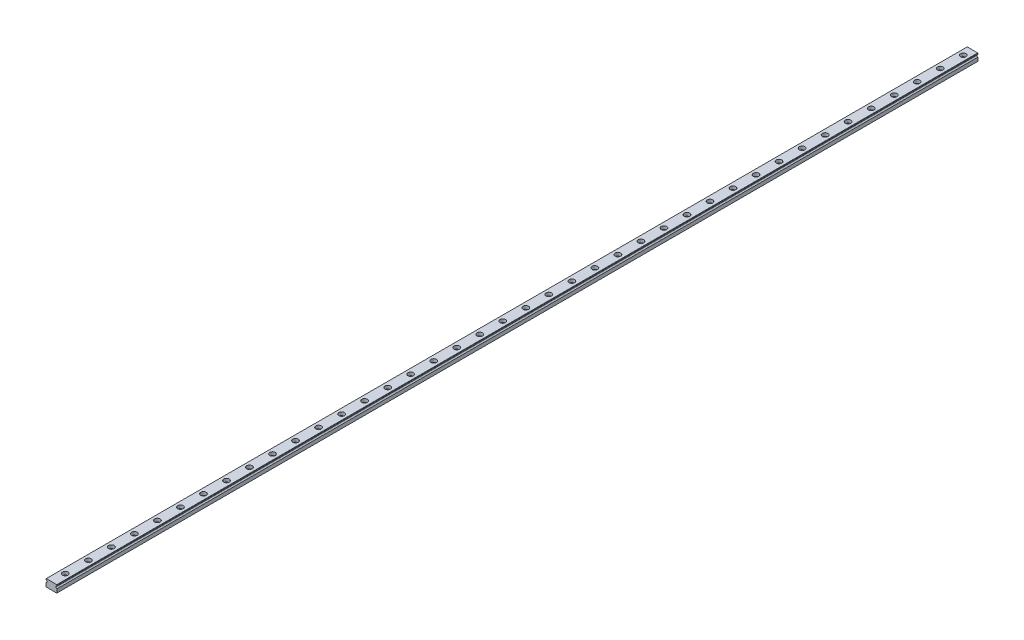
ISO-10303-21;
HEADER;
FILE_DESCRIPTION(('STEP AP214'),'2;1');
FILE_NAME('part.step','',(''),(''),'','','');
FILE_SCHEMA(('AUTOMOTIVE_DESIGN { 1 0 10303 214 1 1 1 1 }'));
ENDSEC;
DATA;
#1=APPLICATION_CONTEXT('core data for automotive mechanical design processes');
#2=APPLICATION_PROTOCOL_DEFINITION('international standard','automotive_design',2000,#1);
#3=PRODUCT_CONTEXT('',#1,'mechanical');
#4=PRODUCT('Part','Part','',(#3));
#5=PRODUCT_RELATED_PRODUCT_CATEGORY('part','',(#4));
#6=PRODUCT_DEFINITION_FORMATION('','',#4);
#7=PRODUCT_DEFINITION_CONTEXT('part definition',#1,'design');
#8=PRODUCT_DEFINITION('design','',#6,#7);
#9=PRODUCT_DEFINITION_SHAPE('','',#8);
#10=(LENGTH_UNIT() NAMED_UNIT(*) SI_UNIT(.MILLI.,.METRE.));
#11=(NAMED_UNIT(*) PLANE_ANGLE_UNIT() SI_UNIT($,.RADIAN.));
#12=(NAMED_UNIT(*) SI_UNIT($,.STERADIAN.) SOLID_ANGLE_UNIT());
#13=UNCERTAINTY_MEASURE_WITH_UNIT(LENGTH_MEASURE(1.E-05),#10,'distance_accuracy_value','');
#14=(GEOMETRIC_REPRESENTATION_CONTEXT(3) GLOBAL_UNCERTAINTY_ASSIGNED_CONTEXT((#13)) GLOBAL_UNIT_ASSIGNED_CONTEXT((#10,
#11,#12)) REPRESENTATION_CONTEXT('',''));
#15=CARTESIAN_POINT('',(0.,0.,0.));
#16=DIRECTION('',(0.,0.,1.));
#17=DIRECTION('',(1.,0.,0.));
#18=AXIS2_PLACEMENT_3D('',#15,#16,#17);
#19=CARTESIAN_POINT('',(6.26061607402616,4.46718006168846,1000.));
#20=DIRECTION('',(0.,-1.,0.));
#21=DIRECTION('',(0.,0.,-1.));
#22=AXIS2_PLACEMENT_3D('',#19,#20,#21);
#23=PLANE('',#22);
#24=CARTESIAN_POINT('',(0.560616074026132,4.46718006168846,84.9999999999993));
#25=DIRECTION('',(0.,1.,0.));
#26=DIRECTION('',(0.,0.,1.));
#27=AXIS2_PLACEMENT_3D('',#24,#25,#26);
#28=CIRCLE('',#27,3.);
#29=CARTESIAN_POINT('',(0.560616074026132,4.46718006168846,87.9999999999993));
#30=VERTEX_POINT('',#29);
#31=EDGE_CURVE('E1870',#30,#30,#28,.T.);
#32=ORIENTED_EDGE('',*,*,#31,.F.);
#33=EDGE_LOOP('',(#32));
#34=FACE_BOUND('',#33,.T.);
#35=CARTESIAN_POINT('',(0.560616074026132,4.46718006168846,109.999999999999));
#36=DIRECTION('',(0.,1.,0.));
#37=DIRECTION('',(0.,0.,1.));
#38=AXIS2_PLACEMENT_3D('',#35,#36,#37);
#39=CIRCLE('',#38,3.);
#40=CARTESIAN_POINT('',(0.560616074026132,4.46718006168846,112.999999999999));
#41=VERTEX_POINT('',#40);
#42=EDGE_CURVE('E1886',#41,#41,#39,.T.);
#43=ORIENTED_EDGE('',*,*,#42,.F.);
#44=EDGE_LOOP('',(#43));
#45=FACE_BOUND('',#44,.T.);
#46=CARTESIAN_POINT('',(0.560616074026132,4.46718006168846,134.999999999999));
#47=DIRECTION('',(0.,1.,0.));
#48=DIRECTION('',(0.,0.,1.));
#49=AXIS2_PLACEMENT_3D('',#46,#47,#48);
#50=CIRCLE('',#49,3.);
#51=CARTESIAN_POINT('',(0.560616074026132,4.46718006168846,137.999999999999));
#52=VERTEX_POINT('',#51);
#53=EDGE_CURVE('E1902',#52,#52,#50,.T.);
#54=ORIENTED_EDGE('',*,*,#53,.F.);
#55=EDGE_LOOP('',(#54));
#56=FACE_BOUND('',#55,.T.);
#57=CARTESIAN_POINT('',(0.560616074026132,4.46718006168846,159.999999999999));
#58=DIRECTION('',(0.,1.,0.));
#59=DIRECTION('',(0.,0.,1.));
#60=AXIS2_PLACEMENT_3D('',#57,#58,#59);
#61=CIRCLE('',#60,3.);
#62=CARTESIAN_POINT('',(0.560616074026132,4.46718006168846,162.999999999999));
#63=VERTEX_POINT('',#62);
#64=EDGE_CURVE('E1918',#63,#63,#61,.T.);
#65=ORIENTED_EDGE('',*,*,#64,.F.);
#66=EDGE_LOOP('',(#65));
#67=FACE_BOUND('',#66,.T.);
#68=CARTESIAN_POINT('',(0.560616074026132,4.46718006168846,184.999999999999));
#69=DIRECTION('',(0.,1.,0.));
#70=DIRECTION('',(0.,0.,1.));
#71=AXIS2_PLACEMENT_3D('',#68,#69,#70);
#72=CIRCLE('',#71,3.);
#73=CARTESIAN_POINT('',(0.560616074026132,4.46718006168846,187.999999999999));
#74=VERTEX_POINT('',#73);
#75=EDGE_CURVE('E1934',#74,#74,#72,.T.);
#76=ORIENTED_EDGE('',*,*,#75,.F.);
#77=EDGE_LOOP('',(#76));
#78=FACE_BOUND('',#77,.T.);
#79=CARTESIAN_POINT('',(0.560616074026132,4.46718006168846,259.999999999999));
#80=DIRECTION('',(0.,1.,0.));
#81=DIRECTION('',(0.,0.,1.));
#82=AXIS2_PLACEMENT_3D('',#79,#80,#81);
#83=CIRCLE('',#82,3.);
#84=CARTESIAN_POINT('',(0.560616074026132,4.46718006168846,262.999999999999));
#85=VERTEX_POINT('',#84);
#86=EDGE_CURVE('E1982',#85,#85,#83,.T.);
#87=ORIENTED_EDGE('',*,*,#86,.F.);
#88=EDGE_LOOP('',(#87));
#89=FACE_BOUND('',#88,.T.);
#90=CARTESIAN_POINT('',(0.560616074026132,4.46718006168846,359.999999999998));
#91=DIRECTION('',(0.,1.,0.));
#92=DIRECTION('',(0.,0.,1.));
#93=AXIS2_PLACEMENT_3D('',#90,#91,#92);
#94=CIRCLE('',#93,3.);
#95=CARTESIAN_POINT('',(0.560616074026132,4.46718006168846,362.999999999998));
#96=VERTEX_POINT('',#95);
#97=EDGE_CURVE('E2046',#96,#96,#94,.T.);
#98=ORIENTED_EDGE('',*,*,#97,.F.);
#99=EDGE_LOOP('',(#98));
#100=FACE_BOUND('',#99,.T.);
#101=CARTESIAN_POINT('',(0.560616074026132,4.46718006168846,434.999999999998));
#102=DIRECTION('',(0.,1.,0.));
#103=DIRECTION('',(0.,0.,1.));
#104=AXIS2_PLACEMENT_3D('',#101,#102,#103);
#105=CIRCLE('',#104,3.);
#106=CARTESIAN_POINT('',(0.560616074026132,4.46718006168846,437.999999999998));
#107=VERTEX_POINT('',#106);
#108=EDGE_CURVE('E2094',#107,#107,#105,.T.);
#109=ORIENTED_EDGE('',*,*,#108,.F.);
#110=EDGE_LOOP('',(#109));
#111=FACE_BOUND('',#110,.T.);
#112=CARTESIAN_POINT('',(0.560616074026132,4.46718006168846,484.999999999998));
#113=DIRECTION('',(0.,1.,0.));
#114=DIRECTION('',(0.,0.,1.));
#115=AXIS2_PLACEMENT_3D('',#112,#113,#114);
#116=CIRCLE('',#115,3.);
#117=CARTESIAN_POINT('',(0.560616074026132,4.46718006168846,487.999999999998));
#118=VERTEX_POINT('',#117);
#119=EDGE_CURVE('E2126',#118,#118,#116,.T.);
#120=ORIENTED_EDGE('',*,*,#119,.F.);
#121=EDGE_LOOP('',(#120));
#122=FACE_BOUND('',#121,.T.);
#123=CARTESIAN_POINT('',(0.560616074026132,4.46718006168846,509.999999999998));
#124=DIRECTION('',(0.,1.,0.));
#125=DIRECTION('',(0.,0.,1.));
#126=AXIS2_PLACEMENT_3D('',#123,#124,#125);
#127=CIRCLE('',#126,3.);
#128=CARTESIAN_POINT('',(0.560616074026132,4.46718006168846,512.999999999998));
#129=VERTEX_POINT('',#128);
#130=EDGE_CURVE('E2142',#129,#129,#127,.T.);
#131=ORIENTED_EDGE('',*,*,#130,.F.);
#132=EDGE_LOOP('',(#131));
#133=FACE_BOUND('',#132,.T.);
#134=CARTESIAN_POINT('',(0.560616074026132,4.46718006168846,609.999999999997));
#135=DIRECTION('',(0.,1.,0.));
#136=DIRECTION('',(0.,0.,1.));
#137=AXIS2_PLACEMENT_3D('',#134,#135,#136);
#138=CIRCLE('',#137,3.);
#139=CARTESIAN_POINT('',(0.560616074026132,4.46718006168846,612.999999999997));
#140=VERTEX_POINT('',#139);
#141=EDGE_CURVE('E2206',#140,#140,#138,.T.);
#142=ORIENTED_EDGE('',*,*,#141,.F.);
#143=EDGE_LOOP('',(#142));
#144=FACE_BOUND('',#143,.T.);
#145=CARTESIAN_POINT('',(0.560616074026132,4.46718006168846,634.999999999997));
#146=DIRECTION('',(0.,1.,0.));
#147=DIRECTION('',(0.,0.,1.));
#148=AXIS2_PLACEMENT_3D('',#145,#146,#147);
#149=CIRCLE('',#148,3.);
#150=CARTESIAN_POINT('',(0.560616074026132,4.46718006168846,637.999999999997));
#151=VERTEX_POINT('',#150);
#152=EDGE_CURVE('E2222',#151,#151,#149,.T.);
#153=ORIENTED_EDGE('',*,*,#152,.F.);
#154=EDGE_LOOP('',(#153));
#155=FACE_BOUND('',#154,.T.);
#156=CARTESIAN_POINT('',(0.560616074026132,4.46718006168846,659.999999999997));
#157=DIRECTION('',(0.,1.,0.));
#158=DIRECTION('',(0.,0.,1.));
#159=AXIS2_PLACEMENT_3D('',#156,#157,#158);
#160=CIRCLE('',#159,3.);
#161=CARTESIAN_POINT('',(0.560616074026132,4.46718006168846,662.999999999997));
#162=VERTEX_POINT('',#161);
#163=EDGE_CURVE('E2238',#162,#162,#160,.T.);
#164=ORIENTED_EDGE('',*,*,#163,.F.);
#165=EDGE_LOOP('',(#164));
#166=FACE_BOUND('',#165,.T.);
#167=CARTESIAN_POINT('',(0.560616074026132,4.46718006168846,684.999999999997));
#168=DIRECTION('',(0.,1.,0.));
#169=DIRECTION('',(0.,0.,1.));
#170=AXIS2_PLACEMENT_3D('',#167,#168,#169);
#171=CIRCLE('',#170,3.);
#172=CARTESIAN_POINT('',(0.560616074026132,4.46718006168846,687.999999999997));
#173=VERTEX_POINT('',#172);
#174=EDGE_CURVE('E2254',#173,#173,#171,.T.);
#175=ORIENTED_EDGE('',*,*,#174,.F.);
#176=EDGE_LOOP('',(#175));
#177=FACE_BOUND('',#176,.T.);
#178=CARTESIAN_POINT('',(0.560616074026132,4.46718006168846,709.999999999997));
#179=DIRECTION('',(0.,1.,0.));
#180=DIRECTION('',(0.,0.,1.));
#181=AXIS2_PLACEMENT_3D('',#178,#179,#180);
#182=CIRCLE('',#181,3.);
#183=CARTESIAN_POINT('',(0.560616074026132,4.46718006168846,712.999999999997));
#184=VERTEX_POINT('',#183);
#185=EDGE_CURVE('E2270',#184,#184,#182,.T.);
#186=ORIENTED_EDGE('',*,*,#185,.F.);
#187=EDGE_LOOP('',(#186));
#188=FACE_BOUND('',#187,.T.);
#189=CARTESIAN_POINT('',(0.560616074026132,4.46718006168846,734.999999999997));
#190=DIRECTION('',(0.,1.,0.));
#191=DIRECTION('',(0.,0.,1.));
#192=AXIS2_PLACEMENT_3D('',#189,#190,#191);
#193=CIRCLE('',#192,3.);
#194=CARTESIAN_POINT('',(0.560616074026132,4.46718006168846,737.999999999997));
#195=VERTEX_POINT('',#194);
#196=EDGE_CURVE('E2286',#195,#195,#193,.T.);
#197=ORIENTED_EDGE('',*,*,#196,.F.);
#198=EDGE_LOOP('',(#197));
#199=FACE_BOUND('',#198,.T.);
#200=CARTESIAN_POINT('',(0.560616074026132,4.46718006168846,784.999999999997));
#201=DIRECTION('',(0.,1.,0.));
#202=DIRECTION('',(0.,0.,1.));
#203=AXIS2_PLACEMENT_3D('',#200,#201,#202);
#204=CIRCLE('',#203,3.);
#205=CARTESIAN_POINT('',(0.560616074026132,4.46718006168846,787.999999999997));
#206=VERTEX_POINT('',#205);
#207=EDGE_CURVE('E2318',#206,#206,#204,.T.);
#208=ORIENTED_EDGE('',*,*,#207,.F.);
#209=EDGE_LOOP('',(#208));
#210=FACE_BOUND('',#209,.T.);
#211=CARTESIAN_POINT('',(0.560616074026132,4.46718006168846,809.999999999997));
#212=DIRECTION('',(0.,1.,0.));
#213=DIRECTION('',(0.,0.,1.));
#214=AXIS2_PLACEMENT_3D('',#211,#212,#213);
#215=CIRCLE('',#214,3.);
#216=CARTESIAN_POINT('',(0.560616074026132,4.46718006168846,812.999999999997));
#217=VERTEX_POINT('',#216);
#218=EDGE_CURVE('E2334',#217,#217,#215,.T.);
#219=ORIENTED_EDGE('',*,*,#218,.F.);
#220=EDGE_LOOP('',(#219));
#221=FACE_BOUND('',#220,.T.);
#222=CARTESIAN_POINT('',(0.560616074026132,4.46718006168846,834.999999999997));
#223=DIRECTION('',(0.,1.,0.));
#224=DIRECTION('',(0.,0.,1.));
#225=AXIS2_PLACEMENT_3D('',#222,#223,#224);
#226=CIRCLE('',#225,3.);
#227=CARTESIAN_POINT('',(0.560616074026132,4.46718006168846,837.999999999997));
#228=VERTEX_POINT('',#227);
#229=EDGE_CURVE('E2350',#228,#228,#226,.T.);
#230=ORIENTED_EDGE('',*,*,#229,.F.);
#231=EDGE_LOOP('',(#230));
#232=FACE_BOUND('',#231,.T.);
#233=CARTESIAN_POINT('',(0.560616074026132,4.46718006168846,859.999999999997));
#234=DIRECTION('',(0.,1.,0.));
#235=DIRECTION('',(0.,0.,1.));
#236=AXIS2_PLACEMENT_3D('',#233,#234,#235);
#237=CIRCLE('',#236,3.);
#238=CARTESIAN_POINT('',(0.560616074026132,4.46718006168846,862.999999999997));
#239=VERTEX_POINT('',#238);
#240=EDGE_CURVE('E2366',#239,#239,#237,.T.);
#241=ORIENTED_EDGE('',*,*,#240,.F.);
#242=EDGE_LOOP('',(#241));
#243=FACE_BOUND('',#242,.T.);
#244=CARTESIAN_POINT('',(0.560616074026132,4.46718006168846,884.999999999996));
#245=DIRECTION('',(0.,1.,0.));
#246=DIRECTION('',(0.,0.,1.));
#247=AXIS2_PLACEMENT_3D('',#244,#245,#246);
#248=CIRCLE('',#247,3.);
#249=CARTESIAN_POINT('',(0.560616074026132,4.46718006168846,887.999999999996));
#250=VERTEX_POINT('',#249);
#251=EDGE_CURVE('E2382',#250,#250,#248,.T.);
#252=ORIENTED_EDGE('',*,*,#251,.F.);
#253=EDGE_LOOP('',(#252));
#254=FACE_BOUND('',#253,.T.);
#255=CARTESIAN_POINT('',(0.560616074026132,4.46718006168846,909.999999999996));
#256=DIRECTION('',(0.,1.,0.));
#257=DIRECTION('',(0.,0.,1.));
#258=AXIS2_PLACEMENT_3D('',#255,#256,#257);
#259=CIRCLE('',#258,3.);
#260=CARTESIAN_POINT('',(0.560616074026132,4.46718006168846,912.999999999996));
#261=VERTEX_POINT('',#260);
#262=EDGE_CURVE('E2398',#261,#261,#259,.T.);
#263=ORIENTED_EDGE('',*,*,#262,.F.);
#264=EDGE_LOOP('',(#263));
#265=FACE_BOUND('',#264,.T.);
#266=CARTESIAN_POINT('',(0.560616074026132,4.46718006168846,934.999999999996));
#267=DIRECTION('',(0.,1.,0.));
#268=DIRECTION('',(0.,0.,1.));
#269=AXIS2_PLACEMENT_3D('',#266,#267,#268);
#270=CIRCLE('',#269,3.);
#271=CARTESIAN_POINT('',(0.560616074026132,4.46718006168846,937.999999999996));
#272=VERTEX_POINT('',#271);
#273=EDGE_CURVE('E2414',#272,#272,#270,.T.);
#274=ORIENTED_EDGE('',*,*,#273,.F.);
#275=EDGE_LOOP('',(#274));
#276=FACE_BOUND('',#275,.T.);
#277=CARTESIAN_POINT('',(0.560616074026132,4.46718006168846,959.999999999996));
#278=DIRECTION('',(0.,1.,0.));
#279=DIRECTION('',(0.,0.,1.));
#280=AXIS2_PLACEMENT_3D('',#277,#278,#279);
#281=CIRCLE('',#280,3.);
#282=CARTESIAN_POINT('',(0.560616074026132,4.46718006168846,962.999999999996));
#283=VERTEX_POINT('',#282);
#284=EDGE_CURVE('E2430',#283,#283,#281,.T.);
#285=ORIENTED_EDGE('',*,*,#284,.F.);
#286=EDGE_LOOP('',(#285));
#287=FACE_BOUND('',#286,.T.);
#288=CARTESIAN_POINT('',(0.56061607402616,4.46718006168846,984.999999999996));
#289=DIRECTION('',(0.,1.,0.));
#290=DIRECTION('',(0.,0.,1.));
#291=AXIS2_PLACEMENT_3D('',#288,#289,#290);
#292=CIRCLE('',#291,3.);
#293=CARTESIAN_POINT('',(0.56061607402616,4.46718006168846,987.999999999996));
#294=VERTEX_POINT('',#293);
#295=EDGE_CURVE('E2446',#294,#294,#292,.T.);
#296=ORIENTED_EDGE('',*,*,#295,.F.);
#297=EDGE_LOOP('',(#296));
#298=FACE_BOUND('',#297,.T.);
#299=CARTESIAN_POINT('',(0.56061607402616,4.46718006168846,10.));
#300=DIRECTION('',(0.,1.,0.));
#301=DIRECTION('',(0.,0.,1.));
#302=AXIS2_PLACEMENT_3D('',#299,#300,#301);
#303=CIRCLE('',#302,3.);
#304=CARTESIAN_POINT('',(0.56061607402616,4.46718006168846,13.));
#305=VERTEX_POINT('',#304);
#306=EDGE_CURVE('E2462',#305,#305,#303,.T.);
#307=ORIENTED_EDGE('',*,*,#306,.F.);
#308=EDGE_LOOP('',(#307));
#309=FACE_BOUND('',#308,.T.);
#310=DIRECTION('',(-1.,0.,0.));
#311=VECTOR('',#310,1.);
#312=CARTESIAN_POINT('',(6.26061607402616,4.46718006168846,0.));
#313=LINE('',#312,#311);
#314=CARTESIAN_POINT('',(6.26061607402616,4.46718006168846,0.));
#315=VERTEX_POINT('',#314);
#316=CARTESIAN_POINT('',(-5.13938392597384,4.46718006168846,0.));
#317=VERTEX_POINT('',#316);
#318=EDGE_CURVE('E158',#315,#317,#313,.T.);
#319=ORIENTED_EDGE('',*,*,#318,.T.);
#320=DIRECTION('',(0.,0.,-1.));
#321=VECTOR('',#320,1.);
#322=CARTESIAN_POINT('',(-5.13938392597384,4.46718006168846,1000.));
#323=LINE('',#322,#321);
#324=CARTESIAN_POINT('',(-5.13938392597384,4.46718006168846,1000.));
#325=VERTEX_POINT('',#324);
#326=EDGE_CURVE('E155',#325,#317,#323,.T.);
#327=ORIENTED_EDGE('',*,*,#326,.F.);
#328=DIRECTION('',(-1.,0.,0.));
#329=VECTOR('',#328,1.);
#330=CARTESIAN_POINT('',(6.26061607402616,4.46718006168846,1000.));
#331=LINE('',#330,#329);
#332=CARTESIAN_POINT('',(6.26061607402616,4.46718006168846,1000.));
#333=VERTEX_POINT('',#332);
#334=EDGE_CURVE('E143',#333,#325,#331,.T.);
#335=ORIENTED_EDGE('',*,*,#334,.F.);
#336=DIRECTION('',(0.,0.,-1.));
#337=VECTOR('',#336,1.);
#338=CARTESIAN_POINT('',(6.26061607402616,4.46718006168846,1000.));
#339=LINE('',#338,#337);
#340=EDGE_CURVE('E160',#333,#315,#339,.T.);
#341=ORIENTED_EDGE('',*,*,#340,.T.);
#342=EDGE_LOOP('',(#319,#327,#335,#341));
#343=FACE_BOUND('',#342,.T.);
#344=CARTESIAN_POINT('',(0.560616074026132,4.46718006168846,759.999999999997));
#345=DIRECTION('',(0.,1.,0.));
#346=DIRECTION('',(0.,0.,1.));
#347=AXIS2_PLACEMENT_3D('',#344,#345,#346);
#348=CIRCLE('',#347,3.);
#349=CARTESIAN_POINT('',(0.560616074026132,4.46718006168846,762.999999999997));
#350=VERTEX_POINT('',#349);
#351=EDGE_CURVE('E2302',#350,#350,#348,.T.);
#352=ORIENTED_EDGE('',*,*,#351,.F.);
#353=EDGE_LOOP('',(#352));
#354=FACE_BOUND('',#353,.T.);
#355=CARTESIAN_POINT('',(0.560616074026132,4.46718006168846,584.999999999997));
#356=DIRECTION('',(0.,1.,0.));
#357=DIRECTION('',(0.,0.,1.));
#358=AXIS2_PLACEMENT_3D('',#355,#356,#357);
#359=CIRCLE('',#358,3.);
#360=CARTESIAN_POINT('',(0.560616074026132,4.46718006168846,587.999999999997));
#361=VERTEX_POINT('',#360);
#362=EDGE_CURVE('E2190',#361,#361,#359,.T.);
#363=ORIENTED_EDGE('',*,*,#362,.F.);
#364=EDGE_LOOP('',(#363));
#365=FACE_BOUND('',#364,.T.);
#366=CARTESIAN_POINT('',(0.560616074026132,4.46718006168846,559.999999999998));
#367=DIRECTION('',(0.,1.,0.));
#368=DIRECTION('',(0.,0.,1.));
#369=AXIS2_PLACEMENT_3D('',#366,#367,#368);
#370=CIRCLE('',#369,3.);
#371=CARTESIAN_POINT('',(0.560616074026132,4.46718006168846,562.999999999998));
#372=VERTEX_POINT('',#371);
#373=EDGE_CURVE('E2174',#372,#372,#370,.T.);
#374=ORIENTED_EDGE('',*,*,#373,.F.);
#375=EDGE_LOOP('',(#374));
#376=FACE_BOUND('',#375,.T.);
#377=CARTESIAN_POINT('',(0.560616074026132,4.46718006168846,534.999999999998));
#378=DIRECTION('',(0.,1.,0.));
#379=DIRECTION('',(0.,0.,1.));
#380=AXIS2_PLACEMENT_3D('',#377,#378,#379);
#381=CIRCLE('',#380,3.);
#382=CARTESIAN_POINT('',(0.560616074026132,4.46718006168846,537.999999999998));
#383=VERTEX_POINT('',#382);
#384=EDGE_CURVE('E2158',#383,#383,#381,.T.);
#385=ORIENTED_EDGE('',*,*,#384,.F.);
#386=EDGE_LOOP('',(#385));
#387=FACE_BOUND('',#386,.T.);
#388=CARTESIAN_POINT('',(0.560616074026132,4.46718006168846,459.999999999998));
#389=DIRECTION('',(0.,1.,0.));
#390=DIRECTION('',(0.,0.,1.));
#391=AXIS2_PLACEMENT_3D('',#388,#389,#390);
#392=CIRCLE('',#391,3.);
#393=CARTESIAN_POINT('',(0.560616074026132,4.46718006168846,462.999999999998));
#394=VERTEX_POINT('',#393);
#395=EDGE_CURVE('E2110',#394,#394,#392,.T.);
#396=ORIENTED_EDGE('',*,*,#395,.F.);
#397=EDGE_LOOP('',(#396));
#398=FACE_BOUND('',#397,.T.);
#399=CARTESIAN_POINT('',(0.560616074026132,4.46718006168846,409.999999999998));
#400=DIRECTION('',(0.,1.,0.));
#401=DIRECTION('',(0.,0.,1.));
#402=AXIS2_PLACEMENT_3D('',#399,#400,#401);
#403=CIRCLE('',#402,3.);
#404=CARTESIAN_POINT('',(0.560616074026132,4.46718006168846,412.999999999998));
#405=VERTEX_POINT('',#404);
#406=EDGE_CURVE('E2078',#405,#405,#403,.T.);
#407=ORIENTED_EDGE('',*,*,#406,.F.);
#408=EDGE_LOOP('',(#407));
#409=FACE_BOUND('',#408,.T.);
#410=CARTESIAN_POINT('',(0.560616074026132,4.46718006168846,384.999999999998));
#411=DIRECTION('',(0.,1.,0.));
#412=DIRECTION('',(0.,0.,1.));
#413=AXIS2_PLACEMENT_3D('',#410,#411,#412);
#414=CIRCLE('',#413,3.);
#415=CARTESIAN_POINT('',(0.560616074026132,4.46718006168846,387.999999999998));
#416=VERTEX_POINT('',#415);
#417=EDGE_CURVE('E2062',#416,#416,#414,.T.);
#418=ORIENTED_EDGE('',*,*,#417,.F.);
#419=EDGE_LOOP('',(#418));
#420=FACE_BOUND('',#419,.T.);
#421=CARTESIAN_POINT('',(0.560616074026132,4.46718006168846,334.999999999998));
#422=DIRECTION('',(0.,1.,0.));
#423=DIRECTION('',(0.,0.,1.));
#424=AXIS2_PLACEMENT_3D('',#421,#422,#423);
#425=CIRCLE('',#424,3.);
#426=CARTESIAN_POINT('',(0.560616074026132,4.46718006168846,337.999999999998));
#427=VERTEX_POINT('',#426);
#428=EDGE_CURVE('E2030',#427,#427,#425,.T.);
#429=ORIENTED_EDGE('',*,*,#428,.F.);
#430=EDGE_LOOP('',(#429));
#431=FACE_BOUND('',#430,.T.);
#432=CARTESIAN_POINT('',(0.560616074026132,4.46718006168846,309.999999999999));
#433=DIRECTION('',(0.,1.,0.));
#434=DIRECTION('',(0.,0.,1.));
#435=AXIS2_PLACEMENT_3D('',#432,#433,#434);
#436=CIRCLE('',#435,3.);
#437=CARTESIAN_POINT('',(0.560616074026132,4.46718006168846,312.999999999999));
#438=VERTEX_POINT('',#437);
#439=EDGE_CURVE('E2014',#438,#438,#436,.T.);
#440=ORIENTED_EDGE('',*,*,#439,.F.);
#441=EDGE_LOOP('',(#440));
#442=FACE_BOUND('',#441,.T.);
#443=CARTESIAN_POINT('',(0.560616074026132,4.46718006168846,284.999999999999));
#444=DIRECTION('',(0.,1.,0.));
#445=DIRECTION('',(0.,0.,1.));
#446=AXIS2_PLACEMENT_3D('',#443,#444,#445);
#447=CIRCLE('',#446,3.);
#448=CARTESIAN_POINT('',(0.560616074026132,4.46718006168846,287.999999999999));
#449=VERTEX_POINT('',#448);
#450=EDGE_CURVE('E1998',#449,#449,#447,.T.);
#451=ORIENTED_EDGE('',*,*,#450,.F.);
#452=EDGE_LOOP('',(#451));
#453=FACE_BOUND('',#452,.T.);
#454=CARTESIAN_POINT('',(0.560616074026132,4.46718006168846,234.999999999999));
#455=DIRECTION('',(0.,1.,0.));
#456=DIRECTION('',(0.,0.,1.));
#457=AXIS2_PLACEMENT_3D('',#454,#455,#456);
#458=CIRCLE('',#457,3.);
#459=CARTESIAN_POINT('',(0.560616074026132,4.46718006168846,237.999999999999));
#460=VERTEX_POINT('',#459);
#461=EDGE_CURVE('E1966',#460,#460,#458,.T.);
#462=ORIENTED_EDGE('',*,*,#461,.F.);
#463=EDGE_LOOP('',(#462));
#464=FACE_BOUND('',#463,.T.);
#465=CARTESIAN_POINT('',(0.560616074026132,4.46718006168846,209.999999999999));
#466=DIRECTION('',(0.,1.,0.));
#467=DIRECTION('',(0.,0.,1.));
#468=AXIS2_PLACEMENT_3D('',#465,#466,#467);
#469=CIRCLE('',#468,3.);
#470=CARTESIAN_POINT('',(0.560616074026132,4.46718006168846,212.999999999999));
#471=VERTEX_POINT('',#470);
#472=EDGE_CURVE('E1950',#471,#471,#469,.T.);
#473=ORIENTED_EDGE('',*,*,#472,.F.);
#474=EDGE_LOOP('',(#473));
#475=FACE_BOUND('',#474,.T.);
#476=CARTESIAN_POINT('',(0.560616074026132,4.46718006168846,59.9999999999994));
#477=DIRECTION('',(0.,1.,0.));
#478=DIRECTION('',(0.,0.,1.));
#479=AXIS2_PLACEMENT_3D('',#476,#477,#478);
#480=CIRCLE('',#479,3.);
#481=CARTESIAN_POINT('',(0.560616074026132,4.46718006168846,62.9999999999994));
#482=VERTEX_POINT('',#481);
#483=EDGE_CURVE('E1854',#482,#482,#480,.T.);
#484=ORIENTED_EDGE('',*,*,#483,.F.);
#485=EDGE_LOOP('',(#484));
#486=FACE_BOUND('',#485,.T.);
#487=CARTESIAN_POINT('',(0.560616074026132,4.46718006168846,34.9999999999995));
#488=DIRECTION('',(0.,1.,0.));
#489=DIRECTION('',(0.,0.,1.));
#490=AXIS2_PLACEMENT_3D('',#487,#488,#489);
#491=CIRCLE('',#490,3.);
#492=CARTESIAN_POINT('',(0.560616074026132,4.46718006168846,37.9999999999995));
#493=VERTEX_POINT('',#492);
#494=EDGE_CURVE('E1839',#493,#493,#491,.T.);
#495=ORIENTED_EDGE('',*,*,#494,.F.);
#496=EDGE_LOOP('',(#495));
#497=FACE_BOUND('',#496,.T.);
#498=ADVANCED_FACE('F45',(#34,#45,#56,#67,#78,#89,#100,#111,#122,#133,#144,#155,#166,#177,#188,
#199,#210,#221,#232,#243,#254,#265,#276,#287,#298,#309,#343,#354,#365,#376,#387,#398,#409,#420,
#431,#442,#453,#464,#475,#486,#497),#23,.F.);
#499=CARTESIAN_POINT('',(-5.43938392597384,1.96718006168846,1000.));
#500=DIRECTION('',(0.,0.,-1.));
#501=DIRECTION('',(-1.,0.,0.));
#502=AXIS2_PLACEMENT_3D('',#499,#500,#501);
#503=CYLINDRICAL_SURFACE('',#502,1.25);
#504=CARTESIAN_POINT('',(-5.43938392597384,1.96718006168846,0.));
#505=DIRECTION('',(0.,0.,-1.));
#506=DIRECTION('',(1.,0.,0.));
#507=AXIS2_PLACEMENT_3D('',#504,#505,#506);
#508=CIRCLE('',#507,1.25);
#509=CARTESIAN_POINT('',(-5.43938392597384,3.21718006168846,0.));
#510=VERTEX_POINT('',#509);
#511=CARTESIAN_POINT('',(-5.43938392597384,0.717180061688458,0.));
#512=VERTEX_POINT('',#511);
#513=EDGE_CURVE('E171',#510,#512,#508,.T.);
#514=ORIENTED_EDGE('',*,*,#513,.T.);
#515=DIRECTION('',(0.,0.,-1.));
#516=VECTOR('',#515,1.);
#517=CARTESIAN_POINT('',(-5.43938392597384,0.717180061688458,1000.));
#518=LINE('',#517,#516);
#519=CARTESIAN_POINT('',(-5.43938392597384,0.717180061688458,1000.));
#520=VERTEX_POINT('',#519);
#521=EDGE_CURVE('E12',#520,#512,#518,.T.);
#522=ORIENTED_EDGE('',*,*,#521,.F.);
#523=CARTESIAN_POINT('',(-5.43938392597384,1.96718006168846,1000.));
#524=DIRECTION('',(0.,0.,-1.));
#525=DIRECTION('',(1.,0.,0.));
#526=AXIS2_PLACEMENT_3D('',#523,#524,#525);
#527=CIRCLE('',#526,1.25);
#528=CARTESIAN_POINT('',(-5.43938392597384,3.21718006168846,1000.));
#529=VERTEX_POINT('',#528);
#530=EDGE_CURVE('E208',#529,#520,#527,.T.);
#531=ORIENTED_EDGE('',*,*,#530,.F.);
#532=DIRECTION('',(0.,0.,-1.));
#533=VECTOR('',#532,1.);
#534=CARTESIAN_POINT('',(-5.43938392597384,3.21718006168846,1000.));
#535=LINE('',#534,#533);
#536=EDGE_CURVE('E167',#529,#510,#535,.T.);
#537=ORIENTED_EDGE('',*,*,#536,.T.);
#538=EDGE_LOOP('',(#514,#522,#531,#537));
#539=FACE_BOUND('',#538,.T.);
#540=ADVANCED_FACE('F47',(#539),#503,.F.);
#541=CARTESIAN_POINT('',(-5.43938392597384,0.717180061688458,1000.));
#542=DIRECTION('',(1.,0.,0.));
#543=DIRECTION('',(0.,0.,-1.));
#544=AXIS2_PLACEMENT_3D('',#541,#542,#543);
#545=PLANE('',#544);
#546=DIRECTION('',(0.,-1.,0.));
#547=VECTOR('',#546,1.);
#548=CARTESIAN_POINT('',(-5.43938392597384,0.717180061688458,0.));
#549=LINE('',#548,#547);
#550=CARTESIAN_POINT('',(-5.43938392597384,-3.23281993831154,0.));
#551=VERTEX_POINT('',#550);
#552=EDGE_CURVE('E175',#512,#551,#549,.T.);
#553=ORIENTED_EDGE('',*,*,#552,.T.);
#554=DIRECTION('',(0.,0.,-1.));
#555=VECTOR('',#554,1.);
#556=CARTESIAN_POINT('',(-5.43938392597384,-3.23281993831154,1000.));
#557=LINE('',#556,#555);
#558=CARTESIAN_POINT('',(-5.43938392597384,-3.23281993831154,1000.));
#559=VERTEX_POINT('',#558);
#560=EDGE_CURVE('E55',#559,#551,#557,.T.);
#561=ORIENTED_EDGE('',*,*,#560,.F.);
#562=DIRECTION('',(0.,-1.,0.));
#563=VECTOR('',#562,1.);
#564=CARTESIAN_POINT('',(-5.43938392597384,0.717180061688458,1000.));
#565=LINE('',#564,#563);
#566=EDGE_CURVE('E118',#520,#559,#565,.T.);
#567=ORIENTED_EDGE('',*,*,#566,.F.);
#568=ORIENTED_EDGE('',*,*,#521,.T.);
#569=EDGE_LOOP('',(#553,#561,#567,#568));
#570=FACE_BOUND('',#569,.T.);
#571=ADVANCED_FACE('F306',(#570),#545,.F.);
#572=CARTESIAN_POINT('',(-5.43938392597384,-3.23281993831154,1000.));
#573=DIRECTION('',(0.707106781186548,0.707106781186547,0.));
#574=DIRECTION('',(-0.707106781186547,0.707106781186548,0.));
#575=AXIS2_PLACEMENT_3D('',#572,#573,#574);
#576=PLANE('',#575);
#577=DIRECTION('',(0.707106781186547,-0.707106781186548,0.));
#578=VECTOR('',#577,1.);
#579=CARTESIAN_POINT('',(-5.43938392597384,-3.23281993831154,0.));
#580=LINE('',#579,#578);
#581=CARTESIAN_POINT('',(-5.13938392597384,-3.53281993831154,0.));
#582=VERTEX_POINT('',#581);
#583=EDGE_CURVE('E179',#551,#582,#580,.T.);
#584=ORIENTED_EDGE('',*,*,#583,.T.);
#585=DIRECTION('',(0.,0.,-1.));
#586=VECTOR('',#585,1.);
#587=CARTESIAN_POINT('',(-5.13938392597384,-3.53281993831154,1000.));
#588=LINE('',#587,#586);
#589=CARTESIAN_POINT('',(-5.13938392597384,-3.53281993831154,1000.));
#590=VERTEX_POINT('',#589);
#591=EDGE_CURVE('E235',#590,#582,#588,.T.);
#592=ORIENTED_EDGE('',*,*,#591,.F.);
#593=DIRECTION('',(0.707106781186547,-0.707106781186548,0.));
#594=VECTOR('',#593,1.);
#595=CARTESIAN_POINT('',(-5.43938392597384,-3.23281993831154,1000.));
#596=LINE('',#595,#594);
#597=EDGE_CURVE('E245',#559,#590,#596,.T.);
#598=ORIENTED_EDGE('',*,*,#597,.F.);
#599=ORIENTED_EDGE('',*,*,#560,.T.);
#600=EDGE_LOOP('',(#584,#592,#598,#599));
#601=FACE_BOUND('',#600,.T.);
#602=ADVANCED_FACE('F243',(#601),#576,.F.);
#603=CARTESIAN_POINT('',(2.36061607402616,-3.53281993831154,1000.));
#604=DIRECTION('',(0.,1.,0.));
#605=DIRECTION('',(0.,0.,1.));
#606=AXIS2_PLACEMENT_3D('',#603,#604,#605);
#607=PLANE('',#606);
#608=CARTESIAN_POINT('',(0.560616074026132,-3.53281993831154,34.9999999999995));
#609=DIRECTION('',(0.,1.,0.));
#610=DIRECTION('',(0.,0.,1.));
#611=AXIS2_PLACEMENT_3D('',#608,#609,#610);
#612=CIRCLE('',#611,1.75);
#613=CARTESIAN_POINT('',(0.560616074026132,-3.53281993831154,36.7499999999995));
#614=VERTEX_POINT('',#613);
#615=EDGE_CURVE('E1850',#614,#614,#612,.T.);
#616=ORIENTED_EDGE('',*,*,#615,.T.);
#617=EDGE_LOOP('',(#616));
#618=FACE_BOUND('',#617,.T.);
#619=CARTESIAN_POINT('',(0.560616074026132,-3.53281993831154,59.9999999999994));
#620=DIRECTION('',(0.,1.,0.));
#621=DIRECTION('',(0.,0.,1.));
#622=AXIS2_PLACEMENT_3D('',#619,#620,#621);
#623=CIRCLE('',#622,1.75);
#624=CARTESIAN_POINT('',(0.560616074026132,-3.53281993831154,61.7499999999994));
#625=VERTEX_POINT('',#624);
#626=EDGE_CURVE('E1866',#625,#625,#623,.T.);
#627=ORIENTED_EDGE('',*,*,#626,.T.);
#628=EDGE_LOOP('',(#627));
#629=FACE_BOUND('',#628,.T.);
#630=CARTESIAN_POINT('',(0.560616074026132,-3.53281993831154,84.9999999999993));
#631=DIRECTION('',(0.,1.,0.));
#632=DIRECTION('',(0.,0.,1.));
#633=AXIS2_PLACEMENT_3D('',#630,#631,#632);
#634=CIRCLE('',#633,1.75);
#635=CARTESIAN_POINT('',(0.560616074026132,-3.53281993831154,86.7499999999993));
#636=VERTEX_POINT('',#635);
#637=EDGE_CURVE('E1882',#636,#636,#634,.T.);
#638=ORIENTED_EDGE('',*,*,#637,.T.);
#639=EDGE_LOOP('',(#638));
#640=FACE_BOUND('',#639,.T.);
#641=CARTESIAN_POINT('',(0.560616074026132,-3.53281993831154,109.999999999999));
#642=DIRECTION('',(0.,1.,0.));
#643=DIRECTION('',(0.,0.,1.));
#644=AXIS2_PLACEMENT_3D('',#641,#642,#643);
#645=CIRCLE('',#644,1.75);
#646=CARTESIAN_POINT('',(0.560616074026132,-3.53281993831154,111.749999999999));
#647=VERTEX_POINT('',#646);
#648=EDGE_CURVE('E1898',#647,#647,#645,.T.);
#649=ORIENTED_EDGE('',*,*,#648,.T.);
#650=EDGE_LOOP('',(#649));
#651=FACE_BOUND('',#650,.T.);
#652=CARTESIAN_POINT('',(0.560616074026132,-3.53281993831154,134.999999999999));
#653=DIRECTION('',(0.,1.,0.));
#654=DIRECTION('',(0.,0.,1.));
#655=AXIS2_PLACEMENT_3D('',#652,#653,#654);
#656=CIRCLE('',#655,1.75);
#657=CARTESIAN_POINT('',(0.560616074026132,-3.53281993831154,136.749999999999));
#658=VERTEX_POINT('',#657);
#659=EDGE_CURVE('E1914',#658,#658,#656,.T.);
#660=ORIENTED_EDGE('',*,*,#659,.T.);
#661=EDGE_LOOP('',(#660));
#662=FACE_BOUND('',#661,.T.);
#663=CARTESIAN_POINT('',(0.560616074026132,-3.53281993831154,159.999999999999));
#664=DIRECTION('',(0.,1.,0.));
#665=DIRECTION('',(0.,0.,1.));
#666=AXIS2_PLACEMENT_3D('',#663,#664,#665);
#667=CIRCLE('',#666,1.75);
#668=CARTESIAN_POINT('',(0.560616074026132,-3.53281993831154,161.749999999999));
#669=VERTEX_POINT('',#668);
#670=EDGE_CURVE('E1930',#669,#669,#667,.T.);
#671=ORIENTED_EDGE('',*,*,#670,.T.);
#672=EDGE_LOOP('',(#671));
#673=FACE_BOUND('',#672,.T.);
#674=CARTESIAN_POINT('',(0.560616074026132,-3.53281993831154,184.999999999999));
#675=DIRECTION('',(0.,1.,0.));
#676=DIRECTION('',(0.,0.,1.));
#677=AXIS2_PLACEMENT_3D('',#674,#675,#676);
#678=CIRCLE('',#677,1.75);
#679=CARTESIAN_POINT('',(0.560616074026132,-3.53281993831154,186.749999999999));
#680=VERTEX_POINT('',#679);
#681=EDGE_CURVE('E1946',#680,#680,#678,.T.);
#682=ORIENTED_EDGE('',*,*,#681,.T.);
#683=EDGE_LOOP('',(#682));
#684=FACE_BOUND('',#683,.T.);
#685=CARTESIAN_POINT('',(0.560616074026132,-3.53281993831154,209.999999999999));
#686=DIRECTION('',(0.,1.,0.));
#687=DIRECTION('',(0.,0.,1.));
#688=AXIS2_PLACEMENT_3D('',#685,#686,#687);
#689=CIRCLE('',#688,1.75);
#690=CARTESIAN_POINT('',(0.560616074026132,-3.53281993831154,211.749999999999));
#691=VERTEX_POINT('',#690);
#692=EDGE_CURVE('E1962',#691,#691,#689,.T.);
#693=ORIENTED_EDGE('',*,*,#692,.T.);
#694=EDGE_LOOP('',(#693));
#695=FACE_BOUND('',#694,.T.);
#696=CARTESIAN_POINT('',(0.560616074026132,-3.53281993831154,234.999999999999));
#697=DIRECTION('',(0.,1.,0.));
#698=DIRECTION('',(0.,0.,1.));
#699=AXIS2_PLACEMENT_3D('',#696,#697,#698);
#700=CIRCLE('',#699,1.75);
#701=CARTESIAN_POINT('',(0.560616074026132,-3.53281993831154,236.749999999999));
#702=VERTEX_POINT('',#701);
#703=EDGE_CURVE('E1978',#702,#702,#700,.T.);
#704=ORIENTED_EDGE('',*,*,#703,.T.);
#705=EDGE_LOOP('',(#704));
#706=FACE_BOUND('',#705,.T.);
#707=CARTESIAN_POINT('',(0.560616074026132,-3.53281993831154,259.999999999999));
#708=DIRECTION('',(0.,1.,0.));
#709=DIRECTION('',(0.,0.,1.));
#710=AXIS2_PLACEMENT_3D('',#707,#708,#709);
#711=CIRCLE('',#710,1.75);
#712=CARTESIAN_POINT('',(0.560616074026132,-3.53281993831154,261.749999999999));
#713=VERTEX_POINT('',#712);
#714=EDGE_CURVE('E1994',#713,#713,#711,.T.);
#715=ORIENTED_EDGE('',*,*,#714,.T.);
#716=EDGE_LOOP('',(#715));
#717=FACE_BOUND('',#716,.T.);
#718=CARTESIAN_POINT('',(0.560616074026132,-3.53281993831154,284.999999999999));
#719=DIRECTION('',(0.,1.,0.));
#720=DIRECTION('',(0.,0.,1.));
#721=AXIS2_PLACEMENT_3D('',#718,#719,#720);
#722=CIRCLE('',#721,1.75);
#723=CARTESIAN_POINT('',(0.560616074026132,-3.53281993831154,286.749999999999));
#724=VERTEX_POINT('',#723);
#725=EDGE_CURVE('E2010',#724,#724,#722,.T.);
#726=ORIENTED_EDGE('',*,*,#725,.T.);
#727=EDGE_LOOP('',(#726));
#728=FACE_BOUND('',#727,.T.);
#729=CARTESIAN_POINT('',(0.560616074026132,-3.53281993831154,309.999999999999));
#730=DIRECTION('',(0.,1.,0.));
#731=DIRECTION('',(0.,0.,1.));
#732=AXIS2_PLACEMENT_3D('',#729,#730,#731);
#733=CIRCLE('',#732,1.75);
#734=CARTESIAN_POINT('',(0.560616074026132,-3.53281993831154,311.749999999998));
#735=VERTEX_POINT('',#734);
#736=EDGE_CURVE('E2026',#735,#735,#733,.T.);
#737=ORIENTED_EDGE('',*,*,#736,.T.);
#738=EDGE_LOOP('',(#737));
#739=FACE_BOUND('',#738,.T.);
#740=CARTESIAN_POINT('',(0.560616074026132,-3.53281993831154,334.999999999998));
#741=DIRECTION('',(0.,1.,0.));
#742=DIRECTION('',(0.,0.,1.));
#743=AXIS2_PLACEMENT_3D('',#740,#741,#742);
#744=CIRCLE('',#743,1.75);
#745=CARTESIAN_POINT('',(0.560616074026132,-3.53281993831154,336.749999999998));
#746=VERTEX_POINT('',#745);
#747=EDGE_CURVE('E2042',#746,#746,#744,.T.);
#748=ORIENTED_EDGE('',*,*,#747,.T.);
#749=EDGE_LOOP('',(#748));
#750=FACE_BOUND('',#749,.T.);
#751=CARTESIAN_POINT('',(0.560616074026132,-3.53281993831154,359.999999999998));
#752=DIRECTION('',(0.,1.,0.));
#753=DIRECTION('',(0.,0.,1.));
#754=AXIS2_PLACEMENT_3D('',#751,#752,#753);
#755=CIRCLE('',#754,1.75);
#756=CARTESIAN_POINT('',(0.560616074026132,-3.53281993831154,361.749999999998));
#757=VERTEX_POINT('',#756);
#758=EDGE_CURVE('E2058',#757,#757,#755,.T.);
#759=ORIENTED_EDGE('',*,*,#758,.T.);
#760=EDGE_LOOP('',(#759));
#761=FACE_BOUND('',#760,.T.);
#762=CARTESIAN_POINT('',(0.560616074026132,-3.53281993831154,384.999999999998));
#763=DIRECTION('',(0.,1.,0.));
#764=DIRECTION('',(0.,0.,1.));
#765=AXIS2_PLACEMENT_3D('',#762,#763,#764);
#766=CIRCLE('',#765,1.75);
#767=CARTESIAN_POINT('',(0.560616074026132,-3.53281993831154,386.749999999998));
#768=VERTEX_POINT('',#767);
#769=EDGE_CURVE('E2074',#768,#768,#766,.T.);
#770=ORIENTED_EDGE('',*,*,#769,.T.);
#771=EDGE_LOOP('',(#770));
#772=FACE_BOUND('',#771,.T.);
#773=CARTESIAN_POINT('',(0.560616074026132,-3.53281993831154,409.999999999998));
#774=DIRECTION('',(0.,1.,0.));
#775=DIRECTION('',(0.,0.,1.));
#776=AXIS2_PLACEMENT_3D('',#773,#774,#775);
#777=CIRCLE('',#776,1.75);
#778=CARTESIAN_POINT('',(0.560616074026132,-3.53281993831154,411.749999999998));
#779=VERTEX_POINT('',#778);
#780=EDGE_CURVE('E2090',#779,#779,#777,.T.);
#781=ORIENTED_EDGE('',*,*,#780,.T.);
#782=EDGE_LOOP('',(#781));
#783=FACE_BOUND('',#782,.T.);
#784=CARTESIAN_POINT('',(0.560616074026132,-3.53281993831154,434.999999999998));
#785=DIRECTION('',(0.,1.,0.));
#786=DIRECTION('',(0.,0.,1.));
#787=AXIS2_PLACEMENT_3D('',#784,#785,#786);
#788=CIRCLE('',#787,1.75);
#789=CARTESIAN_POINT('',(0.560616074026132,-3.53281993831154,436.749999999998));
#790=VERTEX_POINT('',#789);
#791=EDGE_CURVE('E2106',#790,#790,#788,.T.);
#792=ORIENTED_EDGE('',*,*,#791,.T.);
#793=EDGE_LOOP('',(#792));
#794=FACE_BOUND('',#793,.T.);
#795=CARTESIAN_POINT('',(0.560616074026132,-3.53281993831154,459.999999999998));
#796=DIRECTION('',(0.,1.,0.));
#797=DIRECTION('',(0.,0.,1.));
#798=AXIS2_PLACEMENT_3D('',#795,#796,#797);
#799=CIRCLE('',#798,1.75);
#800=CARTESIAN_POINT('',(0.560616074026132,-3.53281993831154,461.749999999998));
#801=VERTEX_POINT('',#800);
#802=EDGE_CURVE('E2122',#801,#801,#799,.T.);
#803=ORIENTED_EDGE('',*,*,#802,.T.);
#804=EDGE_LOOP('',(#803));
#805=FACE_BOUND('',#804,.T.);
#806=CARTESIAN_POINT('',(0.560616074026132,-3.53281993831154,484.999999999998));
#807=DIRECTION('',(0.,1.,0.));
#808=DIRECTION('',(0.,0.,1.));
#809=AXIS2_PLACEMENT_3D('',#806,#807,#808);
#810=CIRCLE('',#809,1.75);
#811=CARTESIAN_POINT('',(0.560616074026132,-3.53281993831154,486.749999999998));
#812=VERTEX_POINT('',#811);
#813=EDGE_CURVE('E2138',#812,#812,#810,.T.);
#814=ORIENTED_EDGE('',*,*,#813,.T.);
#815=EDGE_LOOP('',(#814));
#816=FACE_BOUND('',#815,.T.);
#817=CARTESIAN_POINT('',(0.560616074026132,-3.53281993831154,509.999999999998));
#818=DIRECTION('',(0.,1.,0.));
#819=DIRECTION('',(0.,0.,1.));
#820=AXIS2_PLACEMENT_3D('',#817,#818,#819);
#821=CIRCLE('',#820,1.75);
#822=CARTESIAN_POINT('',(0.560616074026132,-3.53281993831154,511.749999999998));
#823=VERTEX_POINT('',#822);
#824=EDGE_CURVE('E2154',#823,#823,#821,.T.);
#825=ORIENTED_EDGE('',*,*,#824,.T.);
#826=EDGE_LOOP('',(#825));
#827=FACE_BOUND('',#826,.T.);
#828=CARTESIAN_POINT('',(0.560616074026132,-3.53281993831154,534.999999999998));
#829=DIRECTION('',(0.,1.,0.));
#830=DIRECTION('',(0.,0.,1.));
#831=AXIS2_PLACEMENT_3D('',#828,#829,#830);
#832=CIRCLE('',#831,1.75);
#833=CARTESIAN_POINT('',(0.560616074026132,-3.53281993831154,536.749999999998));
#834=VERTEX_POINT('',#833);
#835=EDGE_CURVE('E2170',#834,#834,#832,.T.);
#836=ORIENTED_EDGE('',*,*,#835,.T.);
#837=EDGE_LOOP('',(#836));
#838=FACE_BOUND('',#837,.T.);
#839=CARTESIAN_POINT('',(0.560616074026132,-3.53281993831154,559.999999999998));
#840=DIRECTION('',(0.,1.,0.));
#841=DIRECTION('',(0.,0.,1.));
#842=AXIS2_PLACEMENT_3D('',#839,#840,#841);
#843=CIRCLE('',#842,1.75);
#844=CARTESIAN_POINT('',(0.560616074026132,-3.53281993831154,561.749999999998));
#845=VERTEX_POINT('',#844);
#846=EDGE_CURVE('E2186',#845,#845,#843,.T.);
#847=ORIENTED_EDGE('',*,*,#846,.T.);
#848=EDGE_LOOP('',(#847));
#849=FACE_BOUND('',#848,.T.);
#850=CARTESIAN_POINT('',(0.560616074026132,-3.53281993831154,584.999999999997));
#851=DIRECTION('',(0.,1.,0.));
#852=DIRECTION('',(0.,0.,1.));
#853=AXIS2_PLACEMENT_3D('',#850,#851,#852);
#854=CIRCLE('',#853,1.75);
#855=CARTESIAN_POINT('',(0.560616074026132,-3.53281993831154,586.749999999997));
#856=VERTEX_POINT('',#855);
#857=EDGE_CURVE('E2202',#856,#856,#854,.T.);
#858=ORIENTED_EDGE('',*,*,#857,.T.);
#859=EDGE_LOOP('',(#858));
#860=FACE_BOUND('',#859,.T.);
#861=CARTESIAN_POINT('',(0.560616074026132,-3.53281993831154,609.999999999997));
#862=DIRECTION('',(0.,1.,0.));
#863=DIRECTION('',(0.,0.,1.));
#864=AXIS2_PLACEMENT_3D('',#861,#862,#863);
#865=CIRCLE('',#864,1.75);
#866=CARTESIAN_POINT('',(0.560616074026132,-3.53281993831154,611.749999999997));
#867=VERTEX_POINT('',#866);
#868=EDGE_CURVE('E2218',#867,#867,#865,.T.);
#869=ORIENTED_EDGE('',*,*,#868,.T.);
#870=EDGE_LOOP('',(#869));
#871=FACE_BOUND('',#870,.T.);
#872=CARTESIAN_POINT('',(0.560616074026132,-3.53281993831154,634.999999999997));
#873=DIRECTION('',(0.,1.,0.));
#874=DIRECTION('',(0.,0.,1.));
#875=AXIS2_PLACEMENT_3D('',#872,#873,#874);
#876=CIRCLE('',#875,1.75);
#877=CARTESIAN_POINT('',(0.560616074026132,-3.53281993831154,636.749999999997));
#878=VERTEX_POINT('',#877);
#879=EDGE_CURVE('E2234',#878,#878,#876,.T.);
#880=ORIENTED_EDGE('',*,*,#879,.T.);
#881=EDGE_LOOP('',(#880));
#882=FACE_BOUND('',#881,.T.);
#883=CARTESIAN_POINT('',(0.560616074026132,-3.53281993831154,659.999999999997));
#884=DIRECTION('',(0.,1.,0.));
#885=DIRECTION('',(0.,0.,1.));
#886=AXIS2_PLACEMENT_3D('',#883,#884,#885);
#887=CIRCLE('',#886,1.75);
#888=CARTESIAN_POINT('',(0.560616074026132,-3.53281993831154,661.749999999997));
#889=VERTEX_POINT('',#888);
#890=EDGE_CURVE('E2250',#889,#889,#887,.T.);
#891=ORIENTED_EDGE('',*,*,#890,.T.);
#892=EDGE_LOOP('',(#891));
#893=FACE_BOUND('',#892,.T.);
#894=CARTESIAN_POINT('',(0.560616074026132,-3.53281993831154,684.999999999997));
#895=DIRECTION('',(0.,1.,0.));
#896=DIRECTION('',(0.,0.,1.));
#897=AXIS2_PLACEMENT_3D('',#894,#895,#896);
#898=CIRCLE('',#897,1.75);
#899=CARTESIAN_POINT('',(0.560616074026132,-3.53281993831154,686.749999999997));
#900=VERTEX_POINT('',#899);
#901=EDGE_CURVE('E2266',#900,#900,#898,.T.);
#902=ORIENTED_EDGE('',*,*,#901,.T.);
#903=EDGE_LOOP('',(#902));
#904=FACE_BOUND('',#903,.T.);
#905=CARTESIAN_POINT('',(0.560616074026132,-3.53281993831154,709.999999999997));
#906=DIRECTION('',(0.,1.,0.));
#907=DIRECTION('',(0.,0.,1.));
#908=AXIS2_PLACEMENT_3D('',#905,#906,#907);
#909=CIRCLE('',#908,1.75);
#910=CARTESIAN_POINT('',(0.560616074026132,-3.53281993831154,711.749999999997));
#911=VERTEX_POINT('',#910);
#912=EDGE_CURVE('E2282',#911,#911,#909,.T.);
#913=ORIENTED_EDGE('',*,*,#912,.T.);
#914=EDGE_LOOP('',(#913));
#915=FACE_BOUND('',#914,.T.);
#916=CARTESIAN_POINT('',(0.560616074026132,-3.53281993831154,734.999999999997));
#917=DIRECTION('',(0.,1.,0.));
#918=DIRECTION('',(0.,0.,1.));
#919=AXIS2_PLACEMENT_3D('',#916,#917,#918);
#920=CIRCLE('',#919,1.75);
#921=CARTESIAN_POINT('',(0.560616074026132,-3.53281993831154,736.749999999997));
#922=VERTEX_POINT('',#921);
#923=EDGE_CURVE('E2298',#922,#922,#920,.T.);
#924=ORIENTED_EDGE('',*,*,#923,.T.);
#925=EDGE_LOOP('',(#924));
#926=FACE_BOUND('',#925,.T.);
#927=CARTESIAN_POINT('',(0.560616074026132,-3.53281993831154,759.999999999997));
#928=DIRECTION('',(0.,1.,0.));
#929=DIRECTION('',(0.,0.,1.));
#930=AXIS2_PLACEMENT_3D('',#927,#928,#929);
#931=CIRCLE('',#930,1.75);
#932=CARTESIAN_POINT('',(0.560616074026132,-3.53281993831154,761.749999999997));
#933=VERTEX_POINT('',#932);
#934=EDGE_CURVE('E2314',#933,#933,#931,.T.);
#935=ORIENTED_EDGE('',*,*,#934,.T.);
#936=EDGE_LOOP('',(#935));
#937=FACE_BOUND('',#936,.T.);
#938=CARTESIAN_POINT('',(0.560616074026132,-3.53281993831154,784.999999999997));
#939=DIRECTION('',(0.,1.,0.));
#940=DIRECTION('',(0.,0.,1.));
#941=AXIS2_PLACEMENT_3D('',#938,#939,#940);
#942=CIRCLE('',#941,1.75);
#943=CARTESIAN_POINT('',(0.560616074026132,-3.53281993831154,786.749999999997));
#944=VERTEX_POINT('',#943);
#945=EDGE_CURVE('E2330',#944,#944,#942,.T.);
#946=ORIENTED_EDGE('',*,*,#945,.T.);
#947=EDGE_LOOP('',(#946));
#948=FACE_BOUND('',#947,.T.);
#949=CARTESIAN_POINT('',(0.560616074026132,-3.53281993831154,809.999999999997));
#950=DIRECTION('',(0.,1.,0.));
#951=DIRECTION('',(0.,0.,1.));
#952=AXIS2_PLACEMENT_3D('',#949,#950,#951);
#953=CIRCLE('',#952,1.75);
#954=CARTESIAN_POINT('',(0.560616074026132,-3.53281993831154,811.749999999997));
#955=VERTEX_POINT('',#954);
#956=EDGE_CURVE('E2346',#955,#955,#953,.T.);
#957=ORIENTED_EDGE('',*,*,#956,.T.);
#958=EDGE_LOOP('',(#957));
#959=FACE_BOUND('',#958,.T.);
#960=CARTESIAN_POINT('',(0.560616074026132,-3.53281993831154,834.999999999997));
#961=DIRECTION('',(0.,1.,0.));
#962=DIRECTION('',(0.,0.,1.));
#963=AXIS2_PLACEMENT_3D('',#960,#961,#962);
#964=CIRCLE('',#963,1.75);
#965=CARTESIAN_POINT('',(0.560616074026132,-3.53281993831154,836.749999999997));
#966=VERTEX_POINT('',#965);
#967=EDGE_CURVE('E2362',#966,#966,#964,.T.);
#968=ORIENTED_EDGE('',*,*,#967,.T.);
#969=EDGE_LOOP('',(#968));
#970=FACE_BOUND('',#969,.T.);
#971=CARTESIAN_POINT('',(0.560616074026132,-3.53281993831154,859.999999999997));
#972=DIRECTION('',(0.,1.,0.));
#973=DIRECTION('',(0.,0.,1.));
#974=AXIS2_PLACEMENT_3D('',#971,#972,#973);
#975=CIRCLE('',#974,1.75);
#976=CARTESIAN_POINT('',(0.560616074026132,-3.53281993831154,861.749999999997));
#977=VERTEX_POINT('',#976);
#978=EDGE_CURVE('E2378',#977,#977,#975,.T.);
#979=ORIENTED_EDGE('',*,*,#978,.T.);
#980=EDGE_LOOP('',(#979));
#981=FACE_BOUND('',#980,.T.);
#982=CARTESIAN_POINT('',(0.560616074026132,-3.53281993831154,884.999999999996));
#983=DIRECTION('',(0.,1.,0.));
#984=DIRECTION('',(0.,0.,1.));
#985=AXIS2_PLACEMENT_3D('',#982,#983,#984);
#986=CIRCLE('',#985,1.75);
#987=CARTESIAN_POINT('',(0.560616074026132,-3.53281993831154,886.749999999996));
#988=VERTEX_POINT('',#987);
#989=EDGE_CURVE('E2394',#988,#988,#986,.T.);
#990=ORIENTED_EDGE('',*,*,#989,.T.);
#991=EDGE_LOOP('',(#990));
#992=FACE_BOUND('',#991,.T.);
#993=CARTESIAN_POINT('',(0.560616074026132,-3.53281993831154,909.999999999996));
#994=DIRECTION('',(0.,1.,0.));
#995=DIRECTION('',(0.,0.,1.));
#996=AXIS2_PLACEMENT_3D('',#993,#994,#995);
#997=CIRCLE('',#996,1.75);
#998=CARTESIAN_POINT('',(0.560616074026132,-3.53281993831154,911.749999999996));
#999=VERTEX_POINT('',#998);
#1000=EDGE_CURVE('E2410',#999,#999,#997,.T.);
#1001=ORIENTED_EDGE('',*,*,#1000,.T.);
#1002=EDGE_LOOP('',(#1001));
#1003=FACE_BOUND('',#1002,.T.);
#1004=CARTESIAN_POINT('',(0.560616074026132,-3.53281993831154,934.999999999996));
#1005=DIRECTION('',(0.,1.,0.));
#1006=DIRECTION('',(0.,0.,1.));
#1007=AXIS2_PLACEMENT_3D('',#1004,#1005,#1006);
#1008=CIRCLE('',#1007,1.75);
#1009=CARTESIAN_POINT('',(0.560616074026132,-3.53281993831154,936.749999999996));
#1010=VERTEX_POINT('',#1009);
#1011=EDGE_CURVE('E2426',#1010,#1010,#1008,.T.);
#1012=ORIENTED_EDGE('',*,*,#1011,.T.);
#1013=EDGE_LOOP('',(#1012));
#1014=FACE_BOUND('',#1013,.T.);
#1015=CARTESIAN_POINT('',(0.560616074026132,-3.53281993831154,959.999999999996));
#1016=DIRECTION('',(0.,1.,0.));
#1017=DIRECTION('',(0.,0.,1.));
#1018=AXIS2_PLACEMENT_3D('',#1015,#1016,#1017);
#1019=CIRCLE('',#1018,1.75);
#1020=CARTESIAN_POINT('',(0.560616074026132,-3.53281993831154,961.749999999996));
#1021=VERTEX_POINT('',#1020);
#1022=EDGE_CURVE('E2442',#1021,#1021,#1019,.T.);
#1023=ORIENTED_EDGE('',*,*,#1022,.T.);
#1024=EDGE_LOOP('',(#1023));
#1025=FACE_BOUND('',#1024,.T.);
#1026=CARTESIAN_POINT('',(0.56061607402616,-3.53281993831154,984.999999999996));
#1027=DIRECTION('',(0.,1.,0.));
#1028=DIRECTION('',(0.,0.,1.));
#1029=AXIS2_PLACEMENT_3D('',#1026,#1027,#1028);
#1030=CIRCLE('',#1029,1.75);
#1031=CARTESIAN_POINT('',(0.56061607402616,-3.53281993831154,986.749999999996));
#1032=VERTEX_POINT('',#1031);
#1033=EDGE_CURVE('E2458',#1032,#1032,#1030,.T.);
#1034=ORIENTED_EDGE('',*,*,#1033,.T.);
#1035=EDGE_LOOP('',(#1034));
#1036=FACE_BOUND('',#1035,.T.);
#1037=CARTESIAN_POINT('',(0.56061607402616,-3.53281993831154,10.));
#1038=DIRECTION('',(0.,1.,0.));
#1039=DIRECTION('',(0.,0.,1.));
#1040=AXIS2_PLACEMENT_3D('',#1037,#1038,#1039);
#1041=CIRCLE('',#1040,1.75);
#1042=CARTESIAN_POINT('',(0.56061607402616,-3.53281993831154,11.75));
#1043=VERTEX_POINT('',#1042);
#1044=EDGE_CURVE('E176',#1043,#1043,#1041,.T.);
#1045=ORIENTED_EDGE('',*,*,#1044,.T.);
#1046=EDGE_LOOP('',(#1045));
#1047=FACE_BOUND('',#1046,.T.);
#1048=DIRECTION('',(1.,0.,0.));
#1049=VECTOR('',#1048,1.);
#1050=CARTESIAN_POINT('',(2.36061607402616,-3.53281993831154,0.));
#1051=LINE('',#1050,#1049);
#1052=CARTESIAN_POINT('',(6.26061607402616,-3.53281993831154,0.));
#1053=VERTEX_POINT('',#1052);
#1054=EDGE_CURVE('E183',#582,#1053,#1051,.T.);
#1055=ORIENTED_EDGE('',*,*,#1054,.T.);
#1056=DIRECTION('',(0.,0.,-1.));
#1057=VECTOR('',#1056,1.);
#1058=CARTESIAN_POINT('',(6.26061607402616,-3.53281993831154,1000.));
#1059=LINE('',#1058,#1057);
#1060=CARTESIAN_POINT('',(6.26061607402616,-3.53281993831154,1000.));
#1061=VERTEX_POINT('',#1060);
#1062=EDGE_CURVE('E231',#1061,#1053,#1059,.T.);
#1063=ORIENTED_EDGE('',*,*,#1062,.F.);
#1064=DIRECTION('',(1.,0.,0.));
#1065=VECTOR('',#1064,1.);
#1066=CARTESIAN_POINT('',(-5.13938392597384,-3.53281993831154,1000.));
#1067=LINE('',#1066,#1065);
#1068=EDGE_CURVE('E263',#590,#1061,#1067,.T.);
#1069=ORIENTED_EDGE('',*,*,#1068,.F.);
#1070=ORIENTED_EDGE('',*,*,#591,.T.);
#1071=EDGE_LOOP('',(#1055,#1063,#1069,#1070));
#1072=FACE_BOUND('',#1071,.T.);
#1073=ADVANCED_FACE('F253',(#618,#629,#640,#651,#662,#673,#684,#695,#706,#717,#728,#739,#750,
#761,#772,#783,#794,#805,#816,#827,#838,#849,#860,#871,#882,#893,#904,#915,#926,#937,#948,#959,
#970,#981,#992,#1003,#1014,#1025,#1036,#1047,#1072),#607,.F.);
#1074=CARTESIAN_POINT('',(6.26061607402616,-3.53281993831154,1000.));
#1075=DIRECTION('',(-0.707106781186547,0.707106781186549,0.));
#1076=DIRECTION('',(-0.707106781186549,-0.707106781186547,0.));
#1077=AXIS2_PLACEMENT_3D('',#1074,#1075,#1076);
#1078=PLANE('',#1077);
#1079=DIRECTION('',(0.707106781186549,0.707106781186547,0.));
#1080=VECTOR('',#1079,1.);
#1081=CARTESIAN_POINT('',(6.26061607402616,-3.53281993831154,0.));
#1082=LINE('',#1081,#1080);
#1083=CARTESIAN_POINT('',(6.56061607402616,-3.23281993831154,0.));
#1084=VERTEX_POINT('',#1083);
#1085=EDGE_CURVE('E186',#1053,#1084,#1082,.T.);
#1086=ORIENTED_EDGE('',*,*,#1085,.T.);
#1087=DIRECTION('',(0.,0.,-1.));
#1088=VECTOR('',#1087,1.);
#1089=CARTESIAN_POINT('',(6.56061607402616,-3.23281993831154,1000.));
#1090=LINE('',#1089,#1088);
#1091=CARTESIAN_POINT('',(6.56061607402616,-3.23281993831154,1000.));
#1092=VERTEX_POINT('',#1091);
#1093=EDGE_CURVE('E227',#1092,#1084,#1090,.T.);
#1094=ORIENTED_EDGE('',*,*,#1093,.F.);
#1095=DIRECTION('',(0.707106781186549,0.707106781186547,0.));
#1096=VECTOR('',#1095,1.);
#1097=CARTESIAN_POINT('',(6.26061607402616,-3.53281993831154,1000.));
#1098=LINE('',#1097,#1096);
#1099=EDGE_CURVE('E259',#1061,#1092,#1098,.T.);
#1100=ORIENTED_EDGE('',*,*,#1099,.F.);
#1101=ORIENTED_EDGE('',*,*,#1062,.T.);
#1102=EDGE_LOOP('',(#1086,#1094,#1100,#1101));
#1103=FACE_BOUND('',#1102,.T.);
#1104=ADVANCED_FACE('F257',(#1103),#1078,.F.);
#1105=CARTESIAN_POINT('',(6.56061607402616,-3.23281993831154,1000.));
#1106=DIRECTION('',(-1.,0.,0.));
#1107=DIRECTION('',(0.,0.,1.));
#1108=AXIS2_PLACEMENT_3D('',#1105,#1106,#1107);
#1109=PLANE('',#1108);
#1110=DIRECTION('',(0.,1.,0.));
#1111=VECTOR('',#1110,1.);
#1112=CARTESIAN_POINT('',(6.56061607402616,-3.23281993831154,0.));
#1113=LINE('',#1112,#1111);
#1114=CARTESIAN_POINT('',(6.56061607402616,0.717180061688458,0.));
#1115=VERTEX_POINT('',#1114);
#1116=EDGE_CURVE('E189',#1084,#1115,#1113,.T.);
#1117=ORIENTED_EDGE('',*,*,#1116,.T.);
#1118=DIRECTION('',(0.,0.,-1.));
#1119=VECTOR('',#1118,1.);
#1120=CARTESIAN_POINT('',(6.56061607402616,0.717180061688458,1000.));
#1121=LINE('',#1120,#1119);
#1122=CARTESIAN_POINT('',(6.56061607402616,0.717180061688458,1000.));
#1123=VERTEX_POINT('',#1122);
#1124=EDGE_CURVE('E223',#1123,#1115,#1121,.T.);
#1125=ORIENTED_EDGE('',*,*,#1124,.F.);
#1126=DIRECTION('',(0.,1.,0.));
#1127=VECTOR('',#1126,1.);
#1128=CARTESIAN_POINT('',(6.56061607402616,-3.23281993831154,1000.));
#1129=LINE('',#1128,#1127);
#1130=EDGE_CURVE('E262',#1092,#1123,#1129,.T.);
#1131=ORIENTED_EDGE('',*,*,#1130,.F.);
#1132=ORIENTED_EDGE('',*,*,#1093,.T.);
#1133=EDGE_LOOP('',(#1117,#1125,#1131,#1132));
#1134=FACE_BOUND('',#1133,.T.);
#1135=ADVANCED_FACE('F317',(#1134),#1109,.F.);
#1136=CARTESIAN_POINT('',(6.56061607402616,1.96718006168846,1000.));
#1137=DIRECTION('',(0.,0.,-1.));
#1138=DIRECTION('',(-1.,0.,0.));
#1139=AXIS2_PLACEMENT_3D('',#1136,#1137,#1138);
#1140=CYLINDRICAL_SURFACE('',#1139,1.25);
#1141=CARTESIAN_POINT('',(6.56061607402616,1.96718006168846,0.));
#1142=DIRECTION('',(0.,0.,-1.));
#1143=DIRECTION('',(1.,0.,0.));
#1144=AXIS2_PLACEMENT_3D('',#1141,#1142,#1143);
#1145=CIRCLE('',#1144,1.25);
#1146=CARTESIAN_POINT('',(6.56061607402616,3.21718006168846,0.));
#1147=VERTEX_POINT('',#1146);
#1148=EDGE_CURVE('E193',#1115,#1147,#1145,.T.);
#1149=ORIENTED_EDGE('',*,*,#1148,.T.);
#1150=DIRECTION('',(0.,0.,-1.));
#1151=VECTOR('',#1150,1.);
#1152=CARTESIAN_POINT('',(6.56061607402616,3.21718006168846,1000.));
#1153=LINE('',#1152,#1151);
#1154=CARTESIAN_POINT('',(6.56061607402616,3.21718006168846,1000.));
#1155=VERTEX_POINT('',#1154);
#1156=EDGE_CURVE('E219',#1155,#1147,#1153,.T.);
#1157=ORIENTED_EDGE('',*,*,#1156,.F.);
#1158=CARTESIAN_POINT('',(6.56061607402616,1.96718006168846,1000.));
#1159=DIRECTION('',(0.,0.,-1.));
#1160=DIRECTION('',(1.,0.,0.));
#1161=AXIS2_PLACEMENT_3D('',#1158,#1159,#1160);
#1162=CIRCLE('',#1161,1.25);
#1163=EDGE_CURVE('E267',#1123,#1155,#1162,.T.);
#1164=ORIENTED_EDGE('',*,*,#1163,.F.);
#1165=ORIENTED_EDGE('',*,*,#1124,.T.);
#1166=EDGE_LOOP('',(#1149,#1157,#1164,#1165));
#1167=FACE_BOUND('',#1166,.T.);
#1168=ADVANCED_FACE('F314',(#1167),#1140,.F.);
#1169=CARTESIAN_POINT('',(6.56061607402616,3.21718006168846,1000.));
#1170=DIRECTION('',(-1.,0.,0.));
#1171=DIRECTION('',(0.,0.,1.));
#1172=AXIS2_PLACEMENT_3D('',#1169,#1170,#1171);
#1173=PLANE('',#1172);
#1174=DIRECTION('',(0.,1.,0.));
#1175=VECTOR('',#1174,1.);
#1176=CARTESIAN_POINT('',(6.56061607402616,3.21718006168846,0.));
#1177=LINE('',#1176,#1175);
#1178=CARTESIAN_POINT('',(6.56061607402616,4.16718006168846,0.));
#1179=VERTEX_POINT('',#1178);
#1180=EDGE_CURVE('E196',#1147,#1179,#1177,.T.);
#1181=ORIENTED_EDGE('',*,*,#1180,.T.);
#1182=DIRECTION('',(0.,0.,-1.));
#1183=VECTOR('',#1182,1.);
#1184=CARTESIAN_POINT('',(6.56061607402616,4.16718006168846,1000.));
#1185=LINE('',#1184,#1183);
#1186=CARTESIAN_POINT('',(6.56061607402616,4.16718006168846,1000.));
#1187=VERTEX_POINT('',#1186);
#1188=EDGE_CURVE('E215',#1187,#1179,#1185,.T.);
#1189=ORIENTED_EDGE('',*,*,#1188,.F.);
#1190=DIRECTION('',(0.,1.,0.));
#1191=VECTOR('',#1190,1.);
#1192=CARTESIAN_POINT('',(6.56061607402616,3.21718006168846,1000.));
#1193=LINE('',#1192,#1191);
#1194=EDGE_CURVE('E274',#1155,#1187,#1193,.T.);
#1195=ORIENTED_EDGE('',*,*,#1194,.F.);
#1196=ORIENTED_EDGE('',*,*,#1156,.T.);
#1197=EDGE_LOOP('',(#1181,#1189,#1195,#1196));
#1198=FACE_BOUND('',#1197,.T.);
#1199=ADVANCED_FACE('F282',(#1198),#1173,.F.);
#1200=CARTESIAN_POINT('',(6.56061607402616,4.16718006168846,1000.));
#1201=DIRECTION('',(-0.707106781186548,-0.707106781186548,0.));
#1202=DIRECTION('',(0.707106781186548,-0.707106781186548,0.));
#1203=AXIS2_PLACEMENT_3D('',#1200,#1201,#1202);
#1204=PLANE('',#1203);
#1205=DIRECTION('',(-0.707106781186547,0.707106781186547,0.));
#1206=VECTOR('',#1205,1.);
#1207=CARTESIAN_POINT('',(6.56061607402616,4.16718006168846,0.));
#1208=LINE('',#1207,#1206);
#1209=EDGE_CURVE('E199',#1179,#315,#1208,.T.);
#1210=ORIENTED_EDGE('',*,*,#1209,.T.);
#1211=ORIENTED_EDGE('',*,*,#340,.F.);
#1212=DIRECTION('',(-0.707106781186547,0.707106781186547,0.));
#1213=VECTOR('',#1212,1.);
#1214=CARTESIAN_POINT('',(6.56061607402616,4.16718006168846,1000.));
#1215=LINE('',#1214,#1213);
#1216=EDGE_CURVE('E149',#1187,#333,#1215,.T.);
#1217=ORIENTED_EDGE('',*,*,#1216,.F.);
#1218=ORIENTED_EDGE('',*,*,#1188,.T.);
#1219=EDGE_LOOP('',(#1210,#1211,#1217,#1218));
#1220=FACE_BOUND('',#1219,.T.);
#1221=ADVANCED_FACE('F286',(#1220),#1204,.F.);
#1222=CARTESIAN_POINT('',(-5.13938392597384,4.46718006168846,1000.));
#1223=DIRECTION('',(0.707106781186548,-0.707106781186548,0.));
#1224=DIRECTION('',(0.707106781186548,0.707106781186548,0.));
#1225=AXIS2_PLACEMENT_3D('',#1222,#1223,#1224);
#1226=PLANE('',#1225);
#1227=DIRECTION('',(-0.707106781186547,-0.707106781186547,0.));
#1228=VECTOR('',#1227,1.);
#1229=CARTESIAN_POINT('',(-5.13938392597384,4.46718006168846,0.));
#1230=LINE('',#1229,#1228);
#1231=CARTESIAN_POINT('',(-5.43938392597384,4.16718006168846,0.));
#1232=VERTEX_POINT('',#1231);
#1233=EDGE_CURVE('E104',#317,#1232,#1230,.T.);
#1234=ORIENTED_EDGE('',*,*,#1233,.T.);
#1235=DIRECTION('',(0.,0.,-1.));
#1236=VECTOR('',#1235,1.);
#1237=CARTESIAN_POINT('',(-5.43938392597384,4.16718006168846,1000.));
#1238=LINE('',#1237,#1236);
#1239=CARTESIAN_POINT('',(-5.43938392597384,4.16718006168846,1000.));
#1240=VERTEX_POINT('',#1239);
#1241=EDGE_CURVE('E161',#1240,#1232,#1238,.T.);
#1242=ORIENTED_EDGE('',*,*,#1241,.F.);
#1243=DIRECTION('',(-0.707106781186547,-0.707106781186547,0.));
#1244=VECTOR('',#1243,1.);
#1245=CARTESIAN_POINT('',(-5.13938392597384,4.46718006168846,1000.));
#1246=LINE('',#1245,#1244);
#1247=EDGE_CURVE('E147',#325,#1240,#1246,.T.);
#1248=ORIENTED_EDGE('',*,*,#1247,.F.);
#1249=ORIENTED_EDGE('',*,*,#326,.T.);
#1250=EDGE_LOOP('',(#1234,#1242,#1248,#1249));
#1251=FACE_BOUND('',#1250,.T.);
#1252=ADVANCED_FACE('F163',(#1251),#1226,.F.);
#1253=CARTESIAN_POINT('',(-5.43938392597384,4.16718006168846,1000.));
#1254=DIRECTION('',(1.,0.,0.));
#1255=DIRECTION('',(0.,0.,-1.));
#1256=AXIS2_PLACEMENT_3D('',#1253,#1254,#1255);
#1257=PLANE('',#1256);
#1258=DIRECTION('',(0.,-1.,0.));
#1259=VECTOR('',#1258,1.);
#1260=CARTESIAN_POINT('',(-5.43938392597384,4.16718006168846,0.));
#1261=LINE('',#1260,#1259);
#1262=EDGE_CURVE('E110',#1232,#510,#1261,.T.);
#1263=ORIENTED_EDGE('',*,*,#1262,.T.);
#1264=ORIENTED_EDGE('',*,*,#536,.F.);
#1265=DIRECTION('',(0.,-1.,0.));
#1266=VECTOR('',#1265,1.);
#1267=CARTESIAN_POINT('',(-5.43938392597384,4.16718006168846,1000.));
#1268=LINE('',#1267,#1266);
#1269=EDGE_CURVE('E63',#1240,#529,#1268,.T.);
#1270=ORIENTED_EDGE('',*,*,#1269,.F.);
#1271=ORIENTED_EDGE('',*,*,#1241,.T.);
#1272=EDGE_LOOP('',(#1263,#1264,#1270,#1271));
#1273=FACE_BOUND('',#1272,.T.);
#1274=ADVANCED_FACE('F290',(#1273),#1257,.F.);
#1275=CARTESIAN_POINT('',(-5.43938392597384,1.96718006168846,1000.));
#1276=DIRECTION('',(0.,0.,1.));
#1277=DIRECTION('',(1.,0.,0.));
#1278=AXIS2_PLACEMENT_3D('',#1275,#1276,#1277);
#1279=PLANE('',#1278);
#1280=ORIENTED_EDGE('',*,*,#530,.T.);
#1281=ORIENTED_EDGE('',*,*,#566,.T.);
#1282=ORIENTED_EDGE('',*,*,#597,.T.);
#1283=ORIENTED_EDGE('',*,*,#1068,.T.);
#1284=ORIENTED_EDGE('',*,*,#1099,.T.);
#1285=ORIENTED_EDGE('',*,*,#1130,.T.);
#1286=ORIENTED_EDGE('',*,*,#1163,.T.);
#1287=ORIENTED_EDGE('',*,*,#1194,.T.);
#1288=ORIENTED_EDGE('',*,*,#1216,.T.);
#1289=ORIENTED_EDGE('',*,*,#334,.T.);
#1290=ORIENTED_EDGE('',*,*,#1247,.T.);
#1291=ORIENTED_EDGE('',*,*,#1269,.T.);
#1292=EDGE_LOOP('',(#1280,#1281,#1282,#1283,#1284,#1285,#1286,#1287,#1288,#1289,#1290,#1291));
#1293=FACE_BOUND('',#1292,.T.);
#1294=ADVANCED_FACE('F145',(#1293),#1279,.T.);
#1295=CARTESIAN_POINT('',(-5.43938392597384,1.96718006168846,0.));
#1296=DIRECTION('',(0.,0.,1.));
#1297=DIRECTION('',(1.,0.,0.));
#1298=AXIS2_PLACEMENT_3D('',#1295,#1296,#1297);
#1299=PLANE('',#1298);
#1300=ORIENTED_EDGE('',*,*,#513,.F.);
#1301=ORIENTED_EDGE('',*,*,#1262,.F.);
#1302=ORIENTED_EDGE('',*,*,#1233,.F.);
#1303=ORIENTED_EDGE('',*,*,#318,.F.);
#1304=ORIENTED_EDGE('',*,*,#1209,.F.);
#1305=ORIENTED_EDGE('',*,*,#1180,.F.);
#1306=ORIENTED_EDGE('',*,*,#1148,.F.);
#1307=ORIENTED_EDGE('',*,*,#1116,.F.);
#1308=ORIENTED_EDGE('',*,*,#1085,.F.);
#1309=ORIENTED_EDGE('',*,*,#1054,.F.);
#1310=ORIENTED_EDGE('',*,*,#583,.F.);
#1311=ORIENTED_EDGE('',*,*,#552,.F.);
#1312=EDGE_LOOP('',(#1300,#1301,#1302,#1303,#1304,#1305,#1306,#1307,#1308,#1309,#1310,#1311));
#1313=FACE_BOUND('',#1312,.T.);
#1314=ADVANCED_FACE('F248',(#1313),#1299,.F.);
#1315=CARTESIAN_POINT('',(0.56061607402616,4.46718006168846,10.));
#1316=DIRECTION('',(0.,1.,0.));
#1317=DIRECTION('',(0.,0.,1.));
#1318=AXIS2_PLACEMENT_3D('',#1315,#1316,#1317);
#1319=CYLINDRICAL_SURFACE('',#1318,1.75000000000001);
#1320=ORIENTED_EDGE('',*,*,#1044,.F.);
#1321=EDGE_LOOP('',(#1320));
#1322=FACE_BOUND('',#1321,.T.);
#1323=CARTESIAN_POINT('',(0.56061607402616,0.967180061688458,10.));
#1324=DIRECTION('',(0.,1.,0.));
#1325=DIRECTION('',(0.,0.,1.));
#1326=AXIS2_PLACEMENT_3D('',#1323,#1324,#1325);
#1327=CIRCLE('',#1326,1.75000000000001);
#1328=CARTESIAN_POINT('',(0.56061607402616,0.967180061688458,11.75));
#1329=VERTEX_POINT('',#1328);
#1330=EDGE_CURVE('E2470',#1329,#1329,#1327,.T.);
#1331=ORIENTED_EDGE('',*,*,#1330,.T.);
#1332=EDGE_LOOP('',(#1331));
#1333=FACE_BOUND('',#1332,.T.);
#1334=ADVANCED_FACE('F388',(#1322,#1333),#1319,.F.);
#1335=CARTESIAN_POINT('',(2.31061607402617,0.967180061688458,10.));
#1336=DIRECTION('',(0.,-1.,0.));
#1337=DIRECTION('',(0.,0.,-1.));
#1338=AXIS2_PLACEMENT_3D('',#1335,#1336,#1337);
#1339=PLANE('',#1338);
#1340=ORIENTED_EDGE('',*,*,#1330,.F.);
#1341=EDGE_LOOP('',(#1340));
#1342=FACE_BOUND('',#1341,.T.);
#1343=CARTESIAN_POINT('',(0.56061607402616,0.967180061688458,10.));
#1344=DIRECTION('',(0.,1.,0.));
#1345=DIRECTION('',(0.,0.,1.));
#1346=AXIS2_PLACEMENT_3D('',#1343,#1344,#1345);
#1347=CIRCLE('',#1346,3.);
#1348=CARTESIAN_POINT('',(0.56061607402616,0.967180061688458,13.));
#1349=VERTEX_POINT('',#1348);
#1350=EDGE_CURVE('E2466',#1349,#1349,#1347,.T.);
#1351=ORIENTED_EDGE('',*,*,#1350,.T.);
#1352=EDGE_LOOP('',(#1351));
#1353=FACE_BOUND('',#1352,.T.);
#1354=ADVANCED_FACE('F397',(#1342,#1353),#1339,.F.);
#1355=CARTESIAN_POINT('',(0.56061607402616,4.46718006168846,10.));
#1356=DIRECTION('',(0.,1.,0.));
#1357=DIRECTION('',(0.,0.,1.));
#1358=AXIS2_PLACEMENT_3D('',#1355,#1356,#1357);
#1359=CYLINDRICAL_SURFACE('',#1358,3.);
#1360=ORIENTED_EDGE('',*,*,#1350,.F.);
#1361=EDGE_LOOP('',(#1360));
#1362=FACE_BOUND('',#1361,.T.);
#1363=ORIENTED_EDGE('',*,*,#306,.T.);
#1364=EDGE_LOOP('',(#1363));
#1365=FACE_BOUND('',#1364,.T.);
#1366=ADVANCED_FACE('F408',(#1362,#1365),#1359,.F.);
#1367=CARTESIAN_POINT('',(0.56061607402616,4.46718006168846,984.999999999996));
#1368=DIRECTION('',(0.,1.,0.));
#1369=DIRECTION('',(0.,0.,1.));
#1370=AXIS2_PLACEMENT_3D('',#1367,#1368,#1369);
#1371=CYLINDRICAL_SURFACE('',#1370,1.75000000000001);
#1372=ORIENTED_EDGE('',*,*,#1033,.F.);
#1373=EDGE_LOOP('',(#1372));
#1374=FACE_BOUND('',#1373,.T.);
#1375=CARTESIAN_POINT('',(0.56061607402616,0.967180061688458,984.999999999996));
#1376=DIRECTION('',(0.,1.,0.));
#1377=DIRECTION('',(0.,0.,1.));
#1378=AXIS2_PLACEMENT_3D('',#1375,#1376,#1377);
#1379=CIRCLE('',#1378,1.75000000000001);
#1380=CARTESIAN_POINT('',(0.56061607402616,0.967180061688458,986.749999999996));
#1381=VERTEX_POINT('',#1380);
#1382=EDGE_CURVE('E2454',#1381,#1381,#1379,.T.);
#1383=ORIENTED_EDGE('',*,*,#1382,.T.);
#1384=EDGE_LOOP('',(#1383));
#1385=FACE_BOUND('',#1384,.T.);
#1386=ADVANCED_FACE('F418',(#1374,#1385),#1371,.F.);
#1387=CARTESIAN_POINT('',(2.31061607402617,0.967180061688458,984.999999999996));
#1388=DIRECTION('',(0.,-1.,0.));
#1389=DIRECTION('',(0.,0.,-1.));
#1390=AXIS2_PLACEMENT_3D('',#1387,#1388,#1389);
#1391=PLANE('',#1390);
#1392=ORIENTED_EDGE('',*,*,#1382,.F.);
#1393=EDGE_LOOP('',(#1392));
#1394=FACE_BOUND('',#1393,.T.);
#1395=CARTESIAN_POINT('',(0.56061607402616,0.967180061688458,984.999999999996));
#1396=DIRECTION('',(0.,1.,0.));
#1397=DIRECTION('',(0.,0.,1.));
#1398=AXIS2_PLACEMENT_3D('',#1395,#1396,#1397);
#1399=CIRCLE('',#1398,3.);
#1400=CARTESIAN_POINT('',(0.56061607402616,0.967180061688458,987.999999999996));
#1401=VERTEX_POINT('',#1400);
#1402=EDGE_CURVE('E2450',#1401,#1401,#1399,.T.);
#1403=ORIENTED_EDGE('',*,*,#1402,.T.);
#1404=EDGE_LOOP('',(#1403));
#1405=FACE_BOUND('',#1404,.T.);
#1406=ADVANCED_FACE('F437',(#1394,#1405),#1391,.F.);
#1407=CARTESIAN_POINT('',(0.56061607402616,4.46718006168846,984.999999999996));
#1408=DIRECTION('',(0.,1.,0.));
#1409=DIRECTION('',(0.,0.,1.));
#1410=AXIS2_PLACEMENT_3D('',#1407,#1408,#1409);
#1411=CYLINDRICAL_SURFACE('',#1410,3.);
#1412=ORIENTED_EDGE('',*,*,#1402,.F.);
#1413=EDGE_LOOP('',(#1412));
#1414=FACE_BOUND('',#1413,.T.);
#1415=ORIENTED_EDGE('',*,*,#295,.T.);
#1416=EDGE_LOOP('',(#1415));
#1417=FACE_BOUND('',#1416,.T.);
#1418=ADVANCED_FACE('F448',(#1414,#1417),#1411,.F.);
#1419=CARTESIAN_POINT('',(0.560616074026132,4.46718006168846,959.999999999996));
#1420=DIRECTION('',(0.,1.,0.));
#1421=DIRECTION('',(0.,0.,1.));
#1422=AXIS2_PLACEMENT_3D('',#1419,#1420,#1421);
#1423=CYLINDRICAL_SURFACE('',#1422,1.75000000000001);
#1424=ORIENTED_EDGE('',*,*,#1022,.F.);
#1425=EDGE_LOOP('',(#1424));
#1426=FACE_BOUND('',#1425,.T.);
#1427=CARTESIAN_POINT('',(0.560616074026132,0.967180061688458,959.999999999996));
#1428=DIRECTION('',(0.,1.,0.));
#1429=DIRECTION('',(0.,0.,1.));
#1430=AXIS2_PLACEMENT_3D('',#1427,#1428,#1429);
#1431=CIRCLE('',#1430,1.75000000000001);
#1432=CARTESIAN_POINT('',(0.560616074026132,0.967180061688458,961.749999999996));
#1433=VERTEX_POINT('',#1432);
#1434=EDGE_CURVE('E2438',#1433,#1433,#1431,.T.);
#1435=ORIENTED_EDGE('',*,*,#1434,.T.);
#1436=EDGE_LOOP('',(#1435));
#1437=FACE_BOUND('',#1436,.T.);
#1438=ADVANCED_FACE('F459',(#1426,#1437),#1423,.F.);
#1439=CARTESIAN_POINT('',(2.31061607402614,0.967180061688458,959.999999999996));
#1440=DIRECTION('',(0.,-1.,0.));
#1441=DIRECTION('',(0.,0.,-1.));
#1442=AXIS2_PLACEMENT_3D('',#1439,#1440,#1441);
#1443=PLANE('',#1442);
#1444=ORIENTED_EDGE('',*,*,#1434,.F.);
#1445=EDGE_LOOP('',(#1444));
#1446=FACE_BOUND('',#1445,.T.);
#1447=CARTESIAN_POINT('',(0.560616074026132,0.967180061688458,959.999999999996));
#1448=DIRECTION('',(0.,1.,0.));
#1449=DIRECTION('',(0.,0.,1.));
#1450=AXIS2_PLACEMENT_3D('',#1447,#1448,#1449);
#1451=CIRCLE('',#1450,3.);
#1452=CARTESIAN_POINT('',(0.560616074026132,0.967180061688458,962.999999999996));
#1453=VERTEX_POINT('',#1452);
#1454=EDGE_CURVE('E2434',#1453,#1453,#1451,.T.);
#1455=ORIENTED_EDGE('',*,*,#1454,.T.);
#1456=EDGE_LOOP('',(#1455));
#1457=FACE_BOUND('',#1456,.T.);
#1458=ADVANCED_FACE('F470',(#1446,#1457),#1443,.F.);
#1459=CARTESIAN_POINT('',(0.560616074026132,4.46718006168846,959.999999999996));
#1460=DIRECTION('',(0.,1.,0.));
#1461=DIRECTION('',(0.,0.,1.));
#1462=AXIS2_PLACEMENT_3D('',#1459,#1460,#1461);
#1463=CYLINDRICAL_SURFACE('',#1462,3.);
#1464=ORIENTED_EDGE('',*,*,#1454,.F.);
#1465=EDGE_LOOP('',(#1464));
#1466=FACE_BOUND('',#1465,.T.);
#1467=ORIENTED_EDGE('',*,*,#284,.T.);
#1468=EDGE_LOOP('',(#1467));
#1469=FACE_BOUND('',#1468,.T.);
#1470=ADVANCED_FACE('F481',(#1466,#1469),#1463,.F.);
#1471=CARTESIAN_POINT('',(0.560616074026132,4.46718006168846,934.999999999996));
#1472=DIRECTION('',(0.,1.,0.));
#1473=DIRECTION('',(0.,0.,1.));
#1474=AXIS2_PLACEMENT_3D('',#1471,#1472,#1473);
#1475=CYLINDRICAL_SURFACE('',#1474,1.75000000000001);
#1476=ORIENTED_EDGE('',*,*,#1011,.F.);
#1477=EDGE_LOOP('',(#1476));
#1478=FACE_BOUND('',#1477,.T.);
#1479=CARTESIAN_POINT('',(0.560616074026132,0.967180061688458,934.999999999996));
#1480=DIRECTION('',(0.,1.,0.));
#1481=DIRECTION('',(0.,0.,1.));
#1482=AXIS2_PLACEMENT_3D('',#1479,#1480,#1481);
#1483=CIRCLE('',#1482,1.75000000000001);
#1484=CARTESIAN_POINT('',(0.560616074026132,0.967180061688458,936.749999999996));
#1485=VERTEX_POINT('',#1484);
#1486=EDGE_CURVE('E2422',#1485,#1485,#1483,.T.);
#1487=ORIENTED_EDGE('',*,*,#1486,.T.);
#1488=EDGE_LOOP('',(#1487));
#1489=FACE_BOUND('',#1488,.T.);
#1490=ADVANCED_FACE('F492',(#1478,#1489),#1475,.F.);
#1491=CARTESIAN_POINT('',(2.31061607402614,0.967180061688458,934.999999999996));
#1492=DIRECTION('',(0.,-1.,0.));
#1493=DIRECTION('',(0.,0.,-1.));
#1494=AXIS2_PLACEMENT_3D('',#1491,#1492,#1493);
#1495=PLANE('',#1494);
#1496=ORIENTED_EDGE('',*,*,#1486,.F.);
#1497=EDGE_LOOP('',(#1496));
#1498=FACE_BOUND('',#1497,.T.);
#1499=CARTESIAN_POINT('',(0.560616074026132,0.967180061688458,934.999999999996));
#1500=DIRECTION('',(0.,1.,0.));
#1501=DIRECTION('',(0.,0.,1.));
#1502=AXIS2_PLACEMENT_3D('',#1499,#1500,#1501);
#1503=CIRCLE('',#1502,3.);
#1504=CARTESIAN_POINT('',(0.560616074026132,0.967180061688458,937.999999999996));
#1505=VERTEX_POINT('',#1504);
#1506=EDGE_CURVE('E2418',#1505,#1505,#1503,.T.);
#1507=ORIENTED_EDGE('',*,*,#1506,.T.);
#1508=EDGE_LOOP('',(#1507));
#1509=FACE_BOUND('',#1508,.T.);
#1510=ADVANCED_FACE('F503',(#1498,#1509),#1495,.F.);
#1511=CARTESIAN_POINT('',(0.560616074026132,4.46718006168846,934.999999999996));
#1512=DIRECTION('',(0.,1.,0.));
#1513=DIRECTION('',(0.,0.,1.));
#1514=AXIS2_PLACEMENT_3D('',#1511,#1512,#1513);
#1515=CYLINDRICAL_SURFACE('',#1514,3.);
#1516=ORIENTED_EDGE('',*,*,#1506,.F.);
#1517=EDGE_LOOP('',(#1516));
#1518=FACE_BOUND('',#1517,.T.);
#1519=ORIENTED_EDGE('',*,*,#273,.T.);
#1520=EDGE_LOOP('',(#1519));
#1521=FACE_BOUND('',#1520,.T.);
#1522=ADVANCED_FACE('F514',(#1518,#1521),#1515,.F.);
#1523=CARTESIAN_POINT('',(0.560616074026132,4.46718006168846,909.999999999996));
#1524=DIRECTION('',(0.,1.,0.));
#1525=DIRECTION('',(0.,0.,1.));
#1526=AXIS2_PLACEMENT_3D('',#1523,#1524,#1525);
#1527=CYLINDRICAL_SURFACE('',#1526,1.75000000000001);
#1528=ORIENTED_EDGE('',*,*,#1000,.F.);
#1529=EDGE_LOOP('',(#1528));
#1530=FACE_BOUND('',#1529,.T.);
#1531=CARTESIAN_POINT('',(0.560616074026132,0.967180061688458,909.999999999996));
#1532=DIRECTION('',(0.,1.,0.));
#1533=DIRECTION('',(0.,0.,1.));
#1534=AXIS2_PLACEMENT_3D('',#1531,#1532,#1533);
#1535=CIRCLE('',#1534,1.75000000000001);
#1536=CARTESIAN_POINT('',(0.560616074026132,0.967180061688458,911.749999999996));
#1537=VERTEX_POINT('',#1536);
#1538=EDGE_CURVE('E2406',#1537,#1537,#1535,.T.);
#1539=ORIENTED_EDGE('',*,*,#1538,.T.);
#1540=EDGE_LOOP('',(#1539));
#1541=FACE_BOUND('',#1540,.T.);
#1542=ADVANCED_FACE('F525',(#1530,#1541),#1527,.F.);
#1543=CARTESIAN_POINT('',(2.31061607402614,0.967180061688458,909.999999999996));
#1544=DIRECTION('',(0.,-1.,0.));
#1545=DIRECTION('',(0.,0.,-1.));
#1546=AXIS2_PLACEMENT_3D('',#1543,#1544,#1545);
#1547=PLANE('',#1546);
#1548=ORIENTED_EDGE('',*,*,#1538,.F.);
#1549=EDGE_LOOP('',(#1548));
#1550=FACE_BOUND('',#1549,.T.);
#1551=CARTESIAN_POINT('',(0.560616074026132,0.967180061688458,909.999999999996));
#1552=DIRECTION('',(0.,1.,0.));
#1553=DIRECTION('',(0.,0.,1.));
#1554=AXIS2_PLACEMENT_3D('',#1551,#1552,#1553);
#1555=CIRCLE('',#1554,3.);
#1556=CARTESIAN_POINT('',(0.560616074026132,0.967180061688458,912.999999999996));
#1557=VERTEX_POINT('',#1556);
#1558=EDGE_CURVE('E2402',#1557,#1557,#1555,.T.);
#1559=ORIENTED_EDGE('',*,*,#1558,.T.);
#1560=EDGE_LOOP('',(#1559));
#1561=FACE_BOUND('',#1560,.T.);
#1562=ADVANCED_FACE('F536',(#1550,#1561),#1547,.F.);
#1563=CARTESIAN_POINT('',(0.560616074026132,4.46718006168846,909.999999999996));
#1564=DIRECTION('',(0.,1.,0.));
#1565=DIRECTION('',(0.,0.,1.));
#1566=AXIS2_PLACEMENT_3D('',#1563,#1564,#1565);
#1567=CYLINDRICAL_SURFACE('',#1566,3.);
#1568=ORIENTED_EDGE('',*,*,#1558,.F.);
#1569=EDGE_LOOP('',(#1568));
#1570=FACE_BOUND('',#1569,.T.);
#1571=ORIENTED_EDGE('',*,*,#262,.T.);
#1572=EDGE_LOOP('',(#1571));
#1573=FACE_BOUND('',#1572,.T.);
#1574=ADVANCED_FACE('F547',(#1570,#1573),#1567,.F.);
#1575=CARTESIAN_POINT('',(0.560616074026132,4.46718006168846,884.999999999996));
#1576=DIRECTION('',(0.,1.,0.));
#1577=DIRECTION('',(0.,0.,1.));
#1578=AXIS2_PLACEMENT_3D('',#1575,#1576,#1577);
#1579=CYLINDRICAL_SURFACE('',#1578,1.75000000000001);
#1580=ORIENTED_EDGE('',*,*,#989,.F.);
#1581=EDGE_LOOP('',(#1580));
#1582=FACE_BOUND('',#1581,.T.);
#1583=CARTESIAN_POINT('',(0.560616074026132,0.967180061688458,884.999999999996));
#1584=DIRECTION('',(0.,1.,0.));
#1585=DIRECTION('',(0.,0.,1.));
#1586=AXIS2_PLACEMENT_3D('',#1583,#1584,#1585);
#1587=CIRCLE('',#1586,1.75000000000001);
#1588=CARTESIAN_POINT('',(0.560616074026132,0.967180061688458,886.749999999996));
#1589=VERTEX_POINT('',#1588);
#1590=EDGE_CURVE('E2390',#1589,#1589,#1587,.T.);
#1591=ORIENTED_EDGE('',*,*,#1590,.T.);
#1592=EDGE_LOOP('',(#1591));
#1593=FACE_BOUND('',#1592,.T.);
#1594=ADVANCED_FACE('F558',(#1582,#1593),#1579,.F.);
#1595=CARTESIAN_POINT('',(2.31061607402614,0.967180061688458,884.999999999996));
#1596=DIRECTION('',(0.,-1.,0.));
#1597=DIRECTION('',(0.,0.,-1.));
#1598=AXIS2_PLACEMENT_3D('',#1595,#1596,#1597);
#1599=PLANE('',#1598);
#1600=ORIENTED_EDGE('',*,*,#1590,.F.);
#1601=EDGE_LOOP('',(#1600));
#1602=FACE_BOUND('',#1601,.T.);
#1603=CARTESIAN_POINT('',(0.560616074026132,0.967180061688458,884.999999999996));
#1604=DIRECTION('',(0.,1.,0.));
#1605=DIRECTION('',(0.,0.,1.));
#1606=AXIS2_PLACEMENT_3D('',#1603,#1604,#1605);
#1607=CIRCLE('',#1606,3.);
#1608=CARTESIAN_POINT('',(0.560616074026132,0.967180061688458,887.999999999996));
#1609=VERTEX_POINT('',#1608);
#1610=EDGE_CURVE('E2386',#1609,#1609,#1607,.T.);
#1611=ORIENTED_EDGE('',*,*,#1610,.T.);
#1612=EDGE_LOOP('',(#1611));
#1613=FACE_BOUND('',#1612,.T.);
#1614=ADVANCED_FACE('F569',(#1602,#1613),#1599,.F.);
#1615=CARTESIAN_POINT('',(0.560616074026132,4.46718006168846,884.999999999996));
#1616=DIRECTION('',(0.,1.,0.));
#1617=DIRECTION('',(0.,0.,1.));
#1618=AXIS2_PLACEMENT_3D('',#1615,#1616,#1617);
#1619=CYLINDRICAL_SURFACE('',#1618,3.);
#1620=ORIENTED_EDGE('',*,*,#1610,.F.);
#1621=EDGE_LOOP('',(#1620));
#1622=FACE_BOUND('',#1621,.T.);
#1623=ORIENTED_EDGE('',*,*,#251,.T.);
#1624=EDGE_LOOP('',(#1623));
#1625=FACE_BOUND('',#1624,.T.);
#1626=ADVANCED_FACE('F580',(#1622,#1625),#1619,.F.);
#1627=CARTESIAN_POINT('',(0.560616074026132,4.46718006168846,859.999999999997));
#1628=DIRECTION('',(0.,1.,0.));
#1629=DIRECTION('',(0.,0.,1.));
#1630=AXIS2_PLACEMENT_3D('',#1627,#1628,#1629);
#1631=CYLINDRICAL_SURFACE('',#1630,1.75000000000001);
#1632=ORIENTED_EDGE('',*,*,#978,.F.);
#1633=EDGE_LOOP('',(#1632));
#1634=FACE_BOUND('',#1633,.T.);
#1635=CARTESIAN_POINT('',(0.560616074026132,0.967180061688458,859.999999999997));
#1636=DIRECTION('',(0.,1.,0.));
#1637=DIRECTION('',(0.,0.,1.));
#1638=AXIS2_PLACEMENT_3D('',#1635,#1636,#1637);
#1639=CIRCLE('',#1638,1.75000000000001);
#1640=CARTESIAN_POINT('',(0.560616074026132,0.967180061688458,861.749999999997));
#1641=VERTEX_POINT('',#1640);
#1642=EDGE_CURVE('E2374',#1641,#1641,#1639,.T.);
#1643=ORIENTED_EDGE('',*,*,#1642,.T.);
#1644=EDGE_LOOP('',(#1643));
#1645=FACE_BOUND('',#1644,.T.);
#1646=ADVANCED_FACE('F591',(#1634,#1645),#1631,.F.);
#1647=CARTESIAN_POINT('',(2.31061607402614,0.967180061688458,859.999999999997));
#1648=DIRECTION('',(0.,-1.,0.));
#1649=DIRECTION('',(0.,0.,-1.));
#1650=AXIS2_PLACEMENT_3D('',#1647,#1648,#1649);
#1651=PLANE('',#1650);
#1652=ORIENTED_EDGE('',*,*,#1642,.F.);
#1653=EDGE_LOOP('',(#1652));
#1654=FACE_BOUND('',#1653,.T.);
#1655=CARTESIAN_POINT('',(0.560616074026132,0.967180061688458,859.999999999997));
#1656=DIRECTION('',(0.,1.,0.));
#1657=DIRECTION('',(0.,0.,1.));
#1658=AXIS2_PLACEMENT_3D('',#1655,#1656,#1657);
#1659=CIRCLE('',#1658,3.);
#1660=CARTESIAN_POINT('',(0.560616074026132,0.967180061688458,862.999999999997));
#1661=VERTEX_POINT('',#1660);
#1662=EDGE_CURVE('E2370',#1661,#1661,#1659,.T.);
#1663=ORIENTED_EDGE('',*,*,#1662,.T.);
#1664=EDGE_LOOP('',(#1663));
#1665=FACE_BOUND('',#1664,.T.);
#1666=ADVANCED_FACE('F602',(#1654,#1665),#1651,.F.);
#1667=CARTESIAN_POINT('',(0.560616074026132,4.46718006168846,859.999999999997));
#1668=DIRECTION('',(0.,1.,0.));
#1669=DIRECTION('',(0.,0.,1.));
#1670=AXIS2_PLACEMENT_3D('',#1667,#1668,#1669);
#1671=CYLINDRICAL_SURFACE('',#1670,3.);
#1672=ORIENTED_EDGE('',*,*,#1662,.F.);
#1673=EDGE_LOOP('',(#1672));
#1674=FACE_BOUND('',#1673,.T.);
#1675=ORIENTED_EDGE('',*,*,#240,.T.);
#1676=EDGE_LOOP('',(#1675));
#1677=FACE_BOUND('',#1676,.T.);
#1678=ADVANCED_FACE('F613',(#1674,#1677),#1671,.F.);
#1679=CARTESIAN_POINT('',(0.560616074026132,4.46718006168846,834.999999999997));
#1680=DIRECTION('',(0.,1.,0.));
#1681=DIRECTION('',(0.,0.,1.));
#1682=AXIS2_PLACEMENT_3D('',#1679,#1680,#1681);
#1683=CYLINDRICAL_SURFACE('',#1682,1.75000000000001);
#1684=ORIENTED_EDGE('',*,*,#967,.F.);
#1685=EDGE_LOOP('',(#1684));
#1686=FACE_BOUND('',#1685,.T.);
#1687=CARTESIAN_POINT('',(0.560616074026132,0.967180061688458,834.999999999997));
#1688=DIRECTION('',(0.,1.,0.));
#1689=DIRECTION('',(0.,0.,1.));
#1690=AXIS2_PLACEMENT_3D('',#1687,#1688,#1689);
#1691=CIRCLE('',#1690,1.75000000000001);
#1692=CARTESIAN_POINT('',(0.560616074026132,0.967180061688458,836.749999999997));
#1693=VERTEX_POINT('',#1692);
#1694=EDGE_CURVE('E2358',#1693,#1693,#1691,.T.);
#1695=ORIENTED_EDGE('',*,*,#1694,.T.);
#1696=EDGE_LOOP('',(#1695));
#1697=FACE_BOUND('',#1696,.T.);
#1698=ADVANCED_FACE('F624',(#1686,#1697),#1683,.F.);
#1699=CARTESIAN_POINT('',(2.31061607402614,0.967180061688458,834.999999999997));
#1700=DIRECTION('',(0.,-1.,0.));
#1701=DIRECTION('',(0.,0.,-1.));
#1702=AXIS2_PLACEMENT_3D('',#1699,#1700,#1701);
#1703=PLANE('',#1702);
#1704=ORIENTED_EDGE('',*,*,#1694,.F.);
#1705=EDGE_LOOP('',(#1704));
#1706=FACE_BOUND('',#1705,.T.);
#1707=CARTESIAN_POINT('',(0.560616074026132,0.967180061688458,834.999999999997));
#1708=DIRECTION('',(0.,1.,0.));
#1709=DIRECTION('',(0.,0.,1.));
#1710=AXIS2_PLACEMENT_3D('',#1707,#1708,#1709);
#1711=CIRCLE('',#1710,3.);
#1712=CARTESIAN_POINT('',(0.560616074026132,0.967180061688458,837.999999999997));
#1713=VERTEX_POINT('',#1712);
#1714=EDGE_CURVE('E2354',#1713,#1713,#1711,.T.);
#1715=ORIENTED_EDGE('',*,*,#1714,.T.);
#1716=EDGE_LOOP('',(#1715));
#1717=FACE_BOUND('',#1716,.T.);
#1718=ADVANCED_FACE('F635',(#1706,#1717),#1703,.F.);
#1719=CARTESIAN_POINT('',(0.560616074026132,4.46718006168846,834.999999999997));
#1720=DIRECTION('',(0.,1.,0.));
#1721=DIRECTION('',(0.,0.,1.));
#1722=AXIS2_PLACEMENT_3D('',#1719,#1720,#1721);
#1723=CYLINDRICAL_SURFACE('',#1722,3.);
#1724=ORIENTED_EDGE('',*,*,#1714,.F.);
#1725=EDGE_LOOP('',(#1724));
#1726=FACE_BOUND('',#1725,.T.);
#1727=ORIENTED_EDGE('',*,*,#229,.T.);
#1728=EDGE_LOOP('',(#1727));
#1729=FACE_BOUND('',#1728,.T.);
#1730=ADVANCED_FACE('F646',(#1726,#1729),#1723,.F.);
#1731=CARTESIAN_POINT('',(0.560616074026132,4.46718006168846,809.999999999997));
#1732=DIRECTION('',(0.,1.,0.));
#1733=DIRECTION('',(0.,0.,1.));
#1734=AXIS2_PLACEMENT_3D('',#1731,#1732,#1733);
#1735=CYLINDRICAL_SURFACE('',#1734,1.75000000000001);
#1736=ORIENTED_EDGE('',*,*,#956,.F.);
#1737=EDGE_LOOP('',(#1736));
#1738=FACE_BOUND('',#1737,.T.);
#1739=CARTESIAN_POINT('',(0.560616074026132,0.967180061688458,809.999999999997));
#1740=DIRECTION('',(0.,1.,0.));
#1741=DIRECTION('',(0.,0.,1.));
#1742=AXIS2_PLACEMENT_3D('',#1739,#1740,#1741);
#1743=CIRCLE('',#1742,1.75000000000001);
#1744=CARTESIAN_POINT('',(0.560616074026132,0.967180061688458,811.749999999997));
#1745=VERTEX_POINT('',#1744);
#1746=EDGE_CURVE('E2342',#1745,#1745,#1743,.T.);
#1747=ORIENTED_EDGE('',*,*,#1746,.T.);
#1748=EDGE_LOOP('',(#1747));
#1749=FACE_BOUND('',#1748,.T.);
#1750=ADVANCED_FACE('F657',(#1738,#1749),#1735,.F.);
#1751=CARTESIAN_POINT('',(2.31061607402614,0.967180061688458,809.999999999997));
#1752=DIRECTION('',(0.,-1.,0.));
#1753=DIRECTION('',(0.,0.,-1.));
#1754=AXIS2_PLACEMENT_3D('',#1751,#1752,#1753);
#1755=PLANE('',#1754);
#1756=ORIENTED_EDGE('',*,*,#1746,.F.);
#1757=EDGE_LOOP('',(#1756));
#1758=FACE_BOUND('',#1757,.T.);
#1759=CARTESIAN_POINT('',(0.560616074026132,0.967180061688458,809.999999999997));
#1760=DIRECTION('',(0.,1.,0.));
#1761=DIRECTION('',(0.,0.,1.));
#1762=AXIS2_PLACEMENT_3D('',#1759,#1760,#1761);
#1763=CIRCLE('',#1762,3.);
#1764=CARTESIAN_POINT('',(0.560616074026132,0.967180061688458,812.999999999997));
#1765=VERTEX_POINT('',#1764);
#1766=EDGE_CURVE('E2338',#1765,#1765,#1763,.T.);
#1767=ORIENTED_EDGE('',*,*,#1766,.T.);
#1768=EDGE_LOOP('',(#1767));
#1769=FACE_BOUND('',#1768,.T.);
#1770=ADVANCED_FACE('F668',(#1758,#1769),#1755,.F.);
#1771=CARTESIAN_POINT('',(0.560616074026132,4.46718006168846,809.999999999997));
#1772=DIRECTION('',(0.,1.,0.));
#1773=DIRECTION('',(0.,0.,1.));
#1774=AXIS2_PLACEMENT_3D('',#1771,#1772,#1773);
#1775=CYLINDRICAL_SURFACE('',#1774,3.);
#1776=ORIENTED_EDGE('',*,*,#1766,.F.);
#1777=EDGE_LOOP('',(#1776));
#1778=FACE_BOUND('',#1777,.T.);
#1779=ORIENTED_EDGE('',*,*,#218,.T.);
#1780=EDGE_LOOP('',(#1779));
#1781=FACE_BOUND('',#1780,.T.);
#1782=ADVANCED_FACE('F679',(#1778,#1781),#1775,.F.);
#1783=CARTESIAN_POINT('',(0.560616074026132,4.46718006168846,784.999999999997));
#1784=DIRECTION('',(0.,1.,0.));
#1785=DIRECTION('',(0.,0.,1.));
#1786=AXIS2_PLACEMENT_3D('',#1783,#1784,#1785);
#1787=CYLINDRICAL_SURFACE('',#1786,1.75000000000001);
#1788=ORIENTED_EDGE('',*,*,#945,.F.);
#1789=EDGE_LOOP('',(#1788));
#1790=FACE_BOUND('',#1789,.T.);
#1791=CARTESIAN_POINT('',(0.560616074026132,0.967180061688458,784.999999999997));
#1792=DIRECTION('',(0.,1.,0.));
#1793=DIRECTION('',(0.,0.,1.));
#1794=AXIS2_PLACEMENT_3D('',#1791,#1792,#1793);
#1795=CIRCLE('',#1794,1.75000000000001);
#1796=CARTESIAN_POINT('',(0.560616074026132,0.967180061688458,786.749999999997));
#1797=VERTEX_POINT('',#1796);
#1798=EDGE_CURVE('E2326',#1797,#1797,#1795,.T.);
#1799=ORIENTED_EDGE('',*,*,#1798,.T.);
#1800=EDGE_LOOP('',(#1799));
#1801=FACE_BOUND('',#1800,.T.);
#1802=ADVANCED_FACE('F690',(#1790,#1801),#1787,.F.);
#1803=CARTESIAN_POINT('',(2.31061607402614,0.967180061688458,784.999999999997));
#1804=DIRECTION('',(0.,-1.,0.));
#1805=DIRECTION('',(0.,0.,-1.));
#1806=AXIS2_PLACEMENT_3D('',#1803,#1804,#1805);
#1807=PLANE('',#1806);
#1808=ORIENTED_EDGE('',*,*,#1798,.F.);
#1809=EDGE_LOOP('',(#1808));
#1810=FACE_BOUND('',#1809,.T.);
#1811=CARTESIAN_POINT('',(0.560616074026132,0.967180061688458,784.999999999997));
#1812=DIRECTION('',(0.,1.,0.));
#1813=DIRECTION('',(0.,0.,1.));
#1814=AXIS2_PLACEMENT_3D('',#1811,#1812,#1813);
#1815=CIRCLE('',#1814,3.);
#1816=CARTESIAN_POINT('',(0.560616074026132,0.967180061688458,787.999999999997));
#1817=VERTEX_POINT('',#1816);
#1818=EDGE_CURVE('E2322',#1817,#1817,#1815,.T.);
#1819=ORIENTED_EDGE('',*,*,#1818,.T.);
#1820=EDGE_LOOP('',(#1819));
#1821=FACE_BOUND('',#1820,.T.);
#1822=ADVANCED_FACE('F701',(#1810,#1821),#1807,.F.);
#1823=CARTESIAN_POINT('',(0.560616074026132,4.46718006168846,784.999999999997));
#1824=DIRECTION('',(0.,1.,0.));
#1825=DIRECTION('',(0.,0.,1.));
#1826=AXIS2_PLACEMENT_3D('',#1823,#1824,#1825);
#1827=CYLINDRICAL_SURFACE('',#1826,3.);
#1828=ORIENTED_EDGE('',*,*,#1818,.F.);
#1829=EDGE_LOOP('',(#1828));
#1830=FACE_BOUND('',#1829,.T.);
#1831=ORIENTED_EDGE('',*,*,#207,.T.);
#1832=EDGE_LOOP('',(#1831));
#1833=FACE_BOUND('',#1832,.T.);
#1834=ADVANCED_FACE('F712',(#1830,#1833),#1827,.F.);
#1835=CARTESIAN_POINT('',(0.560616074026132,4.46718006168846,759.999999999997));
#1836=DIRECTION('',(0.,1.,0.));
#1837=DIRECTION('',(0.,0.,1.));
#1838=AXIS2_PLACEMENT_3D('',#1835,#1836,#1837);
#1839=CYLINDRICAL_SURFACE('',#1838,1.75000000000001);
#1840=ORIENTED_EDGE('',*,*,#934,.F.);
#1841=EDGE_LOOP('',(#1840));
#1842=FACE_BOUND('',#1841,.T.);
#1843=CARTESIAN_POINT('',(0.560616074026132,0.967180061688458,759.999999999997));
#1844=DIRECTION('',(0.,1.,0.));
#1845=DIRECTION('',(0.,0.,1.));
#1846=AXIS2_PLACEMENT_3D('',#1843,#1844,#1845);
#1847=CIRCLE('',#1846,1.75000000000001);
#1848=CARTESIAN_POINT('',(0.560616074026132,0.967180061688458,761.749999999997));
#1849=VERTEX_POINT('',#1848);
#1850=EDGE_CURVE('E2310',#1849,#1849,#1847,.T.);
#1851=ORIENTED_EDGE('',*,*,#1850,.T.);
#1852=EDGE_LOOP('',(#1851));
#1853=FACE_BOUND('',#1852,.T.);
#1854=ADVANCED_FACE('F723',(#1842,#1853),#1839,.F.);
#1855=CARTESIAN_POINT('',(2.31061607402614,0.967180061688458,759.999999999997));
#1856=DIRECTION('',(0.,-1.,0.));
#1857=DIRECTION('',(0.,0.,-1.));
#1858=AXIS2_PLACEMENT_3D('',#1855,#1856,#1857);
#1859=PLANE('',#1858);
#1860=ORIENTED_EDGE('',*,*,#1850,.F.);
#1861=EDGE_LOOP('',(#1860));
#1862=FACE_BOUND('',#1861,.T.);
#1863=CARTESIAN_POINT('',(0.560616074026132,0.967180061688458,759.999999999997));
#1864=DIRECTION('',(0.,1.,0.));
#1865=DIRECTION('',(0.,0.,1.));
#1866=AXIS2_PLACEMENT_3D('',#1863,#1864,#1865);
#1867=CIRCLE('',#1866,3.);
#1868=CARTESIAN_POINT('',(0.560616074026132,0.967180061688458,762.999999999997));
#1869=VERTEX_POINT('',#1868);
#1870=EDGE_CURVE('E2306',#1869,#1869,#1867,.T.);
#1871=ORIENTED_EDGE('',*,*,#1870,.T.);
#1872=EDGE_LOOP('',(#1871));
#1873=FACE_BOUND('',#1872,.T.);
#1874=ADVANCED_FACE('F734',(#1862,#1873),#1859,.F.);
#1875=CARTESIAN_POINT('',(0.560616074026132,4.46718006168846,759.999999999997));
#1876=DIRECTION('',(0.,1.,0.));
#1877=DIRECTION('',(0.,0.,1.));
#1878=AXIS2_PLACEMENT_3D('',#1875,#1876,#1877);
#1879=CYLINDRICAL_SURFACE('',#1878,3.);
#1880=ORIENTED_EDGE('',*,*,#1870,.F.);
#1881=EDGE_LOOP('',(#1880));
#1882=FACE_BOUND('',#1881,.T.);
#1883=ORIENTED_EDGE('',*,*,#351,.T.);
#1884=EDGE_LOOP('',(#1883));
#1885=FACE_BOUND('',#1884,.T.);
#1886=ADVANCED_FACE('F745',(#1882,#1885),#1879,.F.);
#1887=CARTESIAN_POINT('',(0.560616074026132,4.46718006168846,734.999999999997));
#1888=DIRECTION('',(0.,1.,0.));
#1889=DIRECTION('',(0.,0.,1.));
#1890=AXIS2_PLACEMENT_3D('',#1887,#1888,#1889);
#1891=CYLINDRICAL_SURFACE('',#1890,1.75000000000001);
#1892=ORIENTED_EDGE('',*,*,#923,.F.);
#1893=EDGE_LOOP('',(#1892));
#1894=FACE_BOUND('',#1893,.T.);
#1895=CARTESIAN_POINT('',(0.560616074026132,0.967180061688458,734.999999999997));
#1896=DIRECTION('',(0.,1.,0.));
#1897=DIRECTION('',(0.,0.,1.));
#1898=AXIS2_PLACEMENT_3D('',#1895,#1896,#1897);
#1899=CIRCLE('',#1898,1.75000000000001);
#1900=CARTESIAN_POINT('',(0.560616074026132,0.967180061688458,736.749999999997));
#1901=VERTEX_POINT('',#1900);
#1902=EDGE_CURVE('E2294',#1901,#1901,#1899,.T.);
#1903=ORIENTED_EDGE('',*,*,#1902,.T.);
#1904=EDGE_LOOP('',(#1903));
#1905=FACE_BOUND('',#1904,.T.);
#1906=ADVANCED_FACE('F756',(#1894,#1905),#1891,.F.);
#1907=CARTESIAN_POINT('',(2.31061607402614,0.967180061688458,734.999999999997));
#1908=DIRECTION('',(0.,-1.,0.));
#1909=DIRECTION('',(0.,0.,-1.));
#1910=AXIS2_PLACEMENT_3D('',#1907,#1908,#1909);
#1911=PLANE('',#1910);
#1912=ORIENTED_EDGE('',*,*,#1902,.F.);
#1913=EDGE_LOOP('',(#1912));
#1914=FACE_BOUND('',#1913,.T.);
#1915=CARTESIAN_POINT('',(0.560616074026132,0.967180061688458,734.999999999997));
#1916=DIRECTION('',(0.,1.,0.));
#1917=DIRECTION('',(0.,0.,1.));
#1918=AXIS2_PLACEMENT_3D('',#1915,#1916,#1917);
#1919=CIRCLE('',#1918,3.);
#1920=CARTESIAN_POINT('',(0.560616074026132,0.967180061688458,737.999999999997));
#1921=VERTEX_POINT('',#1920);
#1922=EDGE_CURVE('E2290',#1921,#1921,#1919,.T.);
#1923=ORIENTED_EDGE('',*,*,#1922,.T.);
#1924=EDGE_LOOP('',(#1923));
#1925=FACE_BOUND('',#1924,.T.);
#1926=ADVANCED_FACE('F767',(#1914,#1925),#1911,.F.);
#1927=CARTESIAN_POINT('',(0.560616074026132,4.46718006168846,734.999999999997));
#1928=DIRECTION('',(0.,1.,0.));
#1929=DIRECTION('',(0.,0.,1.));
#1930=AXIS2_PLACEMENT_3D('',#1927,#1928,#1929);
#1931=CYLINDRICAL_SURFACE('',#1930,3.);
#1932=ORIENTED_EDGE('',*,*,#1922,.F.);
#1933=EDGE_LOOP('',(#1932));
#1934=FACE_BOUND('',#1933,.T.);
#1935=ORIENTED_EDGE('',*,*,#196,.T.);
#1936=EDGE_LOOP('',(#1935));
#1937=FACE_BOUND('',#1936,.T.);
#1938=ADVANCED_FACE('F778',(#1934,#1937),#1931,.F.);
#1939=CARTESIAN_POINT('',(0.560616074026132,4.46718006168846,709.999999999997));
#1940=DIRECTION('',(0.,1.,0.));
#1941=DIRECTION('',(0.,0.,1.));
#1942=AXIS2_PLACEMENT_3D('',#1939,#1940,#1941);
#1943=CYLINDRICAL_SURFACE('',#1942,1.75000000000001);
#1944=ORIENTED_EDGE('',*,*,#912,.F.);
#1945=EDGE_LOOP('',(#1944));
#1946=FACE_BOUND('',#1945,.T.);
#1947=CARTESIAN_POINT('',(0.560616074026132,0.967180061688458,709.999999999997));
#1948=DIRECTION('',(0.,1.,0.));
#1949=DIRECTION('',(0.,0.,1.));
#1950=AXIS2_PLACEMENT_3D('',#1947,#1948,#1949);
#1951=CIRCLE('',#1950,1.75000000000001);
#1952=CARTESIAN_POINT('',(0.560616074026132,0.967180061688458,711.749999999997));
#1953=VERTEX_POINT('',#1952);
#1954=EDGE_CURVE('E2278',#1953,#1953,#1951,.T.);
#1955=ORIENTED_EDGE('',*,*,#1954,.T.);
#1956=EDGE_LOOP('',(#1955));
#1957=FACE_BOUND('',#1956,.T.);
#1958=ADVANCED_FACE('F789',(#1946,#1957),#1943,.F.);
#1959=CARTESIAN_POINT('',(2.31061607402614,0.967180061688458,709.999999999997));
#1960=DIRECTION('',(0.,-1.,0.));
#1961=DIRECTION('',(0.,0.,-1.));
#1962=AXIS2_PLACEMENT_3D('',#1959,#1960,#1961);
#1963=PLANE('',#1962);
#1964=ORIENTED_EDGE('',*,*,#1954,.F.);
#1965=EDGE_LOOP('',(#1964));
#1966=FACE_BOUND('',#1965,.T.);
#1967=CARTESIAN_POINT('',(0.560616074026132,0.967180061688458,709.999999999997));
#1968=DIRECTION('',(0.,1.,0.));
#1969=DIRECTION('',(0.,0.,1.));
#1970=AXIS2_PLACEMENT_3D('',#1967,#1968,#1969);
#1971=CIRCLE('',#1970,3.);
#1972=CARTESIAN_POINT('',(0.560616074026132,0.967180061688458,712.999999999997));
#1973=VERTEX_POINT('',#1972);
#1974=EDGE_CURVE('E2274',#1973,#1973,#1971,.T.);
#1975=ORIENTED_EDGE('',*,*,#1974,.T.);
#1976=EDGE_LOOP('',(#1975));
#1977=FACE_BOUND('',#1976,.T.);
#1978=ADVANCED_FACE('F800',(#1966,#1977),#1963,.F.);
#1979=CARTESIAN_POINT('',(0.560616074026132,4.46718006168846,709.999999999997));
#1980=DIRECTION('',(0.,1.,0.));
#1981=DIRECTION('',(0.,0.,1.));
#1982=AXIS2_PLACEMENT_3D('',#1979,#1980,#1981);
#1983=CYLINDRICAL_SURFACE('',#1982,3.);
#1984=ORIENTED_EDGE('',*,*,#1974,.F.);
#1985=EDGE_LOOP('',(#1984));
#1986=FACE_BOUND('',#1985,.T.);
#1987=ORIENTED_EDGE('',*,*,#185,.T.);
#1988=EDGE_LOOP('',(#1987));
#1989=FACE_BOUND('',#1988,.T.);
#1990=ADVANCED_FACE('F811',(#1986,#1989),#1983,.F.);
#1991=CARTESIAN_POINT('',(0.560616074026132,4.46718006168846,684.999999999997));
#1992=DIRECTION('',(0.,1.,0.));
#1993=DIRECTION('',(0.,0.,1.));
#1994=AXIS2_PLACEMENT_3D('',#1991,#1992,#1993);
#1995=CYLINDRICAL_SURFACE('',#1994,1.75000000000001);
#1996=ORIENTED_EDGE('',*,*,#901,.F.);
#1997=EDGE_LOOP('',(#1996));
#1998=FACE_BOUND('',#1997,.T.);
#1999=CARTESIAN_POINT('',(0.560616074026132,0.967180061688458,684.999999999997));
#2000=DIRECTION('',(0.,1.,0.));
#2001=DIRECTION('',(0.,0.,1.));
#2002=AXIS2_PLACEMENT_3D('',#1999,#2000,#2001);
#2003=CIRCLE('',#2002,1.75000000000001);
#2004=CARTESIAN_POINT('',(0.560616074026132,0.967180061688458,686.749999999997));
#2005=VERTEX_POINT('',#2004);
#2006=EDGE_CURVE('E2262',#2005,#2005,#2003,.T.);
#2007=ORIENTED_EDGE('',*,*,#2006,.T.);
#2008=EDGE_LOOP('',(#2007));
#2009=FACE_BOUND('',#2008,.T.);
#2010=ADVANCED_FACE('F822',(#1998,#2009),#1995,.F.);
#2011=CARTESIAN_POINT('',(2.31061607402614,0.967180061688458,684.999999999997));
#2012=DIRECTION('',(0.,-1.,0.));
#2013=DIRECTION('',(0.,0.,-1.));
#2014=AXIS2_PLACEMENT_3D('',#2011,#2012,#2013);
#2015=PLANE('',#2014);
#2016=ORIENTED_EDGE('',*,*,#2006,.F.);
#2017=EDGE_LOOP('',(#2016));
#2018=FACE_BOUND('',#2017,.T.);
#2019=CARTESIAN_POINT('',(0.560616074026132,0.967180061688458,684.999999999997));
#2020=DIRECTION('',(0.,1.,0.));
#2021=DIRECTION('',(0.,0.,1.));
#2022=AXIS2_PLACEMENT_3D('',#2019,#2020,#2021);
#2023=CIRCLE('',#2022,3.);
#2024=CARTESIAN_POINT('',(0.560616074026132,0.967180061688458,687.999999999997));
#2025=VERTEX_POINT('',#2024);
#2026=EDGE_CURVE('E2258',#2025,#2025,#2023,.T.);
#2027=ORIENTED_EDGE('',*,*,#2026,.T.);
#2028=EDGE_LOOP('',(#2027));
#2029=FACE_BOUND('',#2028,.T.);
#2030=ADVANCED_FACE('F833',(#2018,#2029),#2015,.F.);
#2031=CARTESIAN_POINT('',(0.560616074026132,4.46718006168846,684.999999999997));
#2032=DIRECTION('',(0.,1.,0.));
#2033=DIRECTION('',(0.,0.,1.));
#2034=AXIS2_PLACEMENT_3D('',#2031,#2032,#2033);
#2035=CYLINDRICAL_SURFACE('',#2034,3.);
#2036=ORIENTED_EDGE('',*,*,#2026,.F.);
#2037=EDGE_LOOP('',(#2036));
#2038=FACE_BOUND('',#2037,.T.);
#2039=ORIENTED_EDGE('',*,*,#174,.T.);
#2040=EDGE_LOOP('',(#2039));
#2041=FACE_BOUND('',#2040,.T.);
#2042=ADVANCED_FACE('F844',(#2038,#2041),#2035,.F.);
#2043=CARTESIAN_POINT('',(0.560616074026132,4.46718006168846,659.999999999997));
#2044=DIRECTION('',(0.,1.,0.));
#2045=DIRECTION('',(0.,0.,1.));
#2046=AXIS2_PLACEMENT_3D('',#2043,#2044,#2045);
#2047=CYLINDRICAL_SURFACE('',#2046,1.75000000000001);
#2048=ORIENTED_EDGE('',*,*,#890,.F.);
#2049=EDGE_LOOP('',(#2048));
#2050=FACE_BOUND('',#2049,.T.);
#2051=CARTESIAN_POINT('',(0.560616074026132,0.967180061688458,659.999999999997));
#2052=DIRECTION('',(0.,1.,0.));
#2053=DIRECTION('',(0.,0.,1.));
#2054=AXIS2_PLACEMENT_3D('',#2051,#2052,#2053);
#2055=CIRCLE('',#2054,1.75000000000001);
#2056=CARTESIAN_POINT('',(0.560616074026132,0.967180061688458,661.749999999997));
#2057=VERTEX_POINT('',#2056);
#2058=EDGE_CURVE('E2246',#2057,#2057,#2055,.T.);
#2059=ORIENTED_EDGE('',*,*,#2058,.T.);
#2060=EDGE_LOOP('',(#2059));
#2061=FACE_BOUND('',#2060,.T.);
#2062=ADVANCED_FACE('F855',(#2050,#2061),#2047,.F.);
#2063=CARTESIAN_POINT('',(2.31061607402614,0.967180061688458,659.999999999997));
#2064=DIRECTION('',(0.,-1.,0.));
#2065=DIRECTION('',(0.,0.,-1.));
#2066=AXIS2_PLACEMENT_3D('',#2063,#2064,#2065);
#2067=PLANE('',#2066);
#2068=ORIENTED_EDGE('',*,*,#2058,.F.);
#2069=EDGE_LOOP('',(#2068));
#2070=FACE_BOUND('',#2069,.T.);
#2071=CARTESIAN_POINT('',(0.560616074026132,0.967180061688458,659.999999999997));
#2072=DIRECTION('',(0.,1.,0.));
#2073=DIRECTION('',(0.,0.,1.));
#2074=AXIS2_PLACEMENT_3D('',#2071,#2072,#2073);
#2075=CIRCLE('',#2074,3.);
#2076=CARTESIAN_POINT('',(0.560616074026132,0.967180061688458,662.999999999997));
#2077=VERTEX_POINT('',#2076);
#2078=EDGE_CURVE('E2242',#2077,#2077,#2075,.T.);
#2079=ORIENTED_EDGE('',*,*,#2078,.T.);
#2080=EDGE_LOOP('',(#2079));
#2081=FACE_BOUND('',#2080,.T.);
#2082=ADVANCED_FACE('F866',(#2070,#2081),#2067,.F.);
#2083=CARTESIAN_POINT('',(0.560616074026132,4.46718006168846,659.999999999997));
#2084=DIRECTION('',(0.,1.,0.));
#2085=DIRECTION('',(0.,0.,1.));
#2086=AXIS2_PLACEMENT_3D('',#2083,#2084,#2085);
#2087=CYLINDRICAL_SURFACE('',#2086,3.);
#2088=ORIENTED_EDGE('',*,*,#2078,.F.);
#2089=EDGE_LOOP('',(#2088));
#2090=FACE_BOUND('',#2089,.T.);
#2091=ORIENTED_EDGE('',*,*,#163,.T.);
#2092=EDGE_LOOP('',(#2091));
#2093=FACE_BOUND('',#2092,.T.);
#2094=ADVANCED_FACE('F877',(#2090,#2093),#2087,.F.);
#2095=CARTESIAN_POINT('',(0.560616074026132,4.46718006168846,634.999999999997));
#2096=DIRECTION('',(0.,1.,0.));
#2097=DIRECTION('',(0.,0.,1.));
#2098=AXIS2_PLACEMENT_3D('',#2095,#2096,#2097);
#2099=CYLINDRICAL_SURFACE('',#2098,1.75000000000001);
#2100=ORIENTED_EDGE('',*,*,#879,.F.);
#2101=EDGE_LOOP('',(#2100));
#2102=FACE_BOUND('',#2101,.T.);
#2103=CARTESIAN_POINT('',(0.560616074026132,0.967180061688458,634.999999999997));
#2104=DIRECTION('',(0.,1.,0.));
#2105=DIRECTION('',(0.,0.,1.));
#2106=AXIS2_PLACEMENT_3D('',#2103,#2104,#2105);
#2107=CIRCLE('',#2106,1.75000000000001);
#2108=CARTESIAN_POINT('',(0.560616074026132,0.967180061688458,636.749999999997));
#2109=VERTEX_POINT('',#2108);
#2110=EDGE_CURVE('E2230',#2109,#2109,#2107,.T.);
#2111=ORIENTED_EDGE('',*,*,#2110,.T.);
#2112=EDGE_LOOP('',(#2111));
#2113=FACE_BOUND('',#2112,.T.);
#2114=ADVANCED_FACE('F888',(#2102,#2113),#2099,.F.);
#2115=CARTESIAN_POINT('',(2.31061607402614,0.967180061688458,634.999999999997));
#2116=DIRECTION('',(0.,-1.,0.));
#2117=DIRECTION('',(0.,0.,-1.));
#2118=AXIS2_PLACEMENT_3D('',#2115,#2116,#2117);
#2119=PLANE('',#2118);
#2120=ORIENTED_EDGE('',*,*,#2110,.F.);
#2121=EDGE_LOOP('',(#2120));
#2122=FACE_BOUND('',#2121,.T.);
#2123=CARTESIAN_POINT('',(0.560616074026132,0.967180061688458,634.999999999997));
#2124=DIRECTION('',(0.,1.,0.));
#2125=DIRECTION('',(0.,0.,1.));
#2126=AXIS2_PLACEMENT_3D('',#2123,#2124,#2125);
#2127=CIRCLE('',#2126,3.);
#2128=CARTESIAN_POINT('',(0.560616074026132,0.967180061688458,637.999999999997));
#2129=VERTEX_POINT('',#2128);
#2130=EDGE_CURVE('E2226',#2129,#2129,#2127,.T.);
#2131=ORIENTED_EDGE('',*,*,#2130,.T.);
#2132=EDGE_LOOP('',(#2131));
#2133=FACE_BOUND('',#2132,.T.);
#2134=ADVANCED_FACE('F899',(#2122,#2133),#2119,.F.);
#2135=CARTESIAN_POINT('',(0.560616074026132,4.46718006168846,634.999999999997));
#2136=DIRECTION('',(0.,1.,0.));
#2137=DIRECTION('',(0.,0.,1.));
#2138=AXIS2_PLACEMENT_3D('',#2135,#2136,#2137);
#2139=CYLINDRICAL_SURFACE('',#2138,3.);
#2140=ORIENTED_EDGE('',*,*,#2130,.F.);
#2141=EDGE_LOOP('',(#2140));
#2142=FACE_BOUND('',#2141,.T.);
#2143=ORIENTED_EDGE('',*,*,#152,.T.);
#2144=EDGE_LOOP('',(#2143));
#2145=FACE_BOUND('',#2144,.T.);
#2146=ADVANCED_FACE('F910',(#2142,#2145),#2139,.F.);
#2147=CARTESIAN_POINT('',(0.560616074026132,4.46718006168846,609.999999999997));
#2148=DIRECTION('',(0.,1.,0.));
#2149=DIRECTION('',(0.,0.,1.));
#2150=AXIS2_PLACEMENT_3D('',#2147,#2148,#2149);
#2151=CYLINDRICAL_SURFACE('',#2150,1.75000000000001);
#2152=ORIENTED_EDGE('',*,*,#868,.F.);
#2153=EDGE_LOOP('',(#2152));
#2154=FACE_BOUND('',#2153,.T.);
#2155=CARTESIAN_POINT('',(0.560616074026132,0.967180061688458,609.999999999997));
#2156=DIRECTION('',(0.,1.,0.));
#2157=DIRECTION('',(0.,0.,1.));
#2158=AXIS2_PLACEMENT_3D('',#2155,#2156,#2157);
#2159=CIRCLE('',#2158,1.75000000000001);
#2160=CARTESIAN_POINT('',(0.560616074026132,0.967180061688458,611.749999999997));
#2161=VERTEX_POINT('',#2160);
#2162=EDGE_CURVE('E2214',#2161,#2161,#2159,.T.);
#2163=ORIENTED_EDGE('',*,*,#2162,.T.);
#2164=EDGE_LOOP('',(#2163));
#2165=FACE_BOUND('',#2164,.T.);
#2166=ADVANCED_FACE('F921',(#2154,#2165),#2151,.F.);
#2167=CARTESIAN_POINT('',(2.31061607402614,0.967180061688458,609.999999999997));
#2168=DIRECTION('',(0.,-1.,0.));
#2169=DIRECTION('',(0.,0.,-1.));
#2170=AXIS2_PLACEMENT_3D('',#2167,#2168,#2169);
#2171=PLANE('',#2170);
#2172=ORIENTED_EDGE('',*,*,#2162,.F.);
#2173=EDGE_LOOP('',(#2172));
#2174=FACE_BOUND('',#2173,.T.);
#2175=CARTESIAN_POINT('',(0.560616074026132,0.967180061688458,609.999999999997));
#2176=DIRECTION('',(0.,1.,0.));
#2177=DIRECTION('',(0.,0.,1.));
#2178=AXIS2_PLACEMENT_3D('',#2175,#2176,#2177);
#2179=CIRCLE('',#2178,3.);
#2180=CARTESIAN_POINT('',(0.560616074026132,0.967180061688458,612.999999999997));
#2181=VERTEX_POINT('',#2180);
#2182=EDGE_CURVE('E2210',#2181,#2181,#2179,.T.);
#2183=ORIENTED_EDGE('',*,*,#2182,.T.);
#2184=EDGE_LOOP('',(#2183));
#2185=FACE_BOUND('',#2184,.T.);
#2186=ADVANCED_FACE('F932',(#2174,#2185),#2171,.F.);
#2187=CARTESIAN_POINT('',(0.560616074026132,4.46718006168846,609.999999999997));
#2188=DIRECTION('',(0.,1.,0.));
#2189=DIRECTION('',(0.,0.,1.));
#2190=AXIS2_PLACEMENT_3D('',#2187,#2188,#2189);
#2191=CYLINDRICAL_SURFACE('',#2190,3.);
#2192=ORIENTED_EDGE('',*,*,#2182,.F.);
#2193=EDGE_LOOP('',(#2192));
#2194=FACE_BOUND('',#2193,.T.);
#2195=ORIENTED_EDGE('',*,*,#141,.T.);
#2196=EDGE_LOOP('',(#2195));
#2197=FACE_BOUND('',#2196,.T.);
#2198=ADVANCED_FACE('F943',(#2194,#2197),#2191,.F.);
#2199=CARTESIAN_POINT('',(0.560616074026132,4.46718006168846,584.999999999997));
#2200=DIRECTION('',(0.,1.,0.));
#2201=DIRECTION('',(0.,0.,1.));
#2202=AXIS2_PLACEMENT_3D('',#2199,#2200,#2201);
#2203=CYLINDRICAL_SURFACE('',#2202,1.75000000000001);
#2204=ORIENTED_EDGE('',*,*,#857,.F.);
#2205=EDGE_LOOP('',(#2204));
#2206=FACE_BOUND('',#2205,.T.);
#2207=CARTESIAN_POINT('',(0.560616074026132,0.967180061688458,584.999999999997));
#2208=DIRECTION('',(0.,1.,0.));
#2209=DIRECTION('',(0.,0.,1.));
#2210=AXIS2_PLACEMENT_3D('',#2207,#2208,#2209);
#2211=CIRCLE('',#2210,1.75000000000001);
#2212=CARTESIAN_POINT('',(0.560616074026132,0.967180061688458,586.749999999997));
#2213=VERTEX_POINT('',#2212);
#2214=EDGE_CURVE('E2198',#2213,#2213,#2211,.T.);
#2215=ORIENTED_EDGE('',*,*,#2214,.T.);
#2216=EDGE_LOOP('',(#2215));
#2217=FACE_BOUND('',#2216,.T.);
#2218=ADVANCED_FACE('F954',(#2206,#2217),#2203,.F.);
#2219=CARTESIAN_POINT('',(2.31061607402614,0.967180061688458,584.999999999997));
#2220=DIRECTION('',(0.,-1.,0.));
#2221=DIRECTION('',(0.,0.,-1.));
#2222=AXIS2_PLACEMENT_3D('',#2219,#2220,#2221);
#2223=PLANE('',#2222);
#2224=ORIENTED_EDGE('',*,*,#2214,.F.);
#2225=EDGE_LOOP('',(#2224));
#2226=FACE_BOUND('',#2225,.T.);
#2227=CARTESIAN_POINT('',(0.560616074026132,0.967180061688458,584.999999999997));
#2228=DIRECTION('',(0.,1.,0.));
#2229=DIRECTION('',(0.,0.,1.));
#2230=AXIS2_PLACEMENT_3D('',#2227,#2228,#2229);
#2231=CIRCLE('',#2230,3.);
#2232=CARTESIAN_POINT('',(0.560616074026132,0.967180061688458,587.999999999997));
#2233=VERTEX_POINT('',#2232);
#2234=EDGE_CURVE('E2194',#2233,#2233,#2231,.T.);
#2235=ORIENTED_EDGE('',*,*,#2234,.T.);
#2236=EDGE_LOOP('',(#2235));
#2237=FACE_BOUND('',#2236,.T.);
#2238=ADVANCED_FACE('F965',(#2226,#2237),#2223,.F.);
#2239=CARTESIAN_POINT('',(0.560616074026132,4.46718006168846,584.999999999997));
#2240=DIRECTION('',(0.,1.,0.));
#2241=DIRECTION('',(0.,0.,1.));
#2242=AXIS2_PLACEMENT_3D('',#2239,#2240,#2241);
#2243=CYLINDRICAL_SURFACE('',#2242,3.);
#2244=ORIENTED_EDGE('',*,*,#2234,.F.);
#2245=EDGE_LOOP('',(#2244));
#2246=FACE_BOUND('',#2245,.T.);
#2247=ORIENTED_EDGE('',*,*,#362,.T.);
#2248=EDGE_LOOP('',(#2247));
#2249=FACE_BOUND('',#2248,.T.);
#2250=ADVANCED_FACE('F976',(#2246,#2249),#2243,.F.);
#2251=CARTESIAN_POINT('',(0.560616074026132,4.46718006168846,559.999999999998));
#2252=DIRECTION('',(0.,1.,0.));
#2253=DIRECTION('',(0.,0.,1.));
#2254=AXIS2_PLACEMENT_3D('',#2251,#2252,#2253);
#2255=CYLINDRICAL_SURFACE('',#2254,1.75000000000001);
#2256=ORIENTED_EDGE('',*,*,#846,.F.);
#2257=EDGE_LOOP('',(#2256));
#2258=FACE_BOUND('',#2257,.T.);
#2259=CARTESIAN_POINT('',(0.560616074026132,0.967180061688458,559.999999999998));
#2260=DIRECTION('',(0.,1.,0.));
#2261=DIRECTION('',(0.,0.,1.));
#2262=AXIS2_PLACEMENT_3D('',#2259,#2260,#2261);
#2263=CIRCLE('',#2262,1.75000000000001);
#2264=CARTESIAN_POINT('',(0.560616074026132,0.967180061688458,561.749999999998));
#2265=VERTEX_POINT('',#2264);
#2266=EDGE_CURVE('E2182',#2265,#2265,#2263,.T.);
#2267=ORIENTED_EDGE('',*,*,#2266,.T.);
#2268=EDGE_LOOP('',(#2267));
#2269=FACE_BOUND('',#2268,.T.);
#2270=ADVANCED_FACE('F987',(#2258,#2269),#2255,.F.);
#2271=CARTESIAN_POINT('',(2.31061607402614,0.967180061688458,559.999999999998));
#2272=DIRECTION('',(0.,-1.,0.));
#2273=DIRECTION('',(0.,0.,-1.));
#2274=AXIS2_PLACEMENT_3D('',#2271,#2272,#2273);
#2275=PLANE('',#2274);
#2276=ORIENTED_EDGE('',*,*,#2266,.F.);
#2277=EDGE_LOOP('',(#2276));
#2278=FACE_BOUND('',#2277,.T.);
#2279=CARTESIAN_POINT('',(0.560616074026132,0.967180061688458,559.999999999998));
#2280=DIRECTION('',(0.,1.,0.));
#2281=DIRECTION('',(0.,0.,1.));
#2282=AXIS2_PLACEMENT_3D('',#2279,#2280,#2281);
#2283=CIRCLE('',#2282,3.);
#2284=CARTESIAN_POINT('',(0.560616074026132,0.967180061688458,562.999999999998));
#2285=VERTEX_POINT('',#2284);
#2286=EDGE_CURVE('E2178',#2285,#2285,#2283,.T.);
#2287=ORIENTED_EDGE('',*,*,#2286,.T.);
#2288=EDGE_LOOP('',(#2287));
#2289=FACE_BOUND('',#2288,.T.);
#2290=ADVANCED_FACE('F998',(#2278,#2289),#2275,.F.);
#2291=CARTESIAN_POINT('',(0.560616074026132,4.46718006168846,559.999999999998));
#2292=DIRECTION('',(0.,1.,0.));
#2293=DIRECTION('',(0.,0.,1.));
#2294=AXIS2_PLACEMENT_3D('',#2291,#2292,#2293);
#2295=CYLINDRICAL_SURFACE('',#2294,3.);
#2296=ORIENTED_EDGE('',*,*,#2286,.F.);
#2297=EDGE_LOOP('',(#2296));
#2298=FACE_BOUND('',#2297,.T.);
#2299=ORIENTED_EDGE('',*,*,#373,.T.);
#2300=EDGE_LOOP('',(#2299));
#2301=FACE_BOUND('',#2300,.T.);
#2302=ADVANCED_FACE('F1009',(#2298,#2301),#2295,.F.);
#2303=CARTESIAN_POINT('',(0.560616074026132,4.46718006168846,534.999999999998));
#2304=DIRECTION('',(0.,1.,0.));
#2305=DIRECTION('',(0.,0.,1.));
#2306=AXIS2_PLACEMENT_3D('',#2303,#2304,#2305);
#2307=CYLINDRICAL_SURFACE('',#2306,1.75000000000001);
#2308=ORIENTED_EDGE('',*,*,#835,.F.);
#2309=EDGE_LOOP('',(#2308));
#2310=FACE_BOUND('',#2309,.T.);
#2311=CARTESIAN_POINT('',(0.560616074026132,0.967180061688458,534.999999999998));
#2312=DIRECTION('',(0.,1.,0.));
#2313=DIRECTION('',(0.,0.,1.));
#2314=AXIS2_PLACEMENT_3D('',#2311,#2312,#2313);
#2315=CIRCLE('',#2314,1.75000000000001);
#2316=CARTESIAN_POINT('',(0.560616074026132,0.967180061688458,536.749999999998));
#2317=VERTEX_POINT('',#2316);
#2318=EDGE_CURVE('E2166',#2317,#2317,#2315,.T.);
#2319=ORIENTED_EDGE('',*,*,#2318,.T.);
#2320=EDGE_LOOP('',(#2319));
#2321=FACE_BOUND('',#2320,.T.);
#2322=ADVANCED_FACE('F1020',(#2310,#2321),#2307,.F.);
#2323=CARTESIAN_POINT('',(2.31061607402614,0.967180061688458,534.999999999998));
#2324=DIRECTION('',(0.,-1.,0.));
#2325=DIRECTION('',(0.,0.,-1.));
#2326=AXIS2_PLACEMENT_3D('',#2323,#2324,#2325);
#2327=PLANE('',#2326);
#2328=ORIENTED_EDGE('',*,*,#2318,.F.);
#2329=EDGE_LOOP('',(#2328));
#2330=FACE_BOUND('',#2329,.T.);
#2331=CARTESIAN_POINT('',(0.560616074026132,0.967180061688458,534.999999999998));
#2332=DIRECTION('',(0.,1.,0.));
#2333=DIRECTION('',(0.,0.,1.));
#2334=AXIS2_PLACEMENT_3D('',#2331,#2332,#2333);
#2335=CIRCLE('',#2334,3.);
#2336=CARTESIAN_POINT('',(0.560616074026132,0.967180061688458,537.999999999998));
#2337=VERTEX_POINT('',#2336);
#2338=EDGE_CURVE('E2162',#2337,#2337,#2335,.T.);
#2339=ORIENTED_EDGE('',*,*,#2338,.T.);
#2340=EDGE_LOOP('',(#2339));
#2341=FACE_BOUND('',#2340,.T.);
#2342=ADVANCED_FACE('F1031',(#2330,#2341),#2327,.F.);
#2343=CARTESIAN_POINT('',(0.560616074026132,4.46718006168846,534.999999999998));
#2344=DIRECTION('',(0.,1.,0.));
#2345=DIRECTION('',(0.,0.,1.));
#2346=AXIS2_PLACEMENT_3D('',#2343,#2344,#2345);
#2347=CYLINDRICAL_SURFACE('',#2346,3.);
#2348=ORIENTED_EDGE('',*,*,#2338,.F.);
#2349=EDGE_LOOP('',(#2348));
#2350=FACE_BOUND('',#2349,.T.);
#2351=ORIENTED_EDGE('',*,*,#384,.T.);
#2352=EDGE_LOOP('',(#2351));
#2353=FACE_BOUND('',#2352,.T.);
#2354=ADVANCED_FACE('F1042',(#2350,#2353),#2347,.F.);
#2355=CARTESIAN_POINT('',(0.560616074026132,4.46718006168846,509.999999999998));
#2356=DIRECTION('',(0.,1.,0.));
#2357=DIRECTION('',(0.,0.,1.));
#2358=AXIS2_PLACEMENT_3D('',#2355,#2356,#2357);
#2359=CYLINDRICAL_SURFACE('',#2358,1.75000000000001);
#2360=ORIENTED_EDGE('',*,*,#824,.F.);
#2361=EDGE_LOOP('',(#2360));
#2362=FACE_BOUND('',#2361,.T.);
#2363=CARTESIAN_POINT('',(0.560616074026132,0.967180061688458,509.999999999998));
#2364=DIRECTION('',(0.,1.,0.));
#2365=DIRECTION('',(0.,0.,1.));
#2366=AXIS2_PLACEMENT_3D('',#2363,#2364,#2365);
#2367=CIRCLE('',#2366,1.75000000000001);
#2368=CARTESIAN_POINT('',(0.560616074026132,0.967180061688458,511.749999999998));
#2369=VERTEX_POINT('',#2368);
#2370=EDGE_CURVE('E2150',#2369,#2369,#2367,.T.);
#2371=ORIENTED_EDGE('',*,*,#2370,.T.);
#2372=EDGE_LOOP('',(#2371));
#2373=FACE_BOUND('',#2372,.T.);
#2374=ADVANCED_FACE('F1053',(#2362,#2373),#2359,.F.);
#2375=CARTESIAN_POINT('',(2.31061607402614,0.967180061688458,509.999999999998));
#2376=DIRECTION('',(0.,-1.,0.));
#2377=DIRECTION('',(0.,0.,-1.));
#2378=AXIS2_PLACEMENT_3D('',#2375,#2376,#2377);
#2379=PLANE('',#2378);
#2380=ORIENTED_EDGE('',*,*,#2370,.F.);
#2381=EDGE_LOOP('',(#2380));
#2382=FACE_BOUND('',#2381,.T.);
#2383=CARTESIAN_POINT('',(0.560616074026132,0.967180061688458,509.999999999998));
#2384=DIRECTION('',(0.,1.,0.));
#2385=DIRECTION('',(0.,0.,1.));
#2386=AXIS2_PLACEMENT_3D('',#2383,#2384,#2385);
#2387=CIRCLE('',#2386,3.);
#2388=CARTESIAN_POINT('',(0.560616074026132,0.967180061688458,512.999999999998));
#2389=VERTEX_POINT('',#2388);
#2390=EDGE_CURVE('E2146',#2389,#2389,#2387,.T.);
#2391=ORIENTED_EDGE('',*,*,#2390,.T.);
#2392=EDGE_LOOP('',(#2391));
#2393=FACE_BOUND('',#2392,.T.);
#2394=ADVANCED_FACE('F1064',(#2382,#2393),#2379,.F.);
#2395=CARTESIAN_POINT('',(0.560616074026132,4.46718006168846,509.999999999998));
#2396=DIRECTION('',(0.,1.,0.));
#2397=DIRECTION('',(0.,0.,1.));
#2398=AXIS2_PLACEMENT_3D('',#2395,#2396,#2397);
#2399=CYLINDRICAL_SURFACE('',#2398,3.);
#2400=ORIENTED_EDGE('',*,*,#2390,.F.);
#2401=EDGE_LOOP('',(#2400));
#2402=FACE_BOUND('',#2401,.T.);
#2403=ORIENTED_EDGE('',*,*,#130,.T.);
#2404=EDGE_LOOP('',(#2403));
#2405=FACE_BOUND('',#2404,.T.);
#2406=ADVANCED_FACE('F1075',(#2402,#2405),#2399,.F.);
#2407=CARTESIAN_POINT('',(0.560616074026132,4.46718006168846,484.999999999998));
#2408=DIRECTION('',(0.,1.,0.));
#2409=DIRECTION('',(0.,0.,1.));
#2410=AXIS2_PLACEMENT_3D('',#2407,#2408,#2409);
#2411=CYLINDRICAL_SURFACE('',#2410,1.75000000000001);
#2412=ORIENTED_EDGE('',*,*,#813,.F.);
#2413=EDGE_LOOP('',(#2412));
#2414=FACE_BOUND('',#2413,.T.);
#2415=CARTESIAN_POINT('',(0.560616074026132,0.967180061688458,484.999999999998));
#2416=DIRECTION('',(0.,1.,0.));
#2417=DIRECTION('',(0.,0.,1.));
#2418=AXIS2_PLACEMENT_3D('',#2415,#2416,#2417);
#2419=CIRCLE('',#2418,1.75000000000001);
#2420=CARTESIAN_POINT('',(0.560616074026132,0.967180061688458,486.749999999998));
#2421=VERTEX_POINT('',#2420);
#2422=EDGE_CURVE('E2134',#2421,#2421,#2419,.T.);
#2423=ORIENTED_EDGE('',*,*,#2422,.T.);
#2424=EDGE_LOOP('',(#2423));
#2425=FACE_BOUND('',#2424,.T.);
#2426=ADVANCED_FACE('F1086',(#2414,#2425),#2411,.F.);
#2427=CARTESIAN_POINT('',(2.31061607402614,0.967180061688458,484.999999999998));
#2428=DIRECTION('',(0.,-1.,0.));
#2429=DIRECTION('',(0.,0.,-1.));
#2430=AXIS2_PLACEMENT_3D('',#2427,#2428,#2429);
#2431=PLANE('',#2430);
#2432=ORIENTED_EDGE('',*,*,#2422,.F.);
#2433=EDGE_LOOP('',(#2432));
#2434=FACE_BOUND('',#2433,.T.);
#2435=CARTESIAN_POINT('',(0.560616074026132,0.967180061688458,484.999999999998));
#2436=DIRECTION('',(0.,1.,0.));
#2437=DIRECTION('',(0.,0.,1.));
#2438=AXIS2_PLACEMENT_3D('',#2435,#2436,#2437);
#2439=CIRCLE('',#2438,3.);
#2440=CARTESIAN_POINT('',(0.560616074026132,0.967180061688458,487.999999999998));
#2441=VERTEX_POINT('',#2440);
#2442=EDGE_CURVE('E2130',#2441,#2441,#2439,.T.);
#2443=ORIENTED_EDGE('',*,*,#2442,.T.);
#2444=EDGE_LOOP('',(#2443));
#2445=FACE_BOUND('',#2444,.T.);
#2446=ADVANCED_FACE('F1097',(#2434,#2445),#2431,.F.);
#2447=CARTESIAN_POINT('',(0.560616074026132,4.46718006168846,484.999999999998));
#2448=DIRECTION('',(0.,1.,0.));
#2449=DIRECTION('',(0.,0.,1.));
#2450=AXIS2_PLACEMENT_3D('',#2447,#2448,#2449);
#2451=CYLINDRICAL_SURFACE('',#2450,3.);
#2452=ORIENTED_EDGE('',*,*,#2442,.F.);
#2453=EDGE_LOOP('',(#2452));
#2454=FACE_BOUND('',#2453,.T.);
#2455=ORIENTED_EDGE('',*,*,#119,.T.);
#2456=EDGE_LOOP('',(#2455));
#2457=FACE_BOUND('',#2456,.T.);
#2458=ADVANCED_FACE('F1108',(#2454,#2457),#2451,.F.);
#2459=CARTESIAN_POINT('',(0.560616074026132,4.46718006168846,459.999999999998));
#2460=DIRECTION('',(0.,1.,0.));
#2461=DIRECTION('',(0.,0.,1.));
#2462=AXIS2_PLACEMENT_3D('',#2459,#2460,#2461);
#2463=CYLINDRICAL_SURFACE('',#2462,1.75000000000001);
#2464=ORIENTED_EDGE('',*,*,#802,.F.);
#2465=EDGE_LOOP('',(#2464));
#2466=FACE_BOUND('',#2465,.T.);
#2467=CARTESIAN_POINT('',(0.560616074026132,0.967180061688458,459.999999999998));
#2468=DIRECTION('',(0.,1.,0.));
#2469=DIRECTION('',(0.,0.,1.));
#2470=AXIS2_PLACEMENT_3D('',#2467,#2468,#2469);
#2471=CIRCLE('',#2470,1.75000000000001);
#2472=CARTESIAN_POINT('',(0.560616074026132,0.967180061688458,461.749999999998));
#2473=VERTEX_POINT('',#2472);
#2474=EDGE_CURVE('E2118',#2473,#2473,#2471,.T.);
#2475=ORIENTED_EDGE('',*,*,#2474,.T.);
#2476=EDGE_LOOP('',(#2475));
#2477=FACE_BOUND('',#2476,.T.);
#2478=ADVANCED_FACE('F1119',(#2466,#2477),#2463,.F.);
#2479=CARTESIAN_POINT('',(2.31061607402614,0.967180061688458,459.999999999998));
#2480=DIRECTION('',(0.,-1.,0.));
#2481=DIRECTION('',(0.,0.,-1.));
#2482=AXIS2_PLACEMENT_3D('',#2479,#2480,#2481);
#2483=PLANE('',#2482);
#2484=ORIENTED_EDGE('',*,*,#2474,.F.);
#2485=EDGE_LOOP('',(#2484));
#2486=FACE_BOUND('',#2485,.T.);
#2487=CARTESIAN_POINT('',(0.560616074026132,0.967180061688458,459.999999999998));
#2488=DIRECTION('',(0.,1.,0.));
#2489=DIRECTION('',(0.,0.,1.));
#2490=AXIS2_PLACEMENT_3D('',#2487,#2488,#2489);
#2491=CIRCLE('',#2490,3.);
#2492=CARTESIAN_POINT('',(0.560616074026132,0.967180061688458,462.999999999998));
#2493=VERTEX_POINT('',#2492);
#2494=EDGE_CURVE('E2114',#2493,#2493,#2491,.T.);
#2495=ORIENTED_EDGE('',*,*,#2494,.T.);
#2496=EDGE_LOOP('',(#2495));
#2497=FACE_BOUND('',#2496,.T.);
#2498=ADVANCED_FACE('F1130',(#2486,#2497),#2483,.F.);
#2499=CARTESIAN_POINT('',(0.560616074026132,4.46718006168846,459.999999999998));
#2500=DIRECTION('',(0.,1.,0.));
#2501=DIRECTION('',(0.,0.,1.));
#2502=AXIS2_PLACEMENT_3D('',#2499,#2500,#2501);
#2503=CYLINDRICAL_SURFACE('',#2502,3.);
#2504=ORIENTED_EDGE('',*,*,#2494,.F.);
#2505=EDGE_LOOP('',(#2504));
#2506=FACE_BOUND('',#2505,.T.);
#2507=ORIENTED_EDGE('',*,*,#395,.T.);
#2508=EDGE_LOOP('',(#2507));
#2509=FACE_BOUND('',#2508,.T.);
#2510=ADVANCED_FACE('F1141',(#2506,#2509),#2503,.F.);
#2511=CARTESIAN_POINT('',(0.560616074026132,4.46718006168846,434.999999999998));
#2512=DIRECTION('',(0.,1.,0.));
#2513=DIRECTION('',(0.,0.,1.));
#2514=AXIS2_PLACEMENT_3D('',#2511,#2512,#2513);
#2515=CYLINDRICAL_SURFACE('',#2514,1.75000000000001);
#2516=ORIENTED_EDGE('',*,*,#791,.F.);
#2517=EDGE_LOOP('',(#2516));
#2518=FACE_BOUND('',#2517,.T.);
#2519=CARTESIAN_POINT('',(0.560616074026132,0.967180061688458,434.999999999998));
#2520=DIRECTION('',(0.,1.,0.));
#2521=DIRECTION('',(0.,0.,1.));
#2522=AXIS2_PLACEMENT_3D('',#2519,#2520,#2521);
#2523=CIRCLE('',#2522,1.75000000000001);
#2524=CARTESIAN_POINT('',(0.560616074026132,0.967180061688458,436.749999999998));
#2525=VERTEX_POINT('',#2524);
#2526=EDGE_CURVE('E2102',#2525,#2525,#2523,.T.);
#2527=ORIENTED_EDGE('',*,*,#2526,.T.);
#2528=EDGE_LOOP('',(#2527));
#2529=FACE_BOUND('',#2528,.T.);
#2530=ADVANCED_FACE('F1152',(#2518,#2529),#2515,.F.);
#2531=CARTESIAN_POINT('',(2.31061607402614,0.967180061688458,434.999999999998));
#2532=DIRECTION('',(0.,-1.,0.));
#2533=DIRECTION('',(0.,0.,-1.));
#2534=AXIS2_PLACEMENT_3D('',#2531,#2532,#2533);
#2535=PLANE('',#2534);
#2536=ORIENTED_EDGE('',*,*,#2526,.F.);
#2537=EDGE_LOOP('',(#2536));
#2538=FACE_BOUND('',#2537,.T.);
#2539=CARTESIAN_POINT('',(0.560616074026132,0.967180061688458,434.999999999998));
#2540=DIRECTION('',(0.,1.,0.));
#2541=DIRECTION('',(0.,0.,1.));
#2542=AXIS2_PLACEMENT_3D('',#2539,#2540,#2541);
#2543=CIRCLE('',#2542,3.);
#2544=CARTESIAN_POINT('',(0.560616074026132,0.967180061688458,437.999999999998));
#2545=VERTEX_POINT('',#2544);
#2546=EDGE_CURVE('E2098',#2545,#2545,#2543,.T.);
#2547=ORIENTED_EDGE('',*,*,#2546,.T.);
#2548=EDGE_LOOP('',(#2547));
#2549=FACE_BOUND('',#2548,.T.);
#2550=ADVANCED_FACE('F1163',(#2538,#2549),#2535,.F.);
#2551=CARTESIAN_POINT('',(0.560616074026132,4.46718006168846,434.999999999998));
#2552=DIRECTION('',(0.,1.,0.));
#2553=DIRECTION('',(0.,0.,1.));
#2554=AXIS2_PLACEMENT_3D('',#2551,#2552,#2553);
#2555=CYLINDRICAL_SURFACE('',#2554,3.);
#2556=ORIENTED_EDGE('',*,*,#2546,.F.);
#2557=EDGE_LOOP('',(#2556));
#2558=FACE_BOUND('',#2557,.T.);
#2559=ORIENTED_EDGE('',*,*,#108,.T.);
#2560=EDGE_LOOP('',(#2559));
#2561=FACE_BOUND('',#2560,.T.);
#2562=ADVANCED_FACE('F1174',(#2558,#2561),#2555,.F.);
#2563=CARTESIAN_POINT('',(0.560616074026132,4.46718006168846,409.999999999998));
#2564=DIRECTION('',(0.,1.,0.));
#2565=DIRECTION('',(0.,0.,1.));
#2566=AXIS2_PLACEMENT_3D('',#2563,#2564,#2565);
#2567=CYLINDRICAL_SURFACE('',#2566,1.75000000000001);
#2568=ORIENTED_EDGE('',*,*,#780,.F.);
#2569=EDGE_LOOP('',(#2568));
#2570=FACE_BOUND('',#2569,.T.);
#2571=CARTESIAN_POINT('',(0.560616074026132,0.967180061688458,409.999999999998));
#2572=DIRECTION('',(0.,1.,0.));
#2573=DIRECTION('',(0.,0.,1.));
#2574=AXIS2_PLACEMENT_3D('',#2571,#2572,#2573);
#2575=CIRCLE('',#2574,1.75000000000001);
#2576=CARTESIAN_POINT('',(0.560616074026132,0.967180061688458,411.749999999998));
#2577=VERTEX_POINT('',#2576);
#2578=EDGE_CURVE('E2086',#2577,#2577,#2575,.T.);
#2579=ORIENTED_EDGE('',*,*,#2578,.T.);
#2580=EDGE_LOOP('',(#2579));
#2581=FACE_BOUND('',#2580,.T.);
#2582=ADVANCED_FACE('F1185',(#2570,#2581),#2567,.F.);
#2583=CARTESIAN_POINT('',(2.31061607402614,0.967180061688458,409.999999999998));
#2584=DIRECTION('',(0.,-1.,0.));
#2585=DIRECTION('',(0.,0.,-1.));
#2586=AXIS2_PLACEMENT_3D('',#2583,#2584,#2585);
#2587=PLANE('',#2586);
#2588=ORIENTED_EDGE('',*,*,#2578,.F.);
#2589=EDGE_LOOP('',(#2588));
#2590=FACE_BOUND('',#2589,.T.);
#2591=CARTESIAN_POINT('',(0.560616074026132,0.967180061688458,409.999999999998));
#2592=DIRECTION('',(0.,1.,0.));
#2593=DIRECTION('',(0.,0.,1.));
#2594=AXIS2_PLACEMENT_3D('',#2591,#2592,#2593);
#2595=CIRCLE('',#2594,3.);
#2596=CARTESIAN_POINT('',(0.560616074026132,0.967180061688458,412.999999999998));
#2597=VERTEX_POINT('',#2596);
#2598=EDGE_CURVE('E2082',#2597,#2597,#2595,.T.);
#2599=ORIENTED_EDGE('',*,*,#2598,.T.);
#2600=EDGE_LOOP('',(#2599));
#2601=FACE_BOUND('',#2600,.T.);
#2602=ADVANCED_FACE('F1196',(#2590,#2601),#2587,.F.);
#2603=CARTESIAN_POINT('',(0.560616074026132,4.46718006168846,409.999999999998));
#2604=DIRECTION('',(0.,1.,0.));
#2605=DIRECTION('',(0.,0.,1.));
#2606=AXIS2_PLACEMENT_3D('',#2603,#2604,#2605);
#2607=CYLINDRICAL_SURFACE('',#2606,3.);
#2608=ORIENTED_EDGE('',*,*,#2598,.F.);
#2609=EDGE_LOOP('',(#2608));
#2610=FACE_BOUND('',#2609,.T.);
#2611=ORIENTED_EDGE('',*,*,#406,.T.);
#2612=EDGE_LOOP('',(#2611));
#2613=FACE_BOUND('',#2612,.T.);
#2614=ADVANCED_FACE('F1207',(#2610,#2613),#2607,.F.);
#2615=CARTESIAN_POINT('',(0.560616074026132,4.46718006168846,384.999999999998));
#2616=DIRECTION('',(0.,1.,0.));
#2617=DIRECTION('',(0.,0.,1.));
#2618=AXIS2_PLACEMENT_3D('',#2615,#2616,#2617);
#2619=CYLINDRICAL_SURFACE('',#2618,1.75000000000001);
#2620=ORIENTED_EDGE('',*,*,#769,.F.);
#2621=EDGE_LOOP('',(#2620));
#2622=FACE_BOUND('',#2621,.T.);
#2623=CARTESIAN_POINT('',(0.560616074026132,0.967180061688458,384.999999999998));
#2624=DIRECTION('',(0.,1.,0.));
#2625=DIRECTION('',(0.,0.,1.));
#2626=AXIS2_PLACEMENT_3D('',#2623,#2624,#2625);
#2627=CIRCLE('',#2626,1.75000000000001);
#2628=CARTESIAN_POINT('',(0.560616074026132,0.967180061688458,386.749999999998));
#2629=VERTEX_POINT('',#2628);
#2630=EDGE_CURVE('E2070',#2629,#2629,#2627,.T.);
#2631=ORIENTED_EDGE('',*,*,#2630,.T.);
#2632=EDGE_LOOP('',(#2631));
#2633=FACE_BOUND('',#2632,.T.);
#2634=ADVANCED_FACE('F1218',(#2622,#2633),#2619,.F.);
#2635=CARTESIAN_POINT('',(2.31061607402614,0.967180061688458,384.999999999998));
#2636=DIRECTION('',(0.,-1.,0.));
#2637=DIRECTION('',(0.,0.,-1.));
#2638=AXIS2_PLACEMENT_3D('',#2635,#2636,#2637);
#2639=PLANE('',#2638);
#2640=ORIENTED_EDGE('',*,*,#2630,.F.);
#2641=EDGE_LOOP('',(#2640));
#2642=FACE_BOUND('',#2641,.T.);
#2643=CARTESIAN_POINT('',(0.560616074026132,0.967180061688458,384.999999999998));
#2644=DIRECTION('',(0.,1.,0.));
#2645=DIRECTION('',(0.,0.,1.));
#2646=AXIS2_PLACEMENT_3D('',#2643,#2644,#2645);
#2647=CIRCLE('',#2646,3.);
#2648=CARTESIAN_POINT('',(0.560616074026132,0.967180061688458,387.999999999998));
#2649=VERTEX_POINT('',#2648);
#2650=EDGE_CURVE('E2066',#2649,#2649,#2647,.T.);
#2651=ORIENTED_EDGE('',*,*,#2650,.T.);
#2652=EDGE_LOOP('',(#2651));
#2653=FACE_BOUND('',#2652,.T.);
#2654=ADVANCED_FACE('F1229',(#2642,#2653),#2639,.F.);
#2655=CARTESIAN_POINT('',(0.560616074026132,4.46718006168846,384.999999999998));
#2656=DIRECTION('',(0.,1.,0.));
#2657=DIRECTION('',(0.,0.,1.));
#2658=AXIS2_PLACEMENT_3D('',#2655,#2656,#2657);
#2659=CYLINDRICAL_SURFACE('',#2658,3.);
#2660=ORIENTED_EDGE('',*,*,#2650,.F.);
#2661=EDGE_LOOP('',(#2660));
#2662=FACE_BOUND('',#2661,.T.);
#2663=ORIENTED_EDGE('',*,*,#417,.T.);
#2664=EDGE_LOOP('',(#2663));
#2665=FACE_BOUND('',#2664,.T.);
#2666=ADVANCED_FACE('F1240',(#2662,#2665),#2659,.F.);
#2667=CARTESIAN_POINT('',(0.560616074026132,4.46718006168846,359.999999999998));
#2668=DIRECTION('',(0.,1.,0.));
#2669=DIRECTION('',(0.,0.,1.));
#2670=AXIS2_PLACEMENT_3D('',#2667,#2668,#2669);
#2671=CYLINDRICAL_SURFACE('',#2670,1.75000000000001);
#2672=ORIENTED_EDGE('',*,*,#758,.F.);
#2673=EDGE_LOOP('',(#2672));
#2674=FACE_BOUND('',#2673,.T.);
#2675=CARTESIAN_POINT('',(0.560616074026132,0.967180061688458,359.999999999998));
#2676=DIRECTION('',(0.,1.,0.));
#2677=DIRECTION('',(0.,0.,1.));
#2678=AXIS2_PLACEMENT_3D('',#2675,#2676,#2677);
#2679=CIRCLE('',#2678,1.75000000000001);
#2680=CARTESIAN_POINT('',(0.560616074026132,0.967180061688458,361.749999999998));
#2681=VERTEX_POINT('',#2680);
#2682=EDGE_CURVE('E2054',#2681,#2681,#2679,.T.);
#2683=ORIENTED_EDGE('',*,*,#2682,.T.);
#2684=EDGE_LOOP('',(#2683));
#2685=FACE_BOUND('',#2684,.T.);
#2686=ADVANCED_FACE('F1251',(#2674,#2685),#2671,.F.);
#2687=CARTESIAN_POINT('',(2.31061607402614,0.967180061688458,359.999999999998));
#2688=DIRECTION('',(0.,-1.,0.));
#2689=DIRECTION('',(0.,0.,-1.));
#2690=AXIS2_PLACEMENT_3D('',#2687,#2688,#2689);
#2691=PLANE('',#2690);
#2692=ORIENTED_EDGE('',*,*,#2682,.F.);
#2693=EDGE_LOOP('',(#2692));
#2694=FACE_BOUND('',#2693,.T.);
#2695=CARTESIAN_POINT('',(0.560616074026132,0.967180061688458,359.999999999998));
#2696=DIRECTION('',(0.,1.,0.));
#2697=DIRECTION('',(0.,0.,1.));
#2698=AXIS2_PLACEMENT_3D('',#2695,#2696,#2697);
#2699=CIRCLE('',#2698,3.);
#2700=CARTESIAN_POINT('',(0.560616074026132,0.967180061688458,362.999999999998));
#2701=VERTEX_POINT('',#2700);
#2702=EDGE_CURVE('E2050',#2701,#2701,#2699,.T.);
#2703=ORIENTED_EDGE('',*,*,#2702,.T.);
#2704=EDGE_LOOP('',(#2703));
#2705=FACE_BOUND('',#2704,.T.);
#2706=ADVANCED_FACE('F1262',(#2694,#2705),#2691,.F.);
#2707=CARTESIAN_POINT('',(0.560616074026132,4.46718006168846,359.999999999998));
#2708=DIRECTION('',(0.,1.,0.));
#2709=DIRECTION('',(0.,0.,1.));
#2710=AXIS2_PLACEMENT_3D('',#2707,#2708,#2709);
#2711=CYLINDRICAL_SURFACE('',#2710,3.);
#2712=ORIENTED_EDGE('',*,*,#2702,.F.);
#2713=EDGE_LOOP('',(#2712));
#2714=FACE_BOUND('',#2713,.T.);
#2715=ORIENTED_EDGE('',*,*,#97,.T.);
#2716=EDGE_LOOP('',(#2715));
#2717=FACE_BOUND('',#2716,.T.);
#2718=ADVANCED_FACE('F1273',(#2714,#2717),#2711,.F.);
#2719=CARTESIAN_POINT('',(0.560616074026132,4.46718006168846,334.999999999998));
#2720=DIRECTION('',(0.,1.,0.));
#2721=DIRECTION('',(0.,0.,1.));
#2722=AXIS2_PLACEMENT_3D('',#2719,#2720,#2721);
#2723=CYLINDRICAL_SURFACE('',#2722,1.75000000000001);
#2724=ORIENTED_EDGE('',*,*,#747,.F.);
#2725=EDGE_LOOP('',(#2724));
#2726=FACE_BOUND('',#2725,.T.);
#2727=CARTESIAN_POINT('',(0.560616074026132,0.967180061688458,334.999999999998));
#2728=DIRECTION('',(0.,1.,0.));
#2729=DIRECTION('',(0.,0.,1.));
#2730=AXIS2_PLACEMENT_3D('',#2727,#2728,#2729);
#2731=CIRCLE('',#2730,1.75000000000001);
#2732=CARTESIAN_POINT('',(0.560616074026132,0.967180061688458,336.749999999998));
#2733=VERTEX_POINT('',#2732);
#2734=EDGE_CURVE('E2038',#2733,#2733,#2731,.T.);
#2735=ORIENTED_EDGE('',*,*,#2734,.T.);
#2736=EDGE_LOOP('',(#2735));
#2737=FACE_BOUND('',#2736,.T.);
#2738=ADVANCED_FACE('F1284',(#2726,#2737),#2723,.F.);
#2739=CARTESIAN_POINT('',(2.31061607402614,0.967180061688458,334.999999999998));
#2740=DIRECTION('',(0.,-1.,0.));
#2741=DIRECTION('',(0.,0.,-1.));
#2742=AXIS2_PLACEMENT_3D('',#2739,#2740,#2741);
#2743=PLANE('',#2742);
#2744=ORIENTED_EDGE('',*,*,#2734,.F.);
#2745=EDGE_LOOP('',(#2744));
#2746=FACE_BOUND('',#2745,.T.);
#2747=CARTESIAN_POINT('',(0.560616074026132,0.967180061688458,334.999999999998));
#2748=DIRECTION('',(0.,1.,0.));
#2749=DIRECTION('',(0.,0.,1.));
#2750=AXIS2_PLACEMENT_3D('',#2747,#2748,#2749);
#2751=CIRCLE('',#2750,3.);
#2752=CARTESIAN_POINT('',(0.560616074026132,0.967180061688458,337.999999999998));
#2753=VERTEX_POINT('',#2752);
#2754=EDGE_CURVE('E2034',#2753,#2753,#2751,.T.);
#2755=ORIENTED_EDGE('',*,*,#2754,.T.);
#2756=EDGE_LOOP('',(#2755));
#2757=FACE_BOUND('',#2756,.T.);
#2758=ADVANCED_FACE('F1295',(#2746,#2757),#2743,.F.);
#2759=CARTESIAN_POINT('',(0.560616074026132,4.46718006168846,334.999999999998));
#2760=DIRECTION('',(0.,1.,0.));
#2761=DIRECTION('',(0.,0.,1.));
#2762=AXIS2_PLACEMENT_3D('',#2759,#2760,#2761);
#2763=CYLINDRICAL_SURFACE('',#2762,3.);
#2764=ORIENTED_EDGE('',*,*,#2754,.F.);
#2765=EDGE_LOOP('',(#2764));
#2766=FACE_BOUND('',#2765,.T.);
#2767=ORIENTED_EDGE('',*,*,#428,.T.);
#2768=EDGE_LOOP('',(#2767));
#2769=FACE_BOUND('',#2768,.T.);
#2770=ADVANCED_FACE('F1306',(#2766,#2769),#2763,.F.);
#2771=CARTESIAN_POINT('',(0.560616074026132,4.46718006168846,309.999999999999));
#2772=DIRECTION('',(0.,1.,0.));
#2773=DIRECTION('',(0.,0.,1.));
#2774=AXIS2_PLACEMENT_3D('',#2771,#2772,#2773);
#2775=CYLINDRICAL_SURFACE('',#2774,1.75000000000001);
#2776=ORIENTED_EDGE('',*,*,#736,.F.);
#2777=EDGE_LOOP('',(#2776));
#2778=FACE_BOUND('',#2777,.T.);
#2779=CARTESIAN_POINT('',(0.560616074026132,0.967180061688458,309.999999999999));
#2780=DIRECTION('',(0.,1.,0.));
#2781=DIRECTION('',(0.,0.,1.));
#2782=AXIS2_PLACEMENT_3D('',#2779,#2780,#2781);
#2783=CIRCLE('',#2782,1.75000000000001);
#2784=CARTESIAN_POINT('',(0.560616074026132,0.967180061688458,311.749999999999));
#2785=VERTEX_POINT('',#2784);
#2786=EDGE_CURVE('E2022',#2785,#2785,#2783,.T.);
#2787=ORIENTED_EDGE('',*,*,#2786,.T.);
#2788=EDGE_LOOP('',(#2787));
#2789=FACE_BOUND('',#2788,.T.);
#2790=ADVANCED_FACE('F1317',(#2778,#2789),#2775,.F.);
#2791=CARTESIAN_POINT('',(2.31061607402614,0.967180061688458,309.999999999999));
#2792=DIRECTION('',(0.,-1.,0.));
#2793=DIRECTION('',(0.,0.,-1.));
#2794=AXIS2_PLACEMENT_3D('',#2791,#2792,#2793);
#2795=PLANE('',#2794);
#2796=ORIENTED_EDGE('',*,*,#2786,.F.);
#2797=EDGE_LOOP('',(#2796));
#2798=FACE_BOUND('',#2797,.T.);
#2799=CARTESIAN_POINT('',(0.560616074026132,0.967180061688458,309.999999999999));
#2800=DIRECTION('',(0.,1.,0.));
#2801=DIRECTION('',(0.,0.,1.));
#2802=AXIS2_PLACEMENT_3D('',#2799,#2800,#2801);
#2803=CIRCLE('',#2802,3.);
#2804=CARTESIAN_POINT('',(0.560616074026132,0.967180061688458,312.999999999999));
#2805=VERTEX_POINT('',#2804);
#2806=EDGE_CURVE('E2018',#2805,#2805,#2803,.T.);
#2807=ORIENTED_EDGE('',*,*,#2806,.T.);
#2808=EDGE_LOOP('',(#2807));
#2809=FACE_BOUND('',#2808,.T.);
#2810=ADVANCED_FACE('F1328',(#2798,#2809),#2795,.F.);
#2811=CARTESIAN_POINT('',(0.560616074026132,4.46718006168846,309.999999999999));
#2812=DIRECTION('',(0.,1.,0.));
#2813=DIRECTION('',(0.,0.,1.));
#2814=AXIS2_PLACEMENT_3D('',#2811,#2812,#2813);
#2815=CYLINDRICAL_SURFACE('',#2814,3.);
#2816=ORIENTED_EDGE('',*,*,#2806,.F.);
#2817=EDGE_LOOP('',(#2816));
#2818=FACE_BOUND('',#2817,.T.);
#2819=ORIENTED_EDGE('',*,*,#439,.T.);
#2820=EDGE_LOOP('',(#2819));
#2821=FACE_BOUND('',#2820,.T.);
#2822=ADVANCED_FACE('F1339',(#2818,#2821),#2815,.F.);
#2823=CARTESIAN_POINT('',(0.560616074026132,4.46718006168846,284.999999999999));
#2824=DIRECTION('',(0.,1.,0.));
#2825=DIRECTION('',(0.,0.,1.));
#2826=AXIS2_PLACEMENT_3D('',#2823,#2824,#2825);
#2827=CYLINDRICAL_SURFACE('',#2826,1.75000000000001);
#2828=ORIENTED_EDGE('',*,*,#725,.F.);
#2829=EDGE_LOOP('',(#2828));
#2830=FACE_BOUND('',#2829,.T.);
#2831=CARTESIAN_POINT('',(0.560616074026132,0.967180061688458,284.999999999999));
#2832=DIRECTION('',(0.,1.,0.));
#2833=DIRECTION('',(0.,0.,1.));
#2834=AXIS2_PLACEMENT_3D('',#2831,#2832,#2833);
#2835=CIRCLE('',#2834,1.75000000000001);
#2836=CARTESIAN_POINT('',(0.560616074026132,0.967180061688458,286.749999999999));
#2837=VERTEX_POINT('',#2836);
#2838=EDGE_CURVE('E2006',#2837,#2837,#2835,.T.);
#2839=ORIENTED_EDGE('',*,*,#2838,.T.);
#2840=EDGE_LOOP('',(#2839));
#2841=FACE_BOUND('',#2840,.T.);
#2842=ADVANCED_FACE('F1350',(#2830,#2841),#2827,.F.);
#2843=CARTESIAN_POINT('',(2.31061607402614,0.967180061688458,284.999999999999));
#2844=DIRECTION('',(0.,-1.,0.));
#2845=DIRECTION('',(0.,0.,-1.));
#2846=AXIS2_PLACEMENT_3D('',#2843,#2844,#2845);
#2847=PLANE('',#2846);
#2848=ORIENTED_EDGE('',*,*,#2838,.F.);
#2849=EDGE_LOOP('',(#2848));
#2850=FACE_BOUND('',#2849,.T.);
#2851=CARTESIAN_POINT('',(0.560616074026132,0.967180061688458,284.999999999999));
#2852=DIRECTION('',(0.,1.,0.));
#2853=DIRECTION('',(0.,0.,1.));
#2854=AXIS2_PLACEMENT_3D('',#2851,#2852,#2853);
#2855=CIRCLE('',#2854,3.);
#2856=CARTESIAN_POINT('',(0.560616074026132,0.967180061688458,287.999999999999));
#2857=VERTEX_POINT('',#2856);
#2858=EDGE_CURVE('E2002',#2857,#2857,#2855,.T.);
#2859=ORIENTED_EDGE('',*,*,#2858,.T.);
#2860=EDGE_LOOP('',(#2859));
#2861=FACE_BOUND('',#2860,.T.);
#2862=ADVANCED_FACE('F1361',(#2850,#2861),#2847,.F.);
#2863=CARTESIAN_POINT('',(0.560616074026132,4.46718006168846,284.999999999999));
#2864=DIRECTION('',(0.,1.,0.));
#2865=DIRECTION('',(0.,0.,1.));
#2866=AXIS2_PLACEMENT_3D('',#2863,#2864,#2865);
#2867=CYLINDRICAL_SURFACE('',#2866,3.);
#2868=ORIENTED_EDGE('',*,*,#2858,.F.);
#2869=EDGE_LOOP('',(#2868));
#2870=FACE_BOUND('',#2869,.T.);
#2871=ORIENTED_EDGE('',*,*,#450,.T.);
#2872=EDGE_LOOP('',(#2871));
#2873=FACE_BOUND('',#2872,.T.);
#2874=ADVANCED_FACE('F1372',(#2870,#2873),#2867,.F.);
#2875=CARTESIAN_POINT('',(0.560616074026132,4.46718006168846,259.999999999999));
#2876=DIRECTION('',(0.,1.,0.));
#2877=DIRECTION('',(0.,0.,1.));
#2878=AXIS2_PLACEMENT_3D('',#2875,#2876,#2877);
#2879=CYLINDRICAL_SURFACE('',#2878,1.75000000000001);
#2880=ORIENTED_EDGE('',*,*,#714,.F.);
#2881=EDGE_LOOP('',(#2880));
#2882=FACE_BOUND('',#2881,.T.);
#2883=CARTESIAN_POINT('',(0.560616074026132,0.967180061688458,259.999999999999));
#2884=DIRECTION('',(0.,1.,0.));
#2885=DIRECTION('',(0.,0.,1.));
#2886=AXIS2_PLACEMENT_3D('',#2883,#2884,#2885);
#2887=CIRCLE('',#2886,1.75000000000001);
#2888=CARTESIAN_POINT('',(0.560616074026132,0.967180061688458,261.749999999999));
#2889=VERTEX_POINT('',#2888);
#2890=EDGE_CURVE('E1990',#2889,#2889,#2887,.T.);
#2891=ORIENTED_EDGE('',*,*,#2890,.T.);
#2892=EDGE_LOOP('',(#2891));
#2893=FACE_BOUND('',#2892,.T.);
#2894=ADVANCED_FACE('F1383',(#2882,#2893),#2879,.F.);
#2895=CARTESIAN_POINT('',(2.31061607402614,0.967180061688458,259.999999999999));
#2896=DIRECTION('',(0.,-1.,0.));
#2897=DIRECTION('',(0.,0.,-1.));
#2898=AXIS2_PLACEMENT_3D('',#2895,#2896,#2897);
#2899=PLANE('',#2898);
#2900=ORIENTED_EDGE('',*,*,#2890,.F.);
#2901=EDGE_LOOP('',(#2900));
#2902=FACE_BOUND('',#2901,.T.);
#2903=CARTESIAN_POINT('',(0.560616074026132,0.967180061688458,259.999999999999));
#2904=DIRECTION('',(0.,1.,0.));
#2905=DIRECTION('',(0.,0.,1.));
#2906=AXIS2_PLACEMENT_3D('',#2903,#2904,#2905);
#2907=CIRCLE('',#2906,3.);
#2908=CARTESIAN_POINT('',(0.560616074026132,0.967180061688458,262.999999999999));
#2909=VERTEX_POINT('',#2908);
#2910=EDGE_CURVE('E1986',#2909,#2909,#2907,.T.);
#2911=ORIENTED_EDGE('',*,*,#2910,.T.);
#2912=EDGE_LOOP('',(#2911));
#2913=FACE_BOUND('',#2912,.T.);
#2914=ADVANCED_FACE('F1394',(#2902,#2913),#2899,.F.);
#2915=CARTESIAN_POINT('',(0.560616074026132,4.46718006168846,259.999999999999));
#2916=DIRECTION('',(0.,1.,0.));
#2917=DIRECTION('',(0.,0.,1.));
#2918=AXIS2_PLACEMENT_3D('',#2915,#2916,#2917);
#2919=CYLINDRICAL_SURFACE('',#2918,3.);
#2920=ORIENTED_EDGE('',*,*,#2910,.F.);
#2921=EDGE_LOOP('',(#2920));
#2922=FACE_BOUND('',#2921,.T.);
#2923=ORIENTED_EDGE('',*,*,#86,.T.);
#2924=EDGE_LOOP('',(#2923));
#2925=FACE_BOUND('',#2924,.T.);
#2926=ADVANCED_FACE('F1405',(#2922,#2925),#2919,.F.);
#2927=CARTESIAN_POINT('',(0.560616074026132,4.46718006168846,234.999999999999));
#2928=DIRECTION('',(0.,1.,0.));
#2929=DIRECTION('',(0.,0.,1.));
#2930=AXIS2_PLACEMENT_3D('',#2927,#2928,#2929);
#2931=CYLINDRICAL_SURFACE('',#2930,1.75000000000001);
#2932=ORIENTED_EDGE('',*,*,#703,.F.);
#2933=EDGE_LOOP('',(#2932));
#2934=FACE_BOUND('',#2933,.T.);
#2935=CARTESIAN_POINT('',(0.560616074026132,0.967180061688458,234.999999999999));
#2936=DIRECTION('',(0.,1.,0.));
#2937=DIRECTION('',(0.,0.,1.));
#2938=AXIS2_PLACEMENT_3D('',#2935,#2936,#2937);
#2939=CIRCLE('',#2938,1.75000000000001);
#2940=CARTESIAN_POINT('',(0.560616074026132,0.967180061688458,236.749999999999));
#2941=VERTEX_POINT('',#2940);
#2942=EDGE_CURVE('E1974',#2941,#2941,#2939,.T.);
#2943=ORIENTED_EDGE('',*,*,#2942,.T.);
#2944=EDGE_LOOP('',(#2943));
#2945=FACE_BOUND('',#2944,.T.);
#2946=ADVANCED_FACE('F1416',(#2934,#2945),#2931,.F.);
#2947=CARTESIAN_POINT('',(2.31061607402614,0.967180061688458,234.999999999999));
#2948=DIRECTION('',(0.,-1.,0.));
#2949=DIRECTION('',(0.,0.,-1.));
#2950=AXIS2_PLACEMENT_3D('',#2947,#2948,#2949);
#2951=PLANE('',#2950);
#2952=ORIENTED_EDGE('',*,*,#2942,.F.);
#2953=EDGE_LOOP('',(#2952));
#2954=FACE_BOUND('',#2953,.T.);
#2955=CARTESIAN_POINT('',(0.560616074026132,0.967180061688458,234.999999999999));
#2956=DIRECTION('',(0.,1.,0.));
#2957=DIRECTION('',(0.,0.,1.));
#2958=AXIS2_PLACEMENT_3D('',#2955,#2956,#2957);
#2959=CIRCLE('',#2958,3.);
#2960=CARTESIAN_POINT('',(0.560616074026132,0.967180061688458,237.999999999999));
#2961=VERTEX_POINT('',#2960);
#2962=EDGE_CURVE('E1970',#2961,#2961,#2959,.T.);
#2963=ORIENTED_EDGE('',*,*,#2962,.T.);
#2964=EDGE_LOOP('',(#2963));
#2965=FACE_BOUND('',#2964,.T.);
#2966=ADVANCED_FACE('F1427',(#2954,#2965),#2951,.F.);
#2967=CARTESIAN_POINT('',(0.560616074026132,4.46718006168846,234.999999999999));
#2968=DIRECTION('',(0.,1.,0.));
#2969=DIRECTION('',(0.,0.,1.));
#2970=AXIS2_PLACEMENT_3D('',#2967,#2968,#2969);
#2971=CYLINDRICAL_SURFACE('',#2970,3.);
#2972=ORIENTED_EDGE('',*,*,#2962,.F.);
#2973=EDGE_LOOP('',(#2972));
#2974=FACE_BOUND('',#2973,.T.);
#2975=ORIENTED_EDGE('',*,*,#461,.T.);
#2976=EDGE_LOOP('',(#2975));
#2977=FACE_BOUND('',#2976,.T.);
#2978=ADVANCED_FACE('F1438',(#2974,#2977),#2971,.F.);
#2979=CARTESIAN_POINT('',(0.560616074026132,4.46718006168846,209.999999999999));
#2980=DIRECTION('',(0.,1.,0.));
#2981=DIRECTION('',(0.,0.,1.));
#2982=AXIS2_PLACEMENT_3D('',#2979,#2980,#2981);
#2983=CYLINDRICAL_SURFACE('',#2982,1.75000000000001);
#2984=ORIENTED_EDGE('',*,*,#692,.F.);
#2985=EDGE_LOOP('',(#2984));
#2986=FACE_BOUND('',#2985,.T.);
#2987=CARTESIAN_POINT('',(0.560616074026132,0.967180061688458,209.999999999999));
#2988=DIRECTION('',(0.,1.,0.));
#2989=DIRECTION('',(0.,0.,1.));
#2990=AXIS2_PLACEMENT_3D('',#2987,#2988,#2989);
#2991=CIRCLE('',#2990,1.75000000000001);
#2992=CARTESIAN_POINT('',(0.560616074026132,0.967180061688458,211.749999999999));
#2993=VERTEX_POINT('',#2992);
#2994=EDGE_CURVE('E1958',#2993,#2993,#2991,.T.);
#2995=ORIENTED_EDGE('',*,*,#2994,.T.);
#2996=EDGE_LOOP('',(#2995));
#2997=FACE_BOUND('',#2996,.T.);
#2998=ADVANCED_FACE('F1449',(#2986,#2997),#2983,.F.);
#2999=CARTESIAN_POINT('',(2.31061607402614,0.967180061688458,209.999999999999));
#3000=DIRECTION('',(0.,-1.,0.));
#3001=DIRECTION('',(0.,0.,-1.));
#3002=AXIS2_PLACEMENT_3D('',#2999,#3000,#3001);
#3003=PLANE('',#3002);
#3004=ORIENTED_EDGE('',*,*,#2994,.F.);
#3005=EDGE_LOOP('',(#3004));
#3006=FACE_BOUND('',#3005,.T.);
#3007=CARTESIAN_POINT('',(0.560616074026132,0.967180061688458,209.999999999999));
#3008=DIRECTION('',(0.,1.,0.));
#3009=DIRECTION('',(0.,0.,1.));
#3010=AXIS2_PLACEMENT_3D('',#3007,#3008,#3009);
#3011=CIRCLE('',#3010,3.);
#3012=CARTESIAN_POINT('',(0.560616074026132,0.967180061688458,212.999999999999));
#3013=VERTEX_POINT('',#3012);
#3014=EDGE_CURVE('E1954',#3013,#3013,#3011,.T.);
#3015=ORIENTED_EDGE('',*,*,#3014,.T.);
#3016=EDGE_LOOP('',(#3015));
#3017=FACE_BOUND('',#3016,.T.);
#3018=ADVANCED_FACE('F1460',(#3006,#3017),#3003,.F.);
#3019=CARTESIAN_POINT('',(0.560616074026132,4.46718006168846,209.999999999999));
#3020=DIRECTION('',(0.,1.,0.));
#3021=DIRECTION('',(0.,0.,1.));
#3022=AXIS2_PLACEMENT_3D('',#3019,#3020,#3021);
#3023=CYLINDRICAL_SURFACE('',#3022,3.);
#3024=ORIENTED_EDGE('',*,*,#3014,.F.);
#3025=EDGE_LOOP('',(#3024));
#3026=FACE_BOUND('',#3025,.T.);
#3027=ORIENTED_EDGE('',*,*,#472,.T.);
#3028=EDGE_LOOP('',(#3027));
#3029=FACE_BOUND('',#3028,.T.);
#3030=ADVANCED_FACE('F1471',(#3026,#3029),#3023,.F.);
#3031=CARTESIAN_POINT('',(0.560616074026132,4.46718006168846,184.999999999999));
#3032=DIRECTION('',(0.,1.,0.));
#3033=DIRECTION('',(0.,0.,1.));
#3034=AXIS2_PLACEMENT_3D('',#3031,#3032,#3033);
#3035=CYLINDRICAL_SURFACE('',#3034,1.75000000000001);
#3036=ORIENTED_EDGE('',*,*,#681,.F.);
#3037=EDGE_LOOP('',(#3036));
#3038=FACE_BOUND('',#3037,.T.);
#3039=CARTESIAN_POINT('',(0.560616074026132,0.967180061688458,184.999999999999));
#3040=DIRECTION('',(0.,1.,0.));
#3041=DIRECTION('',(0.,0.,1.));
#3042=AXIS2_PLACEMENT_3D('',#3039,#3040,#3041);
#3043=CIRCLE('',#3042,1.75000000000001);
#3044=CARTESIAN_POINT('',(0.560616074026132,0.967180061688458,186.749999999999));
#3045=VERTEX_POINT('',#3044);
#3046=EDGE_CURVE('E1942',#3045,#3045,#3043,.T.);
#3047=ORIENTED_EDGE('',*,*,#3046,.T.);
#3048=EDGE_LOOP('',(#3047));
#3049=FACE_BOUND('',#3048,.T.);
#3050=ADVANCED_FACE('F1482',(#3038,#3049),#3035,.F.);
#3051=CARTESIAN_POINT('',(2.31061607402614,0.967180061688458,184.999999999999));
#3052=DIRECTION('',(0.,-1.,0.));
#3053=DIRECTION('',(0.,0.,-1.));
#3054=AXIS2_PLACEMENT_3D('',#3051,#3052,#3053);
#3055=PLANE('',#3054);
#3056=ORIENTED_EDGE('',*,*,#3046,.F.);
#3057=EDGE_LOOP('',(#3056));
#3058=FACE_BOUND('',#3057,.T.);
#3059=CARTESIAN_POINT('',(0.560616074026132,0.967180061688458,184.999999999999));
#3060=DIRECTION('',(0.,1.,0.));
#3061=DIRECTION('',(0.,0.,1.));
#3062=AXIS2_PLACEMENT_3D('',#3059,#3060,#3061);
#3063=CIRCLE('',#3062,3.);
#3064=CARTESIAN_POINT('',(0.560616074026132,0.967180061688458,187.999999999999));
#3065=VERTEX_POINT('',#3064);
#3066=EDGE_CURVE('E1938',#3065,#3065,#3063,.T.);
#3067=ORIENTED_EDGE('',*,*,#3066,.T.);
#3068=EDGE_LOOP('',(#3067));
#3069=FACE_BOUND('',#3068,.T.);
#3070=ADVANCED_FACE('F1493',(#3058,#3069),#3055,.F.);
#3071=CARTESIAN_POINT('',(0.560616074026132,4.46718006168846,184.999999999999));
#3072=DIRECTION('',(0.,1.,0.));
#3073=DIRECTION('',(0.,0.,1.));
#3074=AXIS2_PLACEMENT_3D('',#3071,#3072,#3073);
#3075=CYLINDRICAL_SURFACE('',#3074,3.);
#3076=ORIENTED_EDGE('',*,*,#3066,.F.);
#3077=EDGE_LOOP('',(#3076));
#3078=FACE_BOUND('',#3077,.T.);
#3079=ORIENTED_EDGE('',*,*,#75,.T.);
#3080=EDGE_LOOP('',(#3079));
#3081=FACE_BOUND('',#3080,.T.);
#3082=ADVANCED_FACE('F1504',(#3078,#3081),#3075,.F.);
#3083=CARTESIAN_POINT('',(0.560616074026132,4.46718006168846,159.999999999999));
#3084=DIRECTION('',(0.,1.,0.));
#3085=DIRECTION('',(0.,0.,1.));
#3086=AXIS2_PLACEMENT_3D('',#3083,#3084,#3085);
#3087=CYLINDRICAL_SURFACE('',#3086,1.75000000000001);
#3088=ORIENTED_EDGE('',*,*,#670,.F.);
#3089=EDGE_LOOP('',(#3088));
#3090=FACE_BOUND('',#3089,.T.);
#3091=CARTESIAN_POINT('',(0.560616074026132,0.967180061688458,159.999999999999));
#3092=DIRECTION('',(0.,1.,0.));
#3093=DIRECTION('',(0.,0.,1.));
#3094=AXIS2_PLACEMENT_3D('',#3091,#3092,#3093);
#3095=CIRCLE('',#3094,1.75000000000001);
#3096=CARTESIAN_POINT('',(0.560616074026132,0.967180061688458,161.749999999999));
#3097=VERTEX_POINT('',#3096);
#3098=EDGE_CURVE('E1926',#3097,#3097,#3095,.T.);
#3099=ORIENTED_EDGE('',*,*,#3098,.T.);
#3100=EDGE_LOOP('',(#3099));
#3101=FACE_BOUND('',#3100,.T.);
#3102=ADVANCED_FACE('F1515',(#3090,#3101),#3087,.F.);
#3103=CARTESIAN_POINT('',(2.31061607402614,0.967180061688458,159.999999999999));
#3104=DIRECTION('',(0.,-1.,0.));
#3105=DIRECTION('',(0.,0.,-1.));
#3106=AXIS2_PLACEMENT_3D('',#3103,#3104,#3105);
#3107=PLANE('',#3106);
#3108=ORIENTED_EDGE('',*,*,#3098,.F.);
#3109=EDGE_LOOP('',(#3108));
#3110=FACE_BOUND('',#3109,.T.);
#3111=CARTESIAN_POINT('',(0.560616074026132,0.967180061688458,159.999999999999));
#3112=DIRECTION('',(0.,1.,0.));
#3113=DIRECTION('',(0.,0.,1.));
#3114=AXIS2_PLACEMENT_3D('',#3111,#3112,#3113);
#3115=CIRCLE('',#3114,3.);
#3116=CARTESIAN_POINT('',(0.560616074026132,0.967180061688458,162.999999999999));
#3117=VERTEX_POINT('',#3116);
#3118=EDGE_CURVE('E1922',#3117,#3117,#3115,.T.);
#3119=ORIENTED_EDGE('',*,*,#3118,.T.);
#3120=EDGE_LOOP('',(#3119));
#3121=FACE_BOUND('',#3120,.T.);
#3122=ADVANCED_FACE('F1526',(#3110,#3121),#3107,.F.);
#3123=CARTESIAN_POINT('',(0.560616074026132,4.46718006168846,159.999999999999));
#3124=DIRECTION('',(0.,1.,0.));
#3125=DIRECTION('',(0.,0.,1.));
#3126=AXIS2_PLACEMENT_3D('',#3123,#3124,#3125);
#3127=CYLINDRICAL_SURFACE('',#3126,3.);
#3128=ORIENTED_EDGE('',*,*,#3118,.F.);
#3129=EDGE_LOOP('',(#3128));
#3130=FACE_BOUND('',#3129,.T.);
#3131=ORIENTED_EDGE('',*,*,#64,.T.);
#3132=EDGE_LOOP('',(#3131));
#3133=FACE_BOUND('',#3132,.T.);
#3134=ADVANCED_FACE('F1537',(#3130,#3133),#3127,.F.);
#3135=CARTESIAN_POINT('',(0.560616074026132,4.46718006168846,134.999999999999));
#3136=DIRECTION('',(0.,1.,0.));
#3137=DIRECTION('',(0.,0.,1.));
#3138=AXIS2_PLACEMENT_3D('',#3135,#3136,#3137);
#3139=CYLINDRICAL_SURFACE('',#3138,1.75000000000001);
#3140=ORIENTED_EDGE('',*,*,#659,.F.);
#3141=EDGE_LOOP('',(#3140));
#3142=FACE_BOUND('',#3141,.T.);
#3143=CARTESIAN_POINT('',(0.560616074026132,0.967180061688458,134.999999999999));
#3144=DIRECTION('',(0.,1.,0.));
#3145=DIRECTION('',(0.,0.,1.));
#3146=AXIS2_PLACEMENT_3D('',#3143,#3144,#3145);
#3147=CIRCLE('',#3146,1.75000000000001);
#3148=CARTESIAN_POINT('',(0.560616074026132,0.967180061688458,136.749999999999));
#3149=VERTEX_POINT('',#3148);
#3150=EDGE_CURVE('E1910',#3149,#3149,#3147,.T.);
#3151=ORIENTED_EDGE('',*,*,#3150,.T.);
#3152=EDGE_LOOP('',(#3151));
#3153=FACE_BOUND('',#3152,.T.);
#3154=ADVANCED_FACE('F1548',(#3142,#3153),#3139,.F.);
#3155=CARTESIAN_POINT('',(2.31061607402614,0.967180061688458,134.999999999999));
#3156=DIRECTION('',(0.,-1.,0.));
#3157=DIRECTION('',(0.,0.,-1.));
#3158=AXIS2_PLACEMENT_3D('',#3155,#3156,#3157);
#3159=PLANE('',#3158);
#3160=ORIENTED_EDGE('',*,*,#3150,.F.);
#3161=EDGE_LOOP('',(#3160));
#3162=FACE_BOUND('',#3161,.T.);
#3163=CARTESIAN_POINT('',(0.560616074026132,0.967180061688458,134.999999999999));
#3164=DIRECTION('',(0.,1.,0.));
#3165=DIRECTION('',(0.,0.,1.));
#3166=AXIS2_PLACEMENT_3D('',#3163,#3164,#3165);
#3167=CIRCLE('',#3166,3.);
#3168=CARTESIAN_POINT('',(0.560616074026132,0.967180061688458,137.999999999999));
#3169=VERTEX_POINT('',#3168);
#3170=EDGE_CURVE('E1906',#3169,#3169,#3167,.T.);
#3171=ORIENTED_EDGE('',*,*,#3170,.T.);
#3172=EDGE_LOOP('',(#3171));
#3173=FACE_BOUND('',#3172,.T.);
#3174=ADVANCED_FACE('F1559',(#3162,#3173),#3159,.F.);
#3175=CARTESIAN_POINT('',(0.560616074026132,4.46718006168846,134.999999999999));
#3176=DIRECTION('',(0.,1.,0.));
#3177=DIRECTION('',(0.,0.,1.));
#3178=AXIS2_PLACEMENT_3D('',#3175,#3176,#3177);
#3179=CYLINDRICAL_SURFACE('',#3178,3.);
#3180=ORIENTED_EDGE('',*,*,#3170,.F.);
#3181=EDGE_LOOP('',(#3180));
#3182=FACE_BOUND('',#3181,.T.);
#3183=ORIENTED_EDGE('',*,*,#53,.T.);
#3184=EDGE_LOOP('',(#3183));
#3185=FACE_BOUND('',#3184,.T.);
#3186=ADVANCED_FACE('F1570',(#3182,#3185),#3179,.F.);
#3187=CARTESIAN_POINT('',(0.560616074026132,4.46718006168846,109.999999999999));
#3188=DIRECTION('',(0.,1.,0.));
#3189=DIRECTION('',(0.,0.,1.));
#3190=AXIS2_PLACEMENT_3D('',#3187,#3188,#3189);
#3191=CYLINDRICAL_SURFACE('',#3190,1.75000000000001);
#3192=ORIENTED_EDGE('',*,*,#648,.F.);
#3193=EDGE_LOOP('',(#3192));
#3194=FACE_BOUND('',#3193,.T.);
#3195=CARTESIAN_POINT('',(0.560616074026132,0.967180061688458,109.999999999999));
#3196=DIRECTION('',(0.,1.,0.));
#3197=DIRECTION('',(0.,0.,1.));
#3198=AXIS2_PLACEMENT_3D('',#3195,#3196,#3197);
#3199=CIRCLE('',#3198,1.75000000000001);
#3200=CARTESIAN_POINT('',(0.560616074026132,0.967180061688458,111.749999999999));
#3201=VERTEX_POINT('',#3200);
#3202=EDGE_CURVE('E1894',#3201,#3201,#3199,.T.);
#3203=ORIENTED_EDGE('',*,*,#3202,.T.);
#3204=EDGE_LOOP('',(#3203));
#3205=FACE_BOUND('',#3204,.T.);
#3206=ADVANCED_FACE('F1581',(#3194,#3205),#3191,.F.);
#3207=CARTESIAN_POINT('',(2.31061607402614,0.967180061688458,109.999999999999));
#3208=DIRECTION('',(0.,-1.,0.));
#3209=DIRECTION('',(0.,0.,-1.));
#3210=AXIS2_PLACEMENT_3D('',#3207,#3208,#3209);
#3211=PLANE('',#3210);
#3212=ORIENTED_EDGE('',*,*,#3202,.F.);
#3213=EDGE_LOOP('',(#3212));
#3214=FACE_BOUND('',#3213,.T.);
#3215=CARTESIAN_POINT('',(0.560616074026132,0.967180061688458,109.999999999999));
#3216=DIRECTION('',(0.,1.,0.));
#3217=DIRECTION('',(0.,0.,1.));
#3218=AXIS2_PLACEMENT_3D('',#3215,#3216,#3217);
#3219=CIRCLE('',#3218,3.);
#3220=CARTESIAN_POINT('',(0.560616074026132,0.967180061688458,112.999999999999));
#3221=VERTEX_POINT('',#3220);
#3222=EDGE_CURVE('E1890',#3221,#3221,#3219,.T.);
#3223=ORIENTED_EDGE('',*,*,#3222,.T.);
#3224=EDGE_LOOP('',(#3223));
#3225=FACE_BOUND('',#3224,.T.);
#3226=ADVANCED_FACE('F1592',(#3214,#3225),#3211,.F.);
#3227=CARTESIAN_POINT('',(0.560616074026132,4.46718006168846,109.999999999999));
#3228=DIRECTION('',(0.,1.,0.));
#3229=DIRECTION('',(0.,0.,1.));
#3230=AXIS2_PLACEMENT_3D('',#3227,#3228,#3229);
#3231=CYLINDRICAL_SURFACE('',#3230,3.);
#3232=ORIENTED_EDGE('',*,*,#3222,.F.);
#3233=EDGE_LOOP('',(#3232));
#3234=FACE_BOUND('',#3233,.T.);
#3235=ORIENTED_EDGE('',*,*,#42,.T.);
#3236=EDGE_LOOP('',(#3235));
#3237=FACE_BOUND('',#3236,.T.);
#3238=ADVANCED_FACE('F1603',(#3234,#3237),#3231,.F.);
#3239=CARTESIAN_POINT('',(0.560616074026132,4.46718006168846,84.9999999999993));
#3240=DIRECTION('',(0.,1.,0.));
#3241=DIRECTION('',(0.,0.,1.));
#3242=AXIS2_PLACEMENT_3D('',#3239,#3240,#3241);
#3243=CYLINDRICAL_SURFACE('',#3242,1.75000000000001);
#3244=ORIENTED_EDGE('',*,*,#637,.F.);
#3245=EDGE_LOOP('',(#3244));
#3246=FACE_BOUND('',#3245,.T.);
#3247=CARTESIAN_POINT('',(0.560616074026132,0.967180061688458,84.9999999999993));
#3248=DIRECTION('',(0.,1.,0.));
#3249=DIRECTION('',(0.,0.,1.));
#3250=AXIS2_PLACEMENT_3D('',#3247,#3248,#3249);
#3251=CIRCLE('',#3250,1.75000000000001);
#3252=CARTESIAN_POINT('',(0.560616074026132,0.967180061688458,86.7499999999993));
#3253=VERTEX_POINT('',#3252);
#3254=EDGE_CURVE('E1878',#3253,#3253,#3251,.T.);
#3255=ORIENTED_EDGE('',*,*,#3254,.T.);
#3256=EDGE_LOOP('',(#3255));
#3257=FACE_BOUND('',#3256,.T.);
#3258=ADVANCED_FACE('F1614',(#3246,#3257),#3243,.F.);
#3259=CARTESIAN_POINT('',(2.31061607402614,0.967180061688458,84.9999999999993));
#3260=DIRECTION('',(0.,-1.,0.));
#3261=DIRECTION('',(0.,0.,-1.));
#3262=AXIS2_PLACEMENT_3D('',#3259,#3260,#3261);
#3263=PLANE('',#3262);
#3264=ORIENTED_EDGE('',*,*,#3254,.F.);
#3265=EDGE_LOOP('',(#3264));
#3266=FACE_BOUND('',#3265,.T.);
#3267=CARTESIAN_POINT('',(0.560616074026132,0.967180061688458,84.9999999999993));
#3268=DIRECTION('',(0.,1.,0.));
#3269=DIRECTION('',(0.,0.,1.));
#3270=AXIS2_PLACEMENT_3D('',#3267,#3268,#3269);
#3271=CIRCLE('',#3270,3.);
#3272=CARTESIAN_POINT('',(0.560616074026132,0.967180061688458,87.9999999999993));
#3273=VERTEX_POINT('',#3272);
#3274=EDGE_CURVE('E1874',#3273,#3273,#3271,.T.);
#3275=ORIENTED_EDGE('',*,*,#3274,.T.);
#3276=EDGE_LOOP('',(#3275));
#3277=FACE_BOUND('',#3276,.T.);
#3278=ADVANCED_FACE('F1625',(#3266,#3277),#3263,.F.);
#3279=CARTESIAN_POINT('',(0.560616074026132,4.46718006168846,84.9999999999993));
#3280=DIRECTION('',(0.,1.,0.));
#3281=DIRECTION('',(0.,0.,1.));
#3282=AXIS2_PLACEMENT_3D('',#3279,#3280,#3281);
#3283=CYLINDRICAL_SURFACE('',#3282,3.);
#3284=ORIENTED_EDGE('',*,*,#3274,.F.);
#3285=EDGE_LOOP('',(#3284));
#3286=FACE_BOUND('',#3285,.T.);
#3287=ORIENTED_EDGE('',*,*,#31,.T.);
#3288=EDGE_LOOP('',(#3287));
#3289=FACE_BOUND('',#3288,.T.);
#3290=ADVANCED_FACE('F1636',(#3286,#3289),#3283,.F.);
#3291=CARTESIAN_POINT('',(0.560616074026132,4.46718006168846,59.9999999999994));
#3292=DIRECTION('',(0.,1.,0.));
#3293=DIRECTION('',(0.,0.,1.));
#3294=AXIS2_PLACEMENT_3D('',#3291,#3292,#3293);
#3295=CYLINDRICAL_SURFACE('',#3294,1.75000000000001);
#3296=ORIENTED_EDGE('',*,*,#626,.F.);
#3297=EDGE_LOOP('',(#3296));
#3298=FACE_BOUND('',#3297,.T.);
#3299=CARTESIAN_POINT('',(0.560616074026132,0.967180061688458,59.9999999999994));
#3300=DIRECTION('',(0.,1.,0.));
#3301=DIRECTION('',(0.,0.,1.));
#3302=AXIS2_PLACEMENT_3D('',#3299,#3300,#3301);
#3303=CIRCLE('',#3302,1.75000000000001);
#3304=CARTESIAN_POINT('',(0.560616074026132,0.967180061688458,61.7499999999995));
#3305=VERTEX_POINT('',#3304);
#3306=EDGE_CURVE('E1862',#3305,#3305,#3303,.T.);
#3307=ORIENTED_EDGE('',*,*,#3306,.T.);
#3308=EDGE_LOOP('',(#3307));
#3309=FACE_BOUND('',#3308,.T.);
#3310=ADVANCED_FACE('F1647',(#3298,#3309),#3295,.F.);
#3311=CARTESIAN_POINT('',(2.31061607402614,0.967180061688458,59.9999999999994));
#3312=DIRECTION('',(0.,-1.,0.));
#3313=DIRECTION('',(0.,0.,-1.));
#3314=AXIS2_PLACEMENT_3D('',#3311,#3312,#3313);
#3315=PLANE('',#3314);
#3316=ORIENTED_EDGE('',*,*,#3306,.F.);
#3317=EDGE_LOOP('',(#3316));
#3318=FACE_BOUND('',#3317,.T.);
#3319=CARTESIAN_POINT('',(0.560616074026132,0.967180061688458,59.9999999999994));
#3320=DIRECTION('',(0.,1.,0.));
#3321=DIRECTION('',(0.,0.,1.));
#3322=AXIS2_PLACEMENT_3D('',#3319,#3320,#3321);
#3323=CIRCLE('',#3322,3.);
#3324=CARTESIAN_POINT('',(0.560616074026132,0.967180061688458,62.9999999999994));
#3325=VERTEX_POINT('',#3324);
#3326=EDGE_CURVE('E1858',#3325,#3325,#3323,.T.);
#3327=ORIENTED_EDGE('',*,*,#3326,.T.);
#3328=EDGE_LOOP('',(#3327));
#3329=FACE_BOUND('',#3328,.T.);
#3330=ADVANCED_FACE('F1658',(#3318,#3329),#3315,.F.);
#3331=CARTESIAN_POINT('',(0.560616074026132,4.46718006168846,59.9999999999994));
#3332=DIRECTION('',(0.,1.,0.));
#3333=DIRECTION('',(0.,0.,1.));
#3334=AXIS2_PLACEMENT_3D('',#3331,#3332,#3333);
#3335=CYLINDRICAL_SURFACE('',#3334,3.);
#3336=ORIENTED_EDGE('',*,*,#3326,.F.);
#3337=EDGE_LOOP('',(#3336));
#3338=FACE_BOUND('',#3337,.T.);
#3339=ORIENTED_EDGE('',*,*,#483,.T.);
#3340=EDGE_LOOP('',(#3339));
#3341=FACE_BOUND('',#3340,.T.);
#3342=ADVANCED_FACE('F1669',(#3338,#3341),#3335,.F.);
#3343=CARTESIAN_POINT('',(0.560616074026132,4.46718006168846,34.9999999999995));
#3344=DIRECTION('',(0.,1.,0.));
#3345=DIRECTION('',(0.,0.,1.));
#3346=AXIS2_PLACEMENT_3D('',#3343,#3344,#3345);
#3347=CYLINDRICAL_SURFACE('',#3346,1.75000000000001);
#3348=ORIENTED_EDGE('',*,*,#615,.F.);
#3349=EDGE_LOOP('',(#3348));
#3350=FACE_BOUND('',#3349,.T.);
#3351=CARTESIAN_POINT('',(0.560616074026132,0.967180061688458,34.9999999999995));
#3352=DIRECTION('',(0.,1.,0.));
#3353=DIRECTION('',(0.,0.,1.));
#3354=AXIS2_PLACEMENT_3D('',#3351,#3352,#3353);
#3355=CIRCLE('',#3354,1.75000000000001);
#3356=CARTESIAN_POINT('',(0.560616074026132,0.967180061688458,36.7499999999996));
#3357=VERTEX_POINT('',#3356);
#3358=EDGE_CURVE('E1844',#3357,#3357,#3355,.T.);
#3359=ORIENTED_EDGE('',*,*,#3358,.T.);
#3360=EDGE_LOOP('',(#3359));
#3361=FACE_BOUND('',#3360,.T.);
#3362=ADVANCED_FACE('F1680',(#3350,#3361),#3347,.F.);
#3363=CARTESIAN_POINT('',(2.31061607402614,0.967180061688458,34.9999999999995));
#3364=DIRECTION('',(0.,-1.,0.));
#3365=DIRECTION('',(0.,0.,-1.));
#3366=AXIS2_PLACEMENT_3D('',#3363,#3364,#3365);
#3367=PLANE('',#3366);
#3368=ORIENTED_EDGE('',*,*,#3358,.F.);
#3369=EDGE_LOOP('',(#3368));
#3370=FACE_BOUND('',#3369,.T.);
#3371=CARTESIAN_POINT('',(0.560616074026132,0.967180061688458,34.9999999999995));
#3372=DIRECTION('',(0.,1.,0.));
#3373=DIRECTION('',(0.,0.,1.));
#3374=AXIS2_PLACEMENT_3D('',#3371,#3372,#3373);
#3375=CIRCLE('',#3374,3.);
#3376=CARTESIAN_POINT('',(0.560616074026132,0.967180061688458,37.9999999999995));
#3377=VERTEX_POINT('',#3376);
#3378=EDGE_CURVE('E1836',#3377,#3377,#3375,.T.);
#3379=ORIENTED_EDGE('',*,*,#3378,.T.);
#3380=EDGE_LOOP('',(#3379));
#3381=FACE_BOUND('',#3380,.T.);
#3382=ADVANCED_FACE('F1691',(#3370,#3381),#3367,.F.);
#3383=CARTESIAN_POINT('',(0.560616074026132,4.46718006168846,34.9999999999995));
#3384=DIRECTION('',(0.,1.,0.));
#3385=DIRECTION('',(0.,0.,1.));
#3386=AXIS2_PLACEMENT_3D('',#3383,#3384,#3385);
#3387=CYLINDRICAL_SURFACE('',#3386,3.);
#3388=ORIENTED_EDGE('',*,*,#3378,.F.);
#3389=EDGE_LOOP('',(#3388));
#3390=FACE_BOUND('',#3389,.T.);
#3391=ORIENTED_EDGE('',*,*,#494,.T.);
#3392=EDGE_LOOP('',(#3391));
#3393=FACE_BOUND('',#3392,.T.);
#3394=ADVANCED_FACE('F1702',(#3390,#3393),#3387,.F.);
#3395=CLOSED_SHELL('',(#498,#540,#571,#602,#1073,#1104,#1135,#1168,#1199,#1221,#1252,#1274,
#1294,#1314,#1334,#1354,#1366,#1386,#1406,#1418,#1438,#1458,#1470,#1490,#1510,#1522,#1542,#1562,
#1574,#1594,#1614,#1626,#1646,#1666,#1678,#1698,#1718,#1730,#1750,#1770,#1782,#1802,#1822,#1834,
#1854,#1874,#1886,#1906,#1926,#1938,#1958,#1978,#1990,#2010,#2030,#2042,#2062,#2082,#2094,#2114,
#2134,#2146,#2166,#2186,#2198,#2218,#2238,#2250,#2270,#2290,#2302,#2322,#2342,#2354,#2374,#2394,
#2406,#2426,#2446,#2458,#2478,#2498,#2510,#2530,#2550,#2562,#2582,#2602,#2614,#2634,#2654,#2666,
#2686,#2706,#2718,#2738,#2758,#2770,#2790,#2810,#2822,#2842,#2862,#2874,#2894,#2914,#2926,#2946,
#2966,#2978,#2998,#3018,#3030,#3050,#3070,#3082,#3102,#3122,#3134,#3154,#3174,#3186,#3206,#3226,
#3238,#3258,#3278,#3290,#3310,#3330,#3342,#3362,#3382,#3394));
#3396=MANIFOLD_SOLID_BREP('B2',#3395);
#3397=ADVANCED_BREP_SHAPE_REPRESENTATION('',(#18,#3396),#14);
#3398=SHAPE_DEFINITION_REPRESENTATION(#9,#3397);
ENDSEC;
END-ISO-10303-21;
